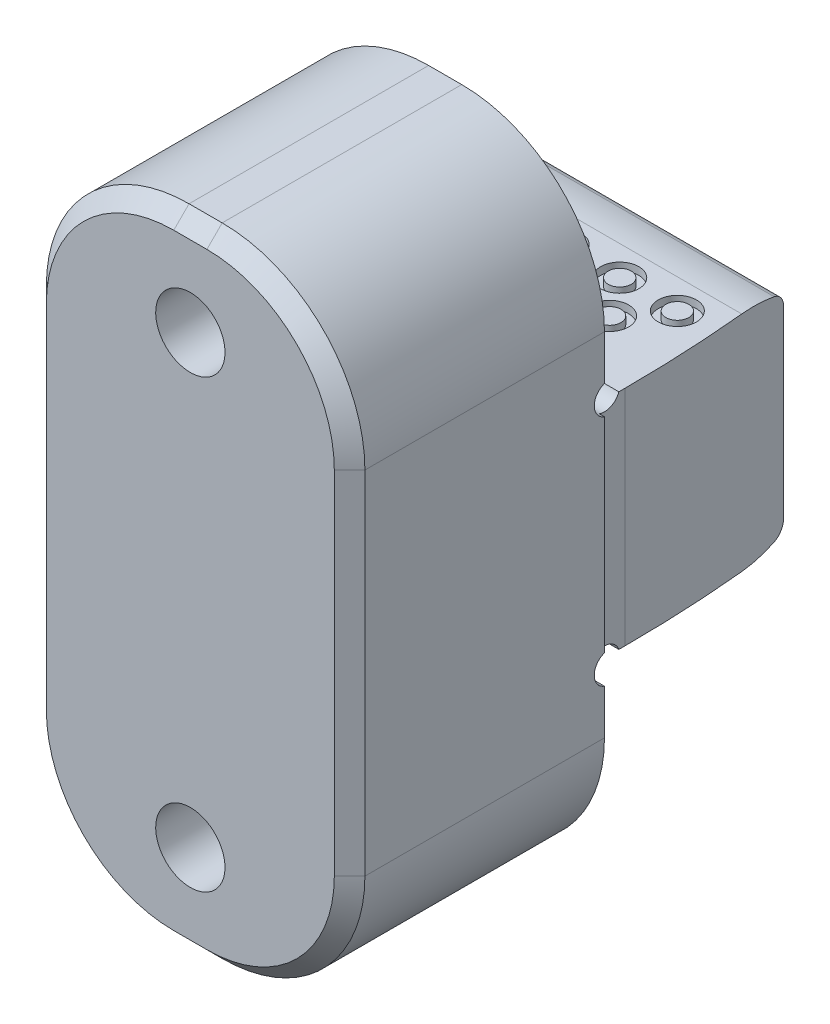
ISO-10303-21;
HEADER;
FILE_DESCRIPTION(('STEP AP214'),'2;1');
FILE_NAME('part.step','',(''),(''),'','','');
FILE_SCHEMA(('AUTOMOTIVE_DESIGN { 1 0 10303 214 1 1 1 1 }'));
ENDSEC;
DATA;
#1=APPLICATION_CONTEXT('core data for automotive mechanical design processes');
#2=APPLICATION_PROTOCOL_DEFINITION('international standard','automotive_design',2000,#1);
#3=PRODUCT_CONTEXT('',#1,'mechanical');
#4=PRODUCT('Part','Part','',(#3));
#5=PRODUCT_RELATED_PRODUCT_CATEGORY('part','',(#4));
#6=PRODUCT_DEFINITION_FORMATION('','',#4);
#7=PRODUCT_DEFINITION_CONTEXT('part definition',#1,'design');
#8=PRODUCT_DEFINITION('design','',#6,#7);
#9=PRODUCT_DEFINITION_SHAPE('','',#8);
#10=(LENGTH_UNIT() NAMED_UNIT(*) SI_UNIT(.MILLI.,.METRE.));
#11=(NAMED_UNIT(*) PLANE_ANGLE_UNIT() SI_UNIT($,.RADIAN.));
#12=(NAMED_UNIT(*) SI_UNIT($,.STERADIAN.) SOLID_ANGLE_UNIT());
#13=UNCERTAINTY_MEASURE_WITH_UNIT(LENGTH_MEASURE(1.E-05),#10,'distance_accuracy_value','');
#14=(GEOMETRIC_REPRESENTATION_CONTEXT(3) GLOBAL_UNCERTAINTY_ASSIGNED_CONTEXT((#13)) GLOBAL_UNIT_ASSIGNED_CONTEXT((#10,
#11,#12)) REPRESENTATION_CONTEXT('',''));
#15=CARTESIAN_POINT('',(0.,0.,0.));
#16=DIRECTION('',(0.,0.,1.));
#17=DIRECTION('',(1.,0.,0.));
#18=AXIS2_PLACEMENT_3D('',#15,#16,#17);
#19=CARTESIAN_POINT('',(1.651,11.1125,4.30022));
#20=DIRECTION('',(0.,0.,1.));
#21=DIRECTION('',(0.,-1.,0.));
#22=AXIS2_PLACEMENT_3D('',#19,#20,#21);
#23=PLANE('',#22);
#24=CARTESIAN_POINT('',(0.,11.1125,4.30022));
#25=DIRECTION('',(0.,0.,-1.));
#26=DIRECTION('',(0.,1.,0.));
#27=AXIS2_PLACEMENT_3D('',#24,#25,#26);
#28=CIRCLE('',#27,3.57251);
#29=CARTESIAN_POINT('',(0.,14.68501,4.30022));
#30=VERTEX_POINT('',#29);
#31=EDGE_CURVE('E903',#30,#30,#28,.T.);
#32=ORIENTED_EDGE('',*,*,#31,.T.);
#33=EDGE_LOOP('',(#32));
#34=FACE_BOUND('',#33,.T.);
#35=CARTESIAN_POINT('',(0.,11.1125,4.30022));
#36=DIRECTION('',(0.,0.,-1.));
#37=DIRECTION('',(0.,1.,0.));
#38=AXIS2_PLACEMENT_3D('',#35,#36,#37);
#39=CIRCLE('',#38,1.72719999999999);
#40=CARTESIAN_POINT('',(0.,12.8397,4.30022));
#41=VERTEX_POINT('',#40);
#42=EDGE_CURVE('E918',#41,#41,#39,.T.);
#43=ORIENTED_EDGE('',*,*,#42,.F.);
#44=EDGE_LOOP('',(#43));
#45=FACE_BOUND('',#44,.T.);
#46=ADVANCED_FACE('F33',(#34,#45),#23,.F.);
#47=CARTESIAN_POINT('',(7.9375,-5.56006,-9.7536));
#48=DIRECTION('',(0.,0.,1.));
#49=DIRECTION('',(1.,0.,0.));
#50=AXIS2_PLACEMENT_3D('',#47,#48,#49);
#51=PLANE('',#50);
#52=DIRECTION('',(1.,0.,0.));
#53=VECTOR('',#52,1.);
#54=CARTESIAN_POINT('',(-7.9375,4.5640401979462,-9.7536));
#55=LINE('',#54,#53);
#56=CARTESIAN_POINT('',(-7.6835,4.5640401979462,-9.7536));
#57=VERTEX_POINT('',#56);
#58=CARTESIAN_POINT('',(7.11424392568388,4.5640401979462,-9.7536));
#59=VERTEX_POINT('',#58);
#60=EDGE_CURVE('E1084',#57,#59,#55,.T.);
#61=ORIENTED_EDGE('',*,*,#60,.T.);
#62=DIRECTION('',(0.,1.,0.));
#63=VECTOR('',#62,1.);
#64=CARTESIAN_POINT('',(7.11424392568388,-15.875,-9.7536));
#65=LINE('',#64,#63);
#66=CARTESIAN_POINT('',(7.11424392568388,-4.5640401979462,-9.7536));
#67=VERTEX_POINT('',#66);
#68=EDGE_CURVE('E234',#59,#67,#65,.F.);
#69=ORIENTED_EDGE('',*,*,#68,.T.);
#70=DIRECTION('',(1.,0.,0.));
#71=VECTOR('',#70,1.);
#72=CARTESIAN_POINT('',(-7.9375,-4.5640401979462,-9.7536));
#73=LINE('',#72,#71);
#74=CARTESIAN_POINT('',(-7.6835,-4.5640401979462,-9.7536));
#75=VERTEX_POINT('',#74);
#76=EDGE_CURVE('E1119',#75,#67,#73,.T.);
#77=ORIENTED_EDGE('',*,*,#76,.F.);
#78=DIRECTION('',(0.,1.,0.));
#79=VECTOR('',#78,1.);
#80=CARTESIAN_POINT('',(-7.6835,-5.56006,-9.7536));
#81=LINE('',#80,#79);
#82=EDGE_CURVE('E1073',#75,#57,#81,.T.);
#83=ORIENTED_EDGE('',*,*,#82,.T.);
#84=EDGE_LOOP('',(#61,#69,#77,#83));
#85=FACE_BOUND('',#84,.T.);
#86=ADVANCED_FACE('F369',(#85),#51,.F.);
#87=CARTESIAN_POINT('',(7.9375,15.875,0.));
#88=DIRECTION('',(0.,0.,1.));
#89=DIRECTION('',(0.,-1.,0.));
#90=AXIS2_PLACEMENT_3D('',#87,#88,#89);
#91=PLANE('',#90);
#92=CARTESIAN_POINT('',(0.,-11.1125,0.));
#93=DIRECTION('',(0.,0.,-1.));
#94=DIRECTION('',(0.,1.,0.));
#95=AXIS2_PLACEMENT_3D('',#92,#93,#94);
#96=CIRCLE('',#95,3.57251);
#97=CARTESIAN_POINT('',(0.,-7.53999,0.));
#98=VERTEX_POINT('',#97);
#99=EDGE_CURVE('E900',#98,#98,#96,.T.);
#100=ORIENTED_EDGE('',*,*,#99,.F.);
#101=EDGE_LOOP('',(#100));
#102=FACE_BOUND('',#101,.T.);
#103=DIRECTION('',(0.,1.,0.));
#104=VECTOR('',#103,1.);
#105=CARTESIAN_POINT('',(7.9375,-15.875,0.));
#106=LINE('',#105,#104);
#107=CARTESIAN_POINT('',(7.9375,-8.763,0.));
#108=VERTEX_POINT('',#107);
#109=CARTESIAN_POINT('',(7.9375,-6.53248048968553,0.));
#110=VERTEX_POINT('',#109);
#111=EDGE_CURVE('E251',#108,#110,#106,.T.);
#112=ORIENTED_EDGE('',*,*,#111,.F.);
#113=CARTESIAN_POINT('',(0.8255,-8.763,0.));
#114=DIRECTION('',(0.,0.,1.));
#115=DIRECTION('',(0.,-1.,0.));
#116=AXIS2_PLACEMENT_3D('',#113,#114,#115);
#117=CIRCLE('',#116,7.112);
#118=CARTESIAN_POINT('',(0.8255,-15.875,0.));
#119=VERTEX_POINT('',#118);
#120=EDGE_CURVE('E1016',#108,#119,#117,.F.);
#121=ORIENTED_EDGE('',*,*,#120,.T.);
#122=DIRECTION('',(-1.,0.,0.));
#123=VECTOR('',#122,1.);
#124=CARTESIAN_POINT('',(7.9375,-15.875,0.));
#125=LINE('',#124,#123);
#126=CARTESIAN_POINT('',(-0.8255,-15.875,0.));
#127=VERTEX_POINT('',#126);
#128=EDGE_CURVE('E258',#119,#127,#125,.T.);
#129=ORIENTED_EDGE('',*,*,#128,.T.);
#130=CARTESIAN_POINT('',(-0.8255,-8.763,0.));
#131=DIRECTION('',(0.,0.,1.));
#132=DIRECTION('',(0.,-1.,0.));
#133=AXIS2_PLACEMENT_3D('',#130,#131,#132);
#134=CIRCLE('',#133,7.112);
#135=CARTESIAN_POINT('',(-7.9375,-8.763,0.));
#136=VERTEX_POINT('',#135);
#137=EDGE_CURVE('E1018',#127,#136,#134,.F.);
#138=ORIENTED_EDGE('',*,*,#137,.T.);
#139=DIRECTION('',(0.,1.,0.));
#140=VECTOR('',#139,1.);
#141=CARTESIAN_POINT('',(-7.9375,15.875,0.));
#142=LINE('',#141,#140);
#143=CARTESIAN_POINT('',(-7.9375,-6.53248048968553,0.));
#144=VERTEX_POINT('',#143);
#145=EDGE_CURVE('E246',#136,#144,#142,.T.);
#146=ORIENTED_EDGE('',*,*,#145,.T.);
#147=DIRECTION('',(1.,0.,0.));
#148=VECTOR('',#147,1.);
#149=CARTESIAN_POINT('',(-7.9375,-6.53248048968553,0.));
#150=LINE('',#149,#148);
#151=EDGE_CURVE('E1040',#144,#110,#150,.T.);
#152=ORIENTED_EDGE('',*,*,#151,.T.);
#153=EDGE_LOOP('',(#112,#121,#129,#138,#146,#152));
#154=FACE_BOUND('',#153,.T.);
#155=ADVANCED_FACE('F363',(#102,#154),#91,.F.);
#156=CARTESIAN_POINT('',(7.9375,-5.09563951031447,0.));
#157=VERTEX_POINT('',#156);
#158=CARTESIAN_POINT('',(7.9375,5.09563951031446,0.));
#159=VERTEX_POINT('',#158);
#160=EDGE_CURVE('E253',#157,#159,#106,.T.);
#161=ORIENTED_EDGE('',*,*,#160,.F.);
#162=DIRECTION('',(1.,0.,0.));
#163=VECTOR('',#162,1.);
#164=CARTESIAN_POINT('',(-7.9375,-5.09563951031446,0.));
#165=LINE('',#164,#163);
#166=CARTESIAN_POINT('',(7.6835,-5.09563951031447,0.));
#167=VERTEX_POINT('',#166);
#168=EDGE_CURVE('E1043',#157,#167,#165,.F.);
#169=ORIENTED_EDGE('',*,*,#168,.T.);
#170=DIRECTION('',(0.,-1.,0.));
#171=VECTOR('',#170,1.);
#172=CARTESIAN_POINT('',(7.6835,-14.5525814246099,0.));
#173=LINE('',#172,#171);
#174=CARTESIAN_POINT('',(7.6835,5.09563951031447,0.));
#175=VERTEX_POINT('',#174);
#176=EDGE_CURVE('E247',#175,#167,#173,.T.);
#177=ORIENTED_EDGE('',*,*,#176,.F.);
#178=DIRECTION('',(1.,0.,0.));
#179=VECTOR('',#178,1.);
#180=CARTESIAN_POINT('',(-7.9375,5.09563951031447,0.));
#181=LINE('',#180,#179);
#182=EDGE_CURVE('E1059',#175,#159,#181,.T.);
#183=ORIENTED_EDGE('',*,*,#182,.T.);
#184=EDGE_LOOP('',(#161,#169,#177,#183));
#185=FACE_BOUND('',#184,.T.);
#186=ADVANCED_FACE('F1080',(#185),#91,.F.);
#187=DIRECTION('',(0.,-1.,0.));
#188=VECTOR('',#187,1.);
#189=CARTESIAN_POINT('',(-7.6835,-14.5525814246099,0.));
#190=LINE('',#189,#188);
#191=CARTESIAN_POINT('',(-7.6835,5.09563951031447,0.));
#192=VERTEX_POINT('',#191);
#193=CARTESIAN_POINT('',(-7.6835,-5.09563951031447,0.));
#194=VERTEX_POINT('',#193);
#195=EDGE_CURVE('E1068',#192,#194,#190,.T.);
#196=ORIENTED_EDGE('',*,*,#195,.T.);
#197=CARTESIAN_POINT('',(-7.9375,-5.09563951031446,0.));
#198=VERTEX_POINT('',#197);
#199=EDGE_CURVE('E1050',#194,#198,#165,.F.);
#200=ORIENTED_EDGE('',*,*,#199,.T.);
#201=CARTESIAN_POINT('',(-7.9375,5.09563951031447,0.));
#202=VERTEX_POINT('',#201);
#203=EDGE_CURVE('E244',#198,#202,#142,.T.);
#204=ORIENTED_EDGE('',*,*,#203,.T.);
#205=EDGE_CURVE('E1054',#202,#192,#181,.T.);
#206=ORIENTED_EDGE('',*,*,#205,.T.);
#207=EDGE_LOOP('',(#196,#200,#204,#206));
#208=FACE_BOUND('',#207,.T.);
#209=ADVANCED_FACE('F353',(#208),#91,.F.);
#210=CARTESIAN_POINT('',(-7.9375,15.875,12.7));
#211=DIRECTION('',(-1.,0.,0.));
#212=DIRECTION('',(0.,0.,1.));
#213=AXIS2_PLACEMENT_3D('',#210,#211,#212);
#214=PLANE('',#213);
#215=DIRECTION('',(0.,0.,-1.));
#216=VECTOR('',#215,1.);
#217=CARTESIAN_POINT('',(-7.9375,-8.763,12.7));
#218=LINE('',#217,#216);
#219=CARTESIAN_POINT('',(-7.9375,-8.763,11.938));
#220=VERTEX_POINT('',#219);
#221=EDGE_CURVE('E1001',#136,#220,#218,.F.);
#222=ORIENTED_EDGE('',*,*,#221,.T.);
#223=DIRECTION('',(0.,1.,0.));
#224=VECTOR('',#223,1.);
#225=CARTESIAN_POINT('',(-7.9375,8.763,11.938));
#226=LINE('',#225,#224);
#227=CARTESIAN_POINT('',(-7.9375,8.763,11.938));
#228=VERTEX_POINT('',#227);
#229=EDGE_CURVE('E982',#220,#228,#226,.T.);
#230=ORIENTED_EDGE('',*,*,#229,.T.);
#231=DIRECTION('',(0.,0.,1.));
#232=VECTOR('',#231,1.);
#233=CARTESIAN_POINT('',(-7.9375,8.763,0.));
#234=LINE('',#233,#232);
#235=CARTESIAN_POINT('',(-7.9375,8.763,0.));
#236=VERTEX_POINT('',#235);
#237=EDGE_CURVE('E999',#228,#236,#234,.F.);
#238=ORIENTED_EDGE('',*,*,#237,.T.);
#239=CARTESIAN_POINT('',(-7.9375,6.53248048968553,0.));
#240=VERTEX_POINT('',#239);
#241=EDGE_CURVE('E240',#240,#236,#142,.T.);
#242=ORIENTED_EDGE('',*,*,#241,.F.);
#243=CARTESIAN_POINT('',(-7.9375,5.81406,-0.253999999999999));
#244=DIRECTION('',(1.,0.,0.));
#245=DIRECTION('',(0.,0.,-1.));
#246=AXIS2_PLACEMENT_3D('',#243,#244,#245);
#247=CIRCLE('',#246,0.762);
#248=EDGE_CURVE('E1046',#240,#202,#247,.T.);
#249=ORIENTED_EDGE('',*,*,#248,.T.);
#250=ORIENTED_EDGE('',*,*,#203,.F.);
#251=CARTESIAN_POINT('',(-7.9375,-5.81406,-0.253999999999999));
#252=DIRECTION('',(1.,0.,0.));
#253=DIRECTION('',(0.,0.,1.));
#254=AXIS2_PLACEMENT_3D('',#251,#252,#253);
#255=CIRCLE('',#254,0.762);
#256=EDGE_CURVE('E1083',#198,#144,#255,.T.);
#257=ORIENTED_EDGE('',*,*,#256,.T.);
#258=ORIENTED_EDGE('',*,*,#145,.F.);
#259=EDGE_LOOP('',(#222,#230,#238,#242,#249,#250,#257,#258));
#260=FACE_BOUND('',#259,.T.);
#261=ADVANCED_FACE('F349',(#260),#214,.T.);
#262=CARTESIAN_POINT('',(7.9375,-15.875,12.7));
#263=DIRECTION('',(0.,0.,-1.));
#264=DIRECTION('',(-1.,0.,0.));
#265=AXIS2_PLACEMENT_3D('',#262,#263,#264);
#266=PLANE('',#265);
#267=CARTESIAN_POINT('',(0.,11.1125,12.7));
#268=DIRECTION('',(0.,0.,-1.));
#269=DIRECTION('',(0.,1.,0.));
#270=AXIS2_PLACEMENT_3D('',#267,#268,#269);
#271=CIRCLE('',#270,1.7272);
#272=CARTESIAN_POINT('',(0.,12.8397,12.7));
#273=VERTEX_POINT('',#272);
#274=EDGE_CURVE('E915',#273,#273,#271,.T.);
#275=ORIENTED_EDGE('',*,*,#274,.T.);
#276=EDGE_LOOP('',(#275));
#277=FACE_BOUND('',#276,.T.);
#278=CARTESIAN_POINT('',(0.,-11.1125,12.7));
#279=DIRECTION('',(0.,0.,-1.));
#280=DIRECTION('',(0.,1.,0.));
#281=AXIS2_PLACEMENT_3D('',#278,#279,#280);
#282=CIRCLE('',#281,1.7272);
#283=CARTESIAN_POINT('',(0.,-9.3853,12.7));
#284=VERTEX_POINT('',#283);
#285=EDGE_CURVE('E908',#284,#284,#282,.T.);
#286=ORIENTED_EDGE('',*,*,#285,.T.);
#287=EDGE_LOOP('',(#286));
#288=FACE_BOUND('',#287,.T.);
#289=CARTESIAN_POINT('',(0.8255,-8.763,12.7));
#290=DIRECTION('',(0.,0.,-1.));
#291=DIRECTION('',(-1.,0.,0.));
#292=AXIS2_PLACEMENT_3D('',#289,#290,#291);
#293=CIRCLE('',#292,6.35000000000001);
#294=CARTESIAN_POINT('',(0.8255,-15.113,12.7));
#295=VERTEX_POINT('',#294);
#296=CARTESIAN_POINT('',(7.17550000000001,-8.763,12.7));
#297=VERTEX_POINT('',#296);
#298=EDGE_CURVE('E936',#295,#297,#293,.F.);
#299=ORIENTED_EDGE('',*,*,#298,.T.);
#300=DIRECTION('',(0.,1.,0.));
#301=VECTOR('',#300,1.);
#302=CARTESIAN_POINT('',(7.1755,-15.875,12.7));
#303=LINE('',#302,#301);
#304=CARTESIAN_POINT('',(7.17550000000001,8.763,12.7));
#305=VERTEX_POINT('',#304);
#306=EDGE_CURVE('E938',#297,#305,#303,.T.);
#307=ORIENTED_EDGE('',*,*,#306,.T.);
#308=CARTESIAN_POINT('',(0.8255,8.763,12.7));
#309=DIRECTION('',(0.,0.,-1.));
#310=DIRECTION('',(-1.,0.,0.));
#311=AXIS2_PLACEMENT_3D('',#308,#309,#310);
#312=CIRCLE('',#311,6.35000000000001);
#313=CARTESIAN_POINT('',(0.8255,15.113,12.7));
#314=VERTEX_POINT('',#313);
#315=EDGE_CURVE('E944',#305,#314,#312,.F.);
#316=ORIENTED_EDGE('',*,*,#315,.T.);
#317=DIRECTION('',(-1.,0.,0.));
#318=VECTOR('',#317,1.);
#319=CARTESIAN_POINT('',(7.9375,15.113,12.7));
#320=LINE('',#319,#318);
#321=CARTESIAN_POINT('',(-0.8255,15.113,12.7));
#322=VERTEX_POINT('',#321);
#323=EDGE_CURVE('E945',#314,#322,#320,.T.);
#324=ORIENTED_EDGE('',*,*,#323,.T.);
#325=CARTESIAN_POINT('',(-0.8255,8.763,12.7));
#326=DIRECTION('',(0.,0.,-1.));
#327=DIRECTION('',(-1.,0.,0.));
#328=AXIS2_PLACEMENT_3D('',#325,#326,#327);
#329=CIRCLE('',#328,6.35000000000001);
#330=CARTESIAN_POINT('',(-7.17550000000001,8.763,12.7));
#331=VERTEX_POINT('',#330);
#332=EDGE_CURVE('E978',#322,#331,#329,.F.);
#333=ORIENTED_EDGE('',*,*,#332,.T.);
#334=DIRECTION('',(0.,-1.,0.));
#335=VECTOR('',#334,1.);
#336=CARTESIAN_POINT('',(-7.17550000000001,-8.763,12.7));
#337=LINE('',#336,#335);
#338=CARTESIAN_POINT('',(-7.17550000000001,-8.763,12.7));
#339=VERTEX_POINT('',#338);
#340=EDGE_CURVE('E983',#331,#339,#337,.T.);
#341=ORIENTED_EDGE('',*,*,#340,.T.);
#342=CARTESIAN_POINT('',(-0.8255,-8.763,12.7));
#343=DIRECTION('',(0.,0.,-1.));
#344=DIRECTION('',(-1.,0.,0.));
#345=AXIS2_PLACEMENT_3D('',#342,#343,#344);
#346=CIRCLE('',#345,6.35000000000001);
#347=CARTESIAN_POINT('',(-0.8255,-15.113,12.7));
#348=VERTEX_POINT('',#347);
#349=EDGE_CURVE('E986',#339,#348,#346,.F.);
#350=ORIENTED_EDGE('',*,*,#349,.T.);
#351=DIRECTION('',(1.,0.,0.));
#352=VECTOR('',#351,1.);
#353=CARTESIAN_POINT('',(7.9375,-15.113,12.7));
#354=LINE('',#353,#352);
#355=EDGE_CURVE('E940',#348,#295,#354,.T.);
#356=ORIENTED_EDGE('',*,*,#355,.T.);
#357=EDGE_LOOP('',(#299,#307,#316,#324,#333,#341,#350,#356));
#358=FACE_BOUND('',#357,.T.);
#359=ADVANCED_FACE('F352',(#277,#288,#358),#266,.F.);
#360=CARTESIAN_POINT('',(7.9375,-15.875,12.7));
#361=DIRECTION('',(0.,1.,0.));
#362=DIRECTION('',(0.,0.,1.));
#363=AXIS2_PLACEMENT_3D('',#360,#361,#362);
#364=PLANE('',#363);
#365=DIRECTION('',(0.,0.,-1.));
#366=VECTOR('',#365,1.);
#367=CARTESIAN_POINT('',(0.8255,-15.875,12.7));
#368=LINE('',#367,#366);
#369=CARTESIAN_POINT('',(0.8255,-15.875,11.938));
#370=VERTEX_POINT('',#369);
#371=EDGE_CURVE('E1009',#119,#370,#368,.F.);
#372=ORIENTED_EDGE('',*,*,#371,.T.);
#373=DIRECTION('',(-1.,0.,0.));
#374=VECTOR('',#373,1.);
#375=CARTESIAN_POINT('',(7.9375,-15.875,11.938));
#376=LINE('',#375,#374);
#377=CARTESIAN_POINT('',(-0.8255,-15.875,11.938));
#378=VERTEX_POINT('',#377);
#379=EDGE_CURVE('E42',#370,#378,#376,.T.);
#380=ORIENTED_EDGE('',*,*,#379,.T.);
#381=DIRECTION('',(0.,0.,-1.));
#382=VECTOR('',#381,1.);
#383=CARTESIAN_POINT('',(-0.8255,-15.875,0.));
#384=LINE('',#383,#382);
#385=EDGE_CURVE('E1014',#378,#127,#384,.T.);
#386=ORIENTED_EDGE('',*,*,#385,.T.);
#387=ORIENTED_EDGE('',*,*,#128,.F.);
#388=EDGE_LOOP('',(#372,#380,#386,#387));
#389=FACE_BOUND('',#388,.T.);
#390=ADVANCED_FACE('F375',(#389),#364,.F.);
#391=CARTESIAN_POINT('',(7.9375,-5.56006,0.));
#392=DIRECTION('',(0.,1.,0.));
#393=DIRECTION('',(0.,0.,1.));
#394=AXIS2_PLACEMENT_3D('',#391,#392,#393);
#395=PLANE('',#394);
#396=CARTESIAN_POINT('',(-4.4323,-5.56006,-4.0132));
#397=DIRECTION('',(0.,1.,0.));
#398=DIRECTION('',(0.,0.,1.));
#399=AXIS2_PLACEMENT_3D('',#396,#397,#398);
#400=CIRCLE('',#399,0.9525);
#401=CARTESIAN_POINT('',(-4.4323,-5.56006,-4.9657));
#402=VERTEX_POINT('',#401);
#403=EDGE_CURVE('E886',#402,#402,#400,.T.);
#404=ORIENTED_EDGE('',*,*,#403,.T.);
#405=EDGE_LOOP('',(#404));
#406=FACE_BOUND('',#405,.T.);
#407=CARTESIAN_POINT('',(4.1783,-5.56006,-4.0132));
#408=DIRECTION('',(0.,1.,0.));
#409=DIRECTION('',(0.,0.,1.));
#410=AXIS2_PLACEMENT_3D('',#407,#408,#409);
#411=CIRCLE('',#410,0.9525);
#412=CARTESIAN_POINT('',(4.1783,-5.56006,-4.9657));
#413=VERTEX_POINT('',#412);
#414=EDGE_CURVE('E874',#413,#413,#411,.T.);
#415=ORIENTED_EDGE('',*,*,#414,.T.);
#416=EDGE_LOOP('',(#415));
#417=FACE_BOUND('',#416,.T.);
#418=CARTESIAN_POINT('',(1.3081,-5.56006,-4.0132));
#419=DIRECTION('',(0.,1.,0.));
#420=DIRECTION('',(0.,0.,1.));
#421=AXIS2_PLACEMENT_3D('',#418,#419,#420);
#422=CIRCLE('',#421,0.952499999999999);
#423=CARTESIAN_POINT('',(1.3081,-5.56006,-4.9657));
#424=VERTEX_POINT('',#423);
#425=EDGE_CURVE('E862',#424,#424,#422,.T.);
#426=ORIENTED_EDGE('',*,*,#425,.T.);
#427=EDGE_LOOP('',(#426));
#428=FACE_BOUND('',#427,.T.);
#429=CARTESIAN_POINT('',(-1.5621,-5.56006,-4.0132));
#430=DIRECTION('',(0.,1.,0.));
#431=DIRECTION('',(0.,0.,1.));
#432=AXIS2_PLACEMENT_3D('',#429,#430,#431);
#433=CIRCLE('',#432,0.9525);
#434=CARTESIAN_POINT('',(-1.5621,-5.56006,-4.9657));
#435=VERTEX_POINT('',#434);
#436=EDGE_CURVE('E850',#435,#435,#433,.T.);
#437=ORIENTED_EDGE('',*,*,#436,.T.);
#438=EDGE_LOOP('',(#437));
#439=FACE_BOUND('',#438,.T.);
#440=CARTESIAN_POINT('',(5.6515,-5.56006,-5.9182));
#441=DIRECTION('',(0.,1.,0.));
#442=DIRECTION('',(0.,0.,1.));
#443=AXIS2_PLACEMENT_3D('',#440,#441,#442);
#444=CIRCLE('',#443,0.9525);
#445=CARTESIAN_POINT('',(5.6515,-5.56006,-6.8707));
#446=VERTEX_POINT('',#445);
#447=EDGE_CURVE('E838',#446,#446,#444,.T.);
#448=ORIENTED_EDGE('',*,*,#447,.T.);
#449=EDGE_LOOP('',(#448));
#450=FACE_BOUND('',#449,.T.);
#451=CARTESIAN_POINT('',(-5.8293,-5.56006,-5.9182));
#452=DIRECTION('',(0.,1.,0.));
#453=DIRECTION('',(0.,0.,1.));
#454=AXIS2_PLACEMENT_3D('',#451,#452,#453);
#455=CIRCLE('',#454,0.9525);
#456=CARTESIAN_POINT('',(-5.8293,-5.56006,-6.8707));
#457=VERTEX_POINT('',#456);
#458=EDGE_CURVE('E826',#457,#457,#455,.T.);
#459=ORIENTED_EDGE('',*,*,#458,.T.);
#460=EDGE_LOOP('',(#459));
#461=FACE_BOUND('',#460,.T.);
#462=CARTESIAN_POINT('',(2.7813,-5.56006,-5.9182));
#463=DIRECTION('',(0.,1.,0.));
#464=DIRECTION('',(0.,0.,1.));
#465=AXIS2_PLACEMENT_3D('',#462,#463,#464);
#466=CIRCLE('',#465,0.9525);
#467=CARTESIAN_POINT('',(2.7813,-5.56006,-6.8707));
#468=VERTEX_POINT('',#467);
#469=EDGE_CURVE('E814',#468,#468,#466,.T.);
#470=ORIENTED_EDGE('',*,*,#469,.T.);
#471=EDGE_LOOP('',(#470));
#472=FACE_BOUND('',#471,.T.);
#473=CARTESIAN_POINT('',(-0.0888999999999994,-5.56006,-5.9182));
#474=DIRECTION('',(0.,1.,0.));
#475=DIRECTION('',(0.,0.,1.));
#476=AXIS2_PLACEMENT_3D('',#473,#474,#475);
#477=CIRCLE('',#476,0.9525);
#478=CARTESIAN_POINT('',(-0.0888999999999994,-5.56006,-6.8707));
#479=VERTEX_POINT('',#478);
#480=EDGE_CURVE('E802',#479,#479,#477,.T.);
#481=ORIENTED_EDGE('',*,*,#480,.T.);
#482=EDGE_LOOP('',(#481));
#483=FACE_BOUND('',#482,.T.);
#484=CARTESIAN_POINT('',(-2.9591,-5.56006,-5.9182));
#485=DIRECTION('',(0.,1.,0.));
#486=DIRECTION('',(0.,0.,1.));
#487=AXIS2_PLACEMENT_3D('',#484,#485,#486);
#488=CIRCLE('',#487,0.9525);
#489=CARTESIAN_POINT('',(-2.9591,-5.56006,-6.8707));
#490=VERTEX_POINT('',#489);
#491=EDGE_CURVE('E790',#490,#490,#488,.T.);
#492=ORIENTED_EDGE('',*,*,#491,.T.);
#493=EDGE_LOOP('',(#492));
#494=FACE_BOUND('',#493,.T.);
#495=DIRECTION('',(1.,0.,0.));
#496=VECTOR('',#495,1.);
#497=CARTESIAN_POINT('',(-7.9375,-5.56006,-7.3914));
#498=LINE('',#497,#496);
#499=CARTESIAN_POINT('',(-7.6835,-5.56006,-7.3914));
#500=VERTEX_POINT('',#499);
#501=CARTESIAN_POINT('',(7.38775984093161,-5.56006,-7.3914));
#502=VERTEX_POINT('',#501);
#503=EDGE_CURVE('E233',#500,#502,#498,.T.);
#504=ORIENTED_EDGE('',*,*,#503,.T.);
#505=CARTESIAN_POINT('',(-55.8165,-5.56006,-1.27));
#506=DIRECTION('',(0.,1.,0.));
#507=DIRECTION('',(0.,0.,1.));
#508=AXIS2_PLACEMENT_3D('',#505,#506,#507);
#509=CIRCLE('',#508,63.5);
#510=CARTESIAN_POINT('',(7.6835,-5.56006,-1.27));
#511=VERTEX_POINT('',#510);
#512=EDGE_CURVE('E215',#502,#511,#509,.F.);
#513=ORIENTED_EDGE('',*,*,#512,.T.);
#514=DIRECTION('',(0.,0.,1.));
#515=VECTOR('',#514,1.);
#516=CARTESIAN_POINT('',(7.6835,-5.56006,0.));
#517=LINE('',#516,#515);
#518=CARTESIAN_POINT('',(7.6835,-5.56006,-0.972420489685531));
#519=VERTEX_POINT('',#518);
#520=EDGE_CURVE('E230',#511,#519,#517,.T.);
#521=ORIENTED_EDGE('',*,*,#520,.T.);
#522=DIRECTION('',(1.,0.,0.));
#523=VECTOR('',#522,1.);
#524=CARTESIAN_POINT('',(-7.9375,-5.56006,-0.972420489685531));
#525=LINE('',#524,#523);
#526=CARTESIAN_POINT('',(-7.6835,-5.56006,-0.972420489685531));
#527=VERTEX_POINT('',#526);
#528=EDGE_CURVE('E1086',#519,#527,#525,.F.);
#529=ORIENTED_EDGE('',*,*,#528,.T.);
#530=DIRECTION('',(0.,0.,-1.));
#531=VECTOR('',#530,1.);
#532=CARTESIAN_POINT('',(-7.6835,-5.56006,0.));
#533=LINE('',#532,#531);
#534=EDGE_CURVE('E1075',#527,#500,#533,.T.);
#535=ORIENTED_EDGE('',*,*,#534,.T.);
#536=EDGE_LOOP('',(#504,#513,#521,#529,#535));
#537=FACE_BOUND('',#536,.T.);
#538=ADVANCED_FACE('F228',(#406,#417,#428,#439,#450,#461,#472,#483,#494,#537),#395,.F.);
#539=CARTESIAN_POINT('',(7.9375,5.56006,0.));
#540=DIRECTION('',(0.,-1.,0.));
#541=DIRECTION('',(0.,0.,-1.));
#542=AXIS2_PLACEMENT_3D('',#539,#540,#541);
#543=PLANE('',#542);
#544=CARTESIAN_POINT('',(-4.4323,5.56006,-4.0132));
#545=DIRECTION('',(0.,1.,0.));
#546=DIRECTION('',(0.,0.,1.));
#547=AXIS2_PLACEMENT_3D('',#544,#545,#546);
#548=CIRCLE('',#547,0.9525);
#549=CARTESIAN_POINT('',(-4.4323,5.56006,-3.0607));
#550=VERTEX_POINT('',#549);
#551=EDGE_CURVE('E778',#550,#550,#548,.T.);
#552=ORIENTED_EDGE('',*,*,#551,.F.);
#553=EDGE_LOOP('',(#552));
#554=FACE_BOUND('',#553,.T.);
#555=CARTESIAN_POINT('',(4.1783,5.56006,-4.0132));
#556=DIRECTION('',(0.,1.,0.));
#557=DIRECTION('',(0.,0.,1.));
#558=AXIS2_PLACEMENT_3D('',#555,#556,#557);
#559=CIRCLE('',#558,0.9525);
#560=CARTESIAN_POINT('',(4.1783,5.56006,-3.0607));
#561=VERTEX_POINT('',#560);
#562=EDGE_CURVE('E766',#561,#561,#559,.T.);
#563=ORIENTED_EDGE('',*,*,#562,.F.);
#564=EDGE_LOOP('',(#563));
#565=FACE_BOUND('',#564,.T.);
#566=CARTESIAN_POINT('',(1.3081,5.56006,-4.0132));
#567=DIRECTION('',(0.,1.,0.));
#568=DIRECTION('',(0.,0.,1.));
#569=AXIS2_PLACEMENT_3D('',#566,#567,#568);
#570=CIRCLE('',#569,0.952499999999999);
#571=CARTESIAN_POINT('',(1.3081,5.56006,-3.0607));
#572=VERTEX_POINT('',#571);
#573=EDGE_CURVE('E754',#572,#572,#570,.T.);
#574=ORIENTED_EDGE('',*,*,#573,.F.);
#575=EDGE_LOOP('',(#574));
#576=FACE_BOUND('',#575,.T.);
#577=CARTESIAN_POINT('',(-1.5621,5.56006,-4.0132));
#578=DIRECTION('',(0.,1.,0.));
#579=DIRECTION('',(0.,0.,1.));
#580=AXIS2_PLACEMENT_3D('',#577,#578,#579);
#581=CIRCLE('',#580,0.9525);
#582=CARTESIAN_POINT('',(-1.5621,5.56006,-3.0607));
#583=VERTEX_POINT('',#582);
#584=EDGE_CURVE('E742',#583,#583,#581,.T.);
#585=ORIENTED_EDGE('',*,*,#584,.F.);
#586=EDGE_LOOP('',(#585));
#587=FACE_BOUND('',#586,.T.);
#588=CARTESIAN_POINT('',(5.6515,5.56006,-5.9182));
#589=DIRECTION('',(0.,1.,0.));
#590=DIRECTION('',(0.,0.,1.));
#591=AXIS2_PLACEMENT_3D('',#588,#589,#590);
#592=CIRCLE('',#591,0.9525);
#593=CARTESIAN_POINT('',(5.6515,5.56006,-4.9657));
#594=VERTEX_POINT('',#593);
#595=EDGE_CURVE('E730',#594,#594,#592,.T.);
#596=ORIENTED_EDGE('',*,*,#595,.F.);
#597=EDGE_LOOP('',(#596));
#598=FACE_BOUND('',#597,.T.);
#599=CARTESIAN_POINT('',(-5.8293,5.56006,-5.9182));
#600=DIRECTION('',(0.,1.,0.));
#601=DIRECTION('',(0.,0.,1.));
#602=AXIS2_PLACEMENT_3D('',#599,#600,#601);
#603=CIRCLE('',#602,0.9525);
#604=CARTESIAN_POINT('',(-5.8293,5.56006,-4.9657));
#605=VERTEX_POINT('',#604);
#606=EDGE_CURVE('E718',#605,#605,#603,.T.);
#607=ORIENTED_EDGE('',*,*,#606,.F.);
#608=EDGE_LOOP('',(#607));
#609=FACE_BOUND('',#608,.T.);
#610=CARTESIAN_POINT('',(2.7813,5.56006,-5.9182));
#611=DIRECTION('',(0.,1.,0.));
#612=DIRECTION('',(0.,0.,1.));
#613=AXIS2_PLACEMENT_3D('',#610,#611,#612);
#614=CIRCLE('',#613,0.9525);
#615=CARTESIAN_POINT('',(2.7813,5.56006,-4.9657));
#616=VERTEX_POINT('',#615);
#617=EDGE_CURVE('E706',#616,#616,#614,.T.);
#618=ORIENTED_EDGE('',*,*,#617,.F.);
#619=EDGE_LOOP('',(#618));
#620=FACE_BOUND('',#619,.T.);
#621=CARTESIAN_POINT('',(-0.0888999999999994,5.56006,-5.9182));
#622=DIRECTION('',(0.,1.,0.));
#623=DIRECTION('',(0.,0.,1.));
#624=AXIS2_PLACEMENT_3D('',#621,#622,#623);
#625=CIRCLE('',#624,0.9525);
#626=CARTESIAN_POINT('',(-0.0888999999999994,5.56006,-4.9657));
#627=VERTEX_POINT('',#626);
#628=EDGE_CURVE('E694',#627,#627,#625,.T.);
#629=ORIENTED_EDGE('',*,*,#628,.F.);
#630=EDGE_LOOP('',(#629));
#631=FACE_BOUND('',#630,.T.);
#632=CARTESIAN_POINT('',(-2.9591,5.56006,-5.9182));
#633=DIRECTION('',(0.,1.,0.));
#634=DIRECTION('',(0.,0.,1.));
#635=AXIS2_PLACEMENT_3D('',#632,#633,#634);
#636=CIRCLE('',#635,0.9525);
#637=CARTESIAN_POINT('',(-2.9591,5.56006,-4.9657));
#638=VERTEX_POINT('',#637);
#639=EDGE_CURVE('E684',#638,#638,#636,.T.);
#640=ORIENTED_EDGE('',*,*,#639,.F.);
#641=EDGE_LOOP('',(#640));
#642=FACE_BOUND('',#641,.T.);
#643=DIRECTION('',(0.,0.,-1.));
#644=VECTOR('',#643,1.);
#645=CARTESIAN_POINT('',(7.6835,5.56006,0.));
#646=LINE('',#645,#644);
#647=CARTESIAN_POINT('',(7.6835,5.56006,-0.972420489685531));
#648=VERTEX_POINT('',#647);
#649=CARTESIAN_POINT('',(7.6835,5.56006,-1.27));
#650=VERTEX_POINT('',#649);
#651=EDGE_CURVE('E241',#648,#650,#646,.T.);
#652=ORIENTED_EDGE('',*,*,#651,.T.);
#653=CARTESIAN_POINT('',(-55.8165,5.56006,-1.27));
#654=DIRECTION('',(0.,-1.,0.));
#655=DIRECTION('',(0.,0.,-1.));
#656=AXIS2_PLACEMENT_3D('',#653,#654,#655);
#657=CIRCLE('',#656,63.5);
#658=CARTESIAN_POINT('',(7.38775984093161,5.56006,-7.3914));
#659=VERTEX_POINT('',#658);
#660=EDGE_CURVE('E218',#650,#659,#657,.F.);
#661=ORIENTED_EDGE('',*,*,#660,.T.);
#662=DIRECTION('',(1.,0.,0.));
#663=VECTOR('',#662,1.);
#664=CARTESIAN_POINT('',(-7.9375,5.56006,-7.3914));
#665=LINE('',#664,#663);
#666=CARTESIAN_POINT('',(-7.6835,5.56006,-7.3914));
#667=VERTEX_POINT('',#666);
#668=EDGE_CURVE('E1112',#667,#659,#665,.T.);
#669=ORIENTED_EDGE('',*,*,#668,.F.);
#670=DIRECTION('',(0.,0.,1.));
#671=VECTOR('',#670,1.);
#672=CARTESIAN_POINT('',(-7.6835,5.56006,0.));
#673=LINE('',#672,#671);
#674=CARTESIAN_POINT('',(-7.6835,5.56006,-0.972420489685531));
#675=VERTEX_POINT('',#674);
#676=EDGE_CURVE('E1071',#667,#675,#673,.T.);
#677=ORIENTED_EDGE('',*,*,#676,.T.);
#678=DIRECTION('',(1.,0.,0.));
#679=VECTOR('',#678,1.);
#680=CARTESIAN_POINT('',(-7.9375,5.56006,-0.972420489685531));
#681=LINE('',#680,#679);
#682=EDGE_CURVE('E1058',#675,#648,#681,.T.);
#683=ORIENTED_EDGE('',*,*,#682,.T.);
#684=EDGE_LOOP('',(#652,#661,#669,#677,#683));
#685=FACE_BOUND('',#684,.T.);
#686=ADVANCED_FACE('F361',(#554,#565,#576,#587,#598,#609,#620,#631,#642,#685),#543,.F.);
#687=CARTESIAN_POINT('',(0.,11.1125,0.));
#688=DIRECTION('',(0.,0.,-1.));
#689=DIRECTION('',(0.,1.,0.));
#690=AXIS2_PLACEMENT_3D('',#687,#688,#689);
#691=CIRCLE('',#690,3.57251);
#692=CARTESIAN_POINT('',(0.,14.68501,0.));
#693=VERTEX_POINT('',#692);
#694=EDGE_CURVE('E905',#693,#693,#691,.T.);
#695=ORIENTED_EDGE('',*,*,#694,.F.);
#696=EDGE_LOOP('',(#695));
#697=FACE_BOUND('',#696,.T.);
#698=DIRECTION('',(-1.,0.,0.));
#699=VECTOR('',#698,1.);
#700=CARTESIAN_POINT('',(7.9375,15.875,0.));
#701=LINE('',#700,#699);
#702=CARTESIAN_POINT('',(0.8255,15.875,0.));
#703=VERTEX_POINT('',#702);
#704=CARTESIAN_POINT('',(-0.8255,15.875,0.));
#705=VERTEX_POINT('',#704);
#706=EDGE_CURVE('E252',#703,#705,#701,.T.);
#707=ORIENTED_EDGE('',*,*,#706,.F.);
#708=CARTESIAN_POINT('',(0.8255,8.763,0.));
#709=DIRECTION('',(0.,0.,1.));
#710=DIRECTION('',(0.,-1.,0.));
#711=AXIS2_PLACEMENT_3D('',#708,#709,#710);
#712=CIRCLE('',#711,7.112);
#713=CARTESIAN_POINT('',(7.9375,8.763,0.));
#714=VERTEX_POINT('',#713);
#715=EDGE_CURVE('E1020',#703,#714,#712,.F.);
#716=ORIENTED_EDGE('',*,*,#715,.T.);
#717=CARTESIAN_POINT('',(7.9375,6.53248048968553,0.));
#718=VERTEX_POINT('',#717);
#719=EDGE_CURVE('E254',#718,#714,#106,.T.);
#720=ORIENTED_EDGE('',*,*,#719,.F.);
#721=DIRECTION('',(1.,0.,0.));
#722=VECTOR('',#721,1.);
#723=CARTESIAN_POINT('',(-7.9375,6.53248048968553,0.));
#724=LINE('',#723,#722);
#725=EDGE_CURVE('E1065',#718,#240,#724,.F.);
#726=ORIENTED_EDGE('',*,*,#725,.T.);
#727=ORIENTED_EDGE('',*,*,#241,.T.);
#728=CARTESIAN_POINT('',(-0.8255,8.763,0.));
#729=DIRECTION('',(0.,0.,1.));
#730=DIRECTION('',(0.,-1.,0.));
#731=AXIS2_PLACEMENT_3D('',#728,#729,#730);
#732=CIRCLE('',#731,7.112);
#733=EDGE_CURVE('E1005',#236,#705,#732,.F.);
#734=ORIENTED_EDGE('',*,*,#733,.T.);
#735=EDGE_LOOP('',(#707,#716,#720,#726,#727,#734));
#736=FACE_BOUND('',#735,.T.);
#737=ADVANCED_FACE('F357',(#697,#736),#91,.F.);
#738=CARTESIAN_POINT('',(7.9375,15.875,12.7));
#739=DIRECTION('',(0.,-1.,0.));
#740=DIRECTION('',(0.,0.,-1.));
#741=AXIS2_PLACEMENT_3D('',#738,#739,#740);
#742=PLANE('',#741);
#743=DIRECTION('',(0.,0.,1.));
#744=VECTOR('',#743,1.);
#745=CARTESIAN_POINT('',(-0.8255,15.875,12.7));
#746=LINE('',#745,#744);
#747=CARTESIAN_POINT('',(-0.8255,15.875,11.938));
#748=VERTEX_POINT('',#747);
#749=EDGE_CURVE('E1025',#705,#748,#746,.T.);
#750=ORIENTED_EDGE('',*,*,#749,.T.);
#751=DIRECTION('',(1.,0.,0.));
#752=VECTOR('',#751,1.);
#753=CARTESIAN_POINT('',(7.9375,15.875,11.938));
#754=LINE('',#753,#752);
#755=CARTESIAN_POINT('',(0.8255,15.875,11.938));
#756=VERTEX_POINT('',#755);
#757=EDGE_CURVE('E994',#748,#756,#754,.T.);
#758=ORIENTED_EDGE('',*,*,#757,.T.);
#759=DIRECTION('',(0.,0.,1.));
#760=VECTOR('',#759,1.);
#761=CARTESIAN_POINT('',(0.8255,15.875,12.7));
#762=LINE('',#761,#760);
#763=EDGE_CURVE('E1023',#756,#703,#762,.F.);
#764=ORIENTED_EDGE('',*,*,#763,.T.);
#765=ORIENTED_EDGE('',*,*,#706,.T.);
#766=EDGE_LOOP('',(#750,#758,#764,#765));
#767=FACE_BOUND('',#766,.T.);
#768=ADVANCED_FACE('F347',(#767),#742,.F.);
#769=CARTESIAN_POINT('',(7.9375,15.875,12.7));
#770=DIRECTION('',(-1.,0.,0.));
#771=DIRECTION('',(0.,0.,1.));
#772=AXIS2_PLACEMENT_3D('',#769,#770,#771);
#773=PLANE('',#772);
#774=DIRECTION('',(0.,0.,1.));
#775=VECTOR('',#774,1.);
#776=CARTESIAN_POINT('',(7.9375,8.763,12.7));
#777=LINE('',#776,#775);
#778=CARTESIAN_POINT('',(7.9375,8.763,11.938));
#779=VERTEX_POINT('',#778);
#780=EDGE_CURVE('E1026',#714,#779,#777,.T.);
#781=ORIENTED_EDGE('',*,*,#780,.T.);
#782=DIRECTION('',(0.,-1.,0.));
#783=VECTOR('',#782,1.);
#784=CARTESIAN_POINT('',(7.9375,15.875,11.938));
#785=LINE('',#784,#783);
#786=CARTESIAN_POINT('',(7.9375,-8.763,11.938));
#787=VERTEX_POINT('',#786);
#788=EDGE_CURVE('E1006',#779,#787,#785,.T.);
#789=ORIENTED_EDGE('',*,*,#788,.T.);
#790=DIRECTION('',(0.,0.,-1.));
#791=VECTOR('',#790,1.);
#792=CARTESIAN_POINT('',(7.9375,-8.763,12.7));
#793=LINE('',#792,#791);
#794=EDGE_CURVE('E287',#787,#108,#793,.T.);
#795=ORIENTED_EDGE('',*,*,#794,.T.);
#796=ORIENTED_EDGE('',*,*,#111,.T.);
#797=CARTESIAN_POINT('',(7.9375,-5.81406,-0.253999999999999));
#798=DIRECTION('',(1.,0.,0.));
#799=DIRECTION('',(0.,0.,1.));
#800=AXIS2_PLACEMENT_3D('',#797,#798,#799);
#801=CIRCLE('',#800,0.762);
#802=EDGE_CURVE('E1081',#157,#110,#801,.T.);
#803=ORIENTED_EDGE('',*,*,#802,.F.);
#804=ORIENTED_EDGE('',*,*,#160,.T.);
#805=CARTESIAN_POINT('',(7.9375,5.81406,-0.253999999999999));
#806=DIRECTION('',(1.,0.,0.));
#807=DIRECTION('',(0.,0.,-1.));
#808=AXIS2_PLACEMENT_3D('',#805,#806,#807);
#809=CIRCLE('',#808,0.762);
#810=EDGE_CURVE('E1042',#718,#159,#809,.T.);
#811=ORIENTED_EDGE('',*,*,#810,.F.);
#812=ORIENTED_EDGE('',*,*,#719,.T.);
#813=EDGE_LOOP('',(#781,#789,#795,#796,#803,#804,#811,#812));
#814=FACE_BOUND('',#813,.T.);
#815=ADVANCED_FACE('F344',(#814),#773,.F.);
#816=CARTESIAN_POINT('',(7.6835,17.1682519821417,0.));
#817=DIRECTION('',(-1.,0.,0.));
#818=DIRECTION('',(0.,0.,1.));
#819=AXIS2_PLACEMENT_3D('',#816,#817,#818);
#820=PLANE('',#819);
#821=ORIENTED_EDGE('',*,*,#520,.F.);
#822=DIRECTION('',(0.,1.,0.));
#823=VECTOR('',#822,1.);
#824=CARTESIAN_POINT('',(7.6835,-15.875,-1.27));
#825=LINE('',#824,#823);
#826=EDGE_CURVE('E212',#511,#650,#825,.T.);
#827=ORIENTED_EDGE('',*,*,#826,.T.);
#828=ORIENTED_EDGE('',*,*,#651,.F.);
#829=CARTESIAN_POINT('',(7.6835,5.81406,-0.253999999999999));
#830=DIRECTION('',(-1.,0.,0.));
#831=DIRECTION('',(0.,0.,1.));
#832=AXIS2_PLACEMENT_3D('',#829,#830,#831);
#833=CIRCLE('',#832,0.762);
#834=EDGE_CURVE('E1062',#648,#175,#833,.T.);
#835=ORIENTED_EDGE('',*,*,#834,.T.);
#836=ORIENTED_EDGE('',*,*,#176,.T.);
#837=CARTESIAN_POINT('',(7.6835,-5.81406,-0.253999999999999));
#838=DIRECTION('',(-1.,0.,0.));
#839=DIRECTION('',(0.,0.,1.));
#840=AXIS2_PLACEMENT_3D('',#837,#838,#839);
#841=CIRCLE('',#840,0.762);
#842=EDGE_CURVE('E239',#167,#519,#841,.T.);
#843=ORIENTED_EDGE('',*,*,#842,.T.);
#844=EDGE_LOOP('',(#821,#827,#828,#835,#836,#843));
#845=FACE_BOUND('',#844,.T.);
#846=ADVANCED_FACE('F237',(#845),#820,.F.);
#847=CARTESIAN_POINT('',(-7.6835,17.1682519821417,0.));
#848=DIRECTION('',(1.,0.,0.));
#849=DIRECTION('',(0.,0.,1.));
#850=AXIS2_PLACEMENT_3D('',#847,#848,#849);
#851=PLANE('',#850);
#852=CARTESIAN_POINT('',(-7.6835,-4.5640401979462,-8.9916));
#853=DIRECTION('',(1.,0.,0.));
#854=DIRECTION('',(0.,0.,-1.));
#855=AXIS2_PLACEMENT_3D('',#852,#853,#854);
#856=CIRCLE('',#855,0.761999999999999);
#857=CARTESIAN_POINT('',(-7.6835,-5.29412840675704,-9.20980909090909));
#858=VERTEX_POINT('',#857);
#859=EDGE_CURVE('E273',#75,#858,#856,.F.);
#860=ORIENTED_EDGE('',*,*,#859,.T.);
#861=CARTESIAN_POINT('',(-7.6835,0.789939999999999,-7.3914));
#862=DIRECTION('',(1.,0.,0.));
#863=DIRECTION('',(0.,0.,-1.));
#864=AXIS2_PLACEMENT_3D('',#861,#862,#863);
#865=CIRCLE('',#864,6.35);
#866=EDGE_CURVE('E276',#858,#500,#865,.F.);
#867=ORIENTED_EDGE('',*,*,#866,.T.);
#868=ORIENTED_EDGE('',*,*,#534,.F.);
#869=CARTESIAN_POINT('',(-7.6835,-5.81406,-0.253999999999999));
#870=DIRECTION('',(1.,0.,0.));
#871=DIRECTION('',(0.,0.,-1.));
#872=AXIS2_PLACEMENT_3D('',#869,#870,#871);
#873=CIRCLE('',#872,0.762);
#874=EDGE_CURVE('E264',#527,#194,#873,.T.);
#875=ORIENTED_EDGE('',*,*,#874,.T.);
#876=ORIENTED_EDGE('',*,*,#195,.F.);
#877=CARTESIAN_POINT('',(-7.6835,5.81406,-0.253999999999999));
#878=DIRECTION('',(1.,0.,0.));
#879=DIRECTION('',(0.,0.,-1.));
#880=AXIS2_PLACEMENT_3D('',#877,#878,#879);
#881=CIRCLE('',#880,0.762);
#882=EDGE_CURVE('E261',#192,#675,#881,.T.);
#883=ORIENTED_EDGE('',*,*,#882,.T.);
#884=ORIENTED_EDGE('',*,*,#676,.F.);
#885=CARTESIAN_POINT('',(-7.6835,-0.789939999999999,-7.3914));
#886=DIRECTION('',(1.,0.,0.));
#887=DIRECTION('',(0.,0.,-1.));
#888=AXIS2_PLACEMENT_3D('',#885,#886,#887);
#889=CIRCLE('',#888,6.35);
#890=CARTESIAN_POINT('',(-7.6835,5.29412840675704,-9.20980909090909));
#891=VERTEX_POINT('',#890);
#892=EDGE_CURVE('E267',#667,#891,#889,.F.);
#893=ORIENTED_EDGE('',*,*,#892,.T.);
#894=CARTESIAN_POINT('',(-7.6835,4.5640401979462,-8.9916));
#895=DIRECTION('',(1.,0.,0.));
#896=DIRECTION('',(0.,0.,-1.));
#897=AXIS2_PLACEMENT_3D('',#894,#895,#896);
#898=CIRCLE('',#897,0.761999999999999);
#899=EDGE_CURVE('E270',#891,#57,#898,.F.);
#900=ORIENTED_EDGE('',*,*,#899,.T.);
#901=ORIENTED_EDGE('',*,*,#82,.F.);
#902=EDGE_LOOP('',(#860,#867,#868,#875,#876,#883,#884,#893,#900,#901));
#903=FACE_BOUND('',#902,.T.);
#904=ADVANCED_FACE('F337',(#903),#851,.F.);
#905=CARTESIAN_POINT('',(-7.9375,5.81406,-0.253999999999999));
#906=DIRECTION('',(1.,0.,0.));
#907=DIRECTION('',(0.,0.,-1.));
#908=AXIS2_PLACEMENT_3D('',#905,#906,#907);
#909=CYLINDRICAL_SURFACE('',#908,0.762);
#910=ORIENTED_EDGE('',*,*,#810,.T.);
#911=ORIENTED_EDGE('',*,*,#182,.F.);
#912=ORIENTED_EDGE('',*,*,#834,.F.);
#913=ORIENTED_EDGE('',*,*,#682,.F.);
#914=ORIENTED_EDGE('',*,*,#882,.F.);
#915=ORIENTED_EDGE('',*,*,#205,.F.);
#916=ORIENTED_EDGE('',*,*,#248,.F.);
#917=ORIENTED_EDGE('',*,*,#725,.F.);
#918=EDGE_LOOP('',(#910,#911,#912,#913,#914,#915,#916,#917));
#919=FACE_BOUND('',#918,.T.);
#920=ADVANCED_FACE('F333',(#919),#909,.F.);
#921=CARTESIAN_POINT('',(-7.9375,-5.81406,-0.253999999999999));
#922=DIRECTION('',(1.,0.,0.));
#923=DIRECTION('',(0.,0.,-1.));
#924=AXIS2_PLACEMENT_3D('',#921,#922,#923);
#925=CYLINDRICAL_SURFACE('',#924,0.762);
#926=ORIENTED_EDGE('',*,*,#256,.F.);
#927=ORIENTED_EDGE('',*,*,#199,.F.);
#928=ORIENTED_EDGE('',*,*,#874,.F.);
#929=ORIENTED_EDGE('',*,*,#528,.F.);
#930=ORIENTED_EDGE('',*,*,#842,.F.);
#931=ORIENTED_EDGE('',*,*,#168,.F.);
#932=ORIENTED_EDGE('',*,*,#802,.T.);
#933=ORIENTED_EDGE('',*,*,#151,.F.);
#934=EDGE_LOOP('',(#926,#927,#928,#929,#930,#931,#932,#933));
#935=FACE_BOUND('',#934,.T.);
#936=ADVANCED_FACE('F323',(#935),#925,.F.);
#937=CARTESIAN_POINT('',(-7.9375,4.5640401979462,-8.9916));
#938=DIRECTION('',(1.,0.,0.));
#939=DIRECTION('',(0.,0.,-1.));
#940=AXIS2_PLACEMENT_3D('',#937,#938,#939);
#941=CYLINDRICAL_SURFACE('',#940,0.761999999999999);
#942=DIRECTION('',(1.,0.,0.));
#943=VECTOR('',#942,1.);
#944=CARTESIAN_POINT('',(-7.9375,5.29412840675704,-9.20980909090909));
#945=LINE('',#944,#943);
#946=CARTESIAN_POINT('',(7.1851621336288,5.29412840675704,-9.20980909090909));
#947=VERTEX_POINT('',#946);
#948=EDGE_CURVE('E1089',#891,#947,#945,.T.);
#949=ORIENTED_EDGE('',*,*,#948,.T.);
#950=CARTESIAN_POINT('',(7.1851621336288,5.29412840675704,-9.20980909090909));
#951=CARTESIAN_POINT('',(7.17997335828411,5.28185687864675,-9.25099101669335));
#952=CARTESIAN_POINT('',(7.17487436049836,5.26603558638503,-9.2911161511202));
#953=CARTESIAN_POINT('',(7.16501407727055,5.22787196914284,-9.36816977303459));
#954=CARTESIAN_POINT('',(7.16025271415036,5.20553115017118,-9.4050989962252));
#955=CARTESIAN_POINT('',(7.15122083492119,5.15488686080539,-9.47471686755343));
#956=CARTESIAN_POINT('',(7.14695059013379,5.12658011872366,-9.50740317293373));
#957=CARTESIAN_POINT('',(7.13905197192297,5.06481738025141,-9.56755354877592));
#958=CARTESIAN_POINT('',(7.13542337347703,5.03136319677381,-9.59501945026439));
#959=CARTESIAN_POINT('',(7.12895321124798,4.96042779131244,-9.64379994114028));
#960=CARTESIAN_POINT('',(7.12610766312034,4.92296835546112,-9.6651456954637));
#961=CARTESIAN_POINT('',(7.12128303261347,4.84493604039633,-9.70123948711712));
#962=CARTESIAN_POINT('',(7.1193038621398,4.80436347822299,-9.7159881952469));
#963=CARTESIAN_POINT('',(7.11662023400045,4.73046976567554,-9.7359588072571));
#964=CARTESIAN_POINT('',(7.11573095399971,4.69752168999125,-9.74256410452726));
#965=CARTESIAN_POINT('',(7.11454209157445,4.63106681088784,-9.75138818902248));
#966=CARTESIAN_POINT('',(7.11424192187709,4.59756059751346,-9.75361134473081));
#967=CARTESIAN_POINT('',(7.11424392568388,4.5640401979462,-9.7536));
#968=B_SPLINE_CURVE_WITH_KNOTS('',3,(#950,#951,#952,#953,#954,#955,#956,#957,#958,#959,#960,
#961,#962,#963,#964,#965,#966,#967),.UNSPECIFIED.,.F.,.F.,(4,2,2,2,2,2,2,2,4),(0.,
0.129686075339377,0.259342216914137,0.389069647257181,0.518751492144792,0.647760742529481,
0.776756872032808,0.87731708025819,0.977776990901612),.UNSPECIFIED.);
#969=EDGE_CURVE('E306',#947,#59,#968,.T.);
#970=ORIENTED_EDGE('',*,*,#969,.T.);
#971=ORIENTED_EDGE('',*,*,#60,.F.);
#972=ORIENTED_EDGE('',*,*,#899,.F.);
#973=EDGE_LOOP('',(#949,#970,#971,#972));
#974=FACE_BOUND('',#973,.T.);
#975=ADVANCED_FACE('F319',(#974),#941,.T.);
#976=CARTESIAN_POINT('',(-7.9375,-0.789939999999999,-7.3914));
#977=DIRECTION('',(1.,0.,0.));
#978=DIRECTION('',(0.,0.,-1.));
#979=AXIS2_PLACEMENT_3D('',#976,#977,#978);
#980=CYLINDRICAL_SURFACE('',#979,6.35);
#981=ORIENTED_EDGE('',*,*,#668,.T.);
#982=CARTESIAN_POINT('',(7.38775984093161,5.56006,-7.3914));
#983=CARTESIAN_POINT('',(7.37281976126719,5.56006965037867,-7.54569906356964));
#984=CARTESIAN_POINT('',(7.35730715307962,5.554436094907,-7.6999392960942));
#985=CARTESIAN_POINT('',(7.32532845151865,5.5320383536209,-8.00669291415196));
#986=CARTESIAN_POINT('',(7.30886775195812,5.51533236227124,-8.15921111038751));
#987=CARTESIAN_POINT('',(7.2750264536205,5.47094343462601,-8.462536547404));
#988=CARTESIAN_POINT('',(7.25764586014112,5.44326056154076,-8.61334379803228));
#989=CARTESIAN_POINT('',(7.2220088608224,5.37692139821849,-8.9132609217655));
#990=CARTESIAN_POINT('',(7.20374834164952,5.33820834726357,-9.06235775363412));
#991=CARTESIAN_POINT('',(7.1851621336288,5.29412840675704,-9.20980909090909));
#992=B_SPLINE_CURVE_WITH_KNOTS('',3,(#982,#983,#984,#985,#986,#987,#988,#989,#990,#991),
.UNSPECIFIED.,.F.,.F.,(4,2,2,2,4),(0.,0.464953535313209,0.927482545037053,1.39000889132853,
1.85495974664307),.UNSPECIFIED.);
#993=EDGE_CURVE('E313',#659,#947,#992,.T.);
#994=ORIENTED_EDGE('',*,*,#993,.T.);
#995=ORIENTED_EDGE('',*,*,#948,.F.);
#996=ORIENTED_EDGE('',*,*,#892,.F.);
#997=EDGE_LOOP('',(#981,#994,#995,#996));
#998=FACE_BOUND('',#997,.T.);
#999=ADVANCED_FACE('F322',(#998),#980,.T.);
#1000=CARTESIAN_POINT('',(-7.9375,0.789939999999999,-7.3914));
#1001=DIRECTION('',(1.,0.,0.));
#1002=DIRECTION('',(0.,0.,-1.));
#1003=AXIS2_PLACEMENT_3D('',#1000,#1001,#1002);
#1004=CYLINDRICAL_SURFACE('',#1003,6.35);
#1005=DIRECTION('',(1.,0.,0.));
#1006=VECTOR('',#1005,1.);
#1007=CARTESIAN_POINT('',(-7.9375,-5.29412840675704,-9.20980909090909));
#1008=LINE('',#1007,#1006);
#1009=CARTESIAN_POINT('',(7.1851621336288,-5.29412840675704,-9.20980909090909));
#1010=VERTEX_POINT('',#1009);
#1011=EDGE_CURVE('E1118',#858,#1010,#1008,.T.);
#1012=ORIENTED_EDGE('',*,*,#1011,.T.);
#1013=CARTESIAN_POINT('',(7.1851621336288,-5.29412840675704,-9.20980909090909));
#1014=CARTESIAN_POINT('',(7.2037483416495,-5.33820834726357,-9.06235775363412));
#1015=CARTESIAN_POINT('',(7.22200886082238,-5.37692139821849,-8.91326092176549));
#1016=CARTESIAN_POINT('',(7.25764586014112,-5.44326056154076,-8.61334379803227));
#1017=CARTESIAN_POINT('',(7.27502645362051,-5.47094343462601,-8.462536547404));
#1018=CARTESIAN_POINT('',(7.30886775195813,-5.51533236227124,-8.15921111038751));
#1019=CARTESIAN_POINT('',(7.32532845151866,-5.5320383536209,-8.00669291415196));
#1020=CARTESIAN_POINT('',(7.35730715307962,-5.554436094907,-7.6999392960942));
#1021=CARTESIAN_POINT('',(7.37281976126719,-5.56006965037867,-7.54569906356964));
#1022=CARTESIAN_POINT('',(7.3877598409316,-5.56006,-7.3914));
#1023=B_SPLINE_CURVE_WITH_KNOTS('',3,(#1013,#1014,#1015,#1016,#1017,#1018,#1019,#1020,#1021,
#1022),.UNSPECIFIED.,.F.,.F.,(4,2,2,2,4),(0.,0.464950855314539,0.927477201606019,
1.39000621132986,1.85495974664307),.UNSPECIFIED.);
#1024=EDGE_CURVE('E223',#1010,#502,#1023,.T.);
#1025=ORIENTED_EDGE('',*,*,#1024,.T.);
#1026=ORIENTED_EDGE('',*,*,#503,.F.);
#1027=ORIENTED_EDGE('',*,*,#866,.F.);
#1028=EDGE_LOOP('',(#1012,#1025,#1026,#1027));
#1029=FACE_BOUND('',#1028,.T.);
#1030=ADVANCED_FACE('F325',(#1029),#1004,.T.);
#1031=CARTESIAN_POINT('',(-7.9375,-4.5640401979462,-8.9916));
#1032=DIRECTION('',(1.,0.,0.));
#1033=DIRECTION('',(0.,0.,-1.));
#1034=AXIS2_PLACEMENT_3D('',#1031,#1032,#1033);
#1035=CYLINDRICAL_SURFACE('',#1034,0.761999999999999);
#1036=ORIENTED_EDGE('',*,*,#76,.T.);
#1037=CARTESIAN_POINT('',(7.11424392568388,-4.5640401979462,-9.7536));
#1038=CARTESIAN_POINT('',(7.11423761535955,-4.60663326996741,-9.75363767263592));
#1039=CARTESIAN_POINT('',(7.11472502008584,-4.64921306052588,-9.75003113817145));
#1040=CARTESIAN_POINT('',(7.11664051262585,-4.73312984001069,-9.7358087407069));
#1041=CARTESIAN_POINT('',(7.1180678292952,-4.77446781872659,-9.7251986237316));
#1042=CARTESIAN_POINT('',(7.12181714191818,-4.85477131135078,-9.69724281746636));
#1043=CARTESIAN_POINT('',(7.1241394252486,-4.89373605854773,-9.67989496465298));
#1044=CARTESIAN_POINT('',(7.1295913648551,-4.96818305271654,-9.63899090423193));
#1045=CARTESIAN_POINT('',(7.13272085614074,-5.00366600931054,-9.61543596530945));
#1046=CARTESIAN_POINT('',(7.13969174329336,-5.07032098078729,-9.56268526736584));
#1047=CARTESIAN_POINT('',(7.1435361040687,-5.10147406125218,-9.5334659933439));
#1048=CARTESIAN_POINT('',(7.15179704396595,-5.15844696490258,-9.4702793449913));
#1049=CARTESIAN_POINT('',(7.15621368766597,-5.18426618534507,-9.43631143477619));
#1050=CARTESIAN_POINT('',(7.1646649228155,-5.2258906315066,-9.37084886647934));
#1051=CARTESIAN_POINT('',(7.1686324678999,-5.24265641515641,-9.33995069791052));
#1052=CARTESIAN_POINT('',(7.17676748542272,-5.27176611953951,-9.27620385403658));
#1053=CARTESIAN_POINT('',(7.18093473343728,-5.28411487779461,-9.24335735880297));
#1054=CARTESIAN_POINT('',(7.1851621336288,-5.29412840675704,-9.20980909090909));
#1055=B_SPLINE_CURVE_WITH_KNOTS('',3,(#1037,#1038,#1039,#1040,#1041,#1042,#1043,#1044,#1045,
#1046,#1047,#1048,#1049,#1050,#1051,#1052,#1053,#1054),.UNSPECIFIED.,.F.,.F.,(4,2,2,2,2,2,2,2,
4),(0.,0.127604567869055,0.255104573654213,0.382645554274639,0.510160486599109,
0.638216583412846,0.76628714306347,0.872095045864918,0.977786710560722),.UNSPECIFIED.);
#1056=EDGE_CURVE('E279',#67,#1010,#1055,.T.);
#1057=ORIENTED_EDGE('',*,*,#1056,.T.);
#1058=ORIENTED_EDGE('',*,*,#1011,.F.);
#1059=ORIENTED_EDGE('',*,*,#859,.F.);
#1060=EDGE_LOOP('',(#1036,#1057,#1058,#1059));
#1061=FACE_BOUND('',#1060,.T.);
#1062=ADVANCED_FACE('F289',(#1061),#1035,.T.);
#1063=CARTESIAN_POINT('',(-55.8165,-15.875,-1.27));
#1064=DIRECTION('',(0.,1.,0.));
#1065=DIRECTION('',(0.,0.,1.));
#1066=AXIS2_PLACEMENT_3D('',#1063,#1064,#1065);
#1067=CYLINDRICAL_SURFACE('',#1066,63.5);
#1068=ORIENTED_EDGE('',*,*,#826,.F.);
#1069=ORIENTED_EDGE('',*,*,#512,.F.);
#1070=ORIENTED_EDGE('',*,*,#1024,.F.);
#1071=ORIENTED_EDGE('',*,*,#1056,.F.);
#1072=ORIENTED_EDGE('',*,*,#68,.F.);
#1073=ORIENTED_EDGE('',*,*,#969,.F.);
#1074=ORIENTED_EDGE('',*,*,#993,.F.);
#1075=ORIENTED_EDGE('',*,*,#660,.F.);
#1076=EDGE_LOOP('',(#1068,#1069,#1070,#1071,#1072,#1073,#1074,#1075));
#1077=FACE_BOUND('',#1076,.T.);
#1078=ADVANCED_FACE('F214',(#1077),#1067,.T.);
#1079=CARTESIAN_POINT('',(-2.9591,5.17906,-5.9182));
#1080=DIRECTION('',(0.,1.,0.));
#1081=DIRECTION('',(0.,0.,1.));
#1082=AXIS2_PLACEMENT_3D('',#1079,#1080,#1081);
#1083=CYLINDRICAL_SURFACE('',#1082,0.9525);
#1084=CARTESIAN_POINT('',(-2.9591,5.17906,-5.9182));
#1085=DIRECTION('',(0.,1.,0.));
#1086=DIRECTION('',(0.,0.,1.));
#1087=AXIS2_PLACEMENT_3D('',#1084,#1085,#1086);
#1088=CIRCLE('',#1087,0.9525);
#1089=CARTESIAN_POINT('',(-2.9591,5.17906,-4.9657));
#1090=VERTEX_POINT('',#1089);
#1091=EDGE_CURVE('E224',#1090,#1090,#1088,.T.);
#1092=CARTESIAN_POINT('',(-2.9591,5.17906,-4.9657));
#1093=CARTESIAN_POINT('',(-2.9591,5.18302875,-4.9657));
#1094=CARTESIAN_POINT('',(-2.9591,5.1869975,-4.9657));
#1095=CARTESIAN_POINT('',(-2.9591,5.194935,-4.9657));
#1096=CARTESIAN_POINT('',(-2.9591,5.19890375,-4.9657));
#1097=CARTESIAN_POINT('',(-2.9591,5.20684125,-4.9657));
#1098=CARTESIAN_POINT('',(-2.9591,5.21081,-4.9657));
#1099=CARTESIAN_POINT('',(-2.9591,5.2187475,-4.9657));
#1100=CARTESIAN_POINT('',(-2.9591,5.22271625,-4.9657));
#1101=CARTESIAN_POINT('',(-2.9591,5.23065375,-4.9657));
#1102=CARTESIAN_POINT('',(-2.9591,5.2346225,-4.9657));
#1103=CARTESIAN_POINT('',(-2.9591,5.24256,-4.9657));
#1104=CARTESIAN_POINT('',(-2.9591,5.24652875,-4.9657));
#1105=CARTESIAN_POINT('',(-2.9591,5.25446625,-4.9657));
#1106=CARTESIAN_POINT('',(-2.9591,5.258435,-4.9657));
#1107=CARTESIAN_POINT('',(-2.9591,5.2663725,-4.9657));
#1108=CARTESIAN_POINT('',(-2.9591,5.27034125,-4.9657));
#1109=CARTESIAN_POINT('',(-2.9591,5.27827875,-4.9657));
#1110=CARTESIAN_POINT('',(-2.9591,5.2822475,-4.9657));
#1111=CARTESIAN_POINT('',(-2.9591,5.290185,-4.9657));
#1112=CARTESIAN_POINT('',(-2.9591,5.29415375,-4.9657));
#1113=CARTESIAN_POINT('',(-2.9591,5.30209125,-4.9657));
#1114=CARTESIAN_POINT('',(-2.9591,5.30606,-4.9657));
#1115=CARTESIAN_POINT('',(-2.9591,5.3139975,-4.9657));
#1116=CARTESIAN_POINT('',(-2.9591,5.31796625,-4.9657));
#1117=CARTESIAN_POINT('',(-2.9591,5.32590375,-4.9657));
#1118=CARTESIAN_POINT('',(-2.9591,5.3298725,-4.9657));
#1119=CARTESIAN_POINT('',(-2.9591,5.33781,-4.9657));
#1120=CARTESIAN_POINT('',(-2.9591,5.34177875,-4.9657));
#1121=CARTESIAN_POINT('',(-2.9591,5.34971625,-4.9657));
#1122=CARTESIAN_POINT('',(-2.9591,5.353685,-4.9657));
#1123=CARTESIAN_POINT('',(-2.9591,5.3616225,-4.9657));
#1124=CARTESIAN_POINT('',(-2.9591,5.36559125,-4.9657));
#1125=CARTESIAN_POINT('',(-2.9591,5.37352875,-4.9657));
#1126=CARTESIAN_POINT('',(-2.9591,5.3774975,-4.9657));
#1127=CARTESIAN_POINT('',(-2.9591,5.385435,-4.9657));
#1128=CARTESIAN_POINT('',(-2.9591,5.38940375,-4.9657));
#1129=CARTESIAN_POINT('',(-2.9591,5.39734125,-4.9657));
#1130=CARTESIAN_POINT('',(-2.9591,5.40131,-4.9657));
#1131=CARTESIAN_POINT('',(-2.9591,5.4092475,-4.9657));
#1132=CARTESIAN_POINT('',(-2.9591,5.41321625,-4.9657));
#1133=CARTESIAN_POINT('',(-2.9591,5.42115375,-4.9657));
#1134=CARTESIAN_POINT('',(-2.9591,5.4251225,-4.9657));
#1135=CARTESIAN_POINT('',(-2.9591,5.43306,-4.9657));
#1136=CARTESIAN_POINT('',(-2.9591,5.43702875,-4.9657));
#1137=CARTESIAN_POINT('',(-2.9591,5.44496625,-4.9657));
#1138=CARTESIAN_POINT('',(-2.9591,5.448935,-4.9657));
#1139=CARTESIAN_POINT('',(-2.9591,5.4568725,-4.9657));
#1140=CARTESIAN_POINT('',(-2.9591,5.46084125,-4.9657));
#1141=CARTESIAN_POINT('',(-2.9591,5.46877875,-4.9657));
#1142=CARTESIAN_POINT('',(-2.9591,5.4727475,-4.9657));
#1143=CARTESIAN_POINT('',(-2.9591,5.480685,-4.9657));
#1144=CARTESIAN_POINT('',(-2.9591,5.48465375,-4.9657));
#1145=CARTESIAN_POINT('',(-2.9591,5.49259125,-4.9657));
#1146=CARTESIAN_POINT('',(-2.9591,5.49656,-4.9657));
#1147=CARTESIAN_POINT('',(-2.9591,5.5044975,-4.9657));
#1148=CARTESIAN_POINT('',(-2.9591,5.50846625,-4.9657));
#1149=CARTESIAN_POINT('',(-2.9591,5.51640375,-4.9657));
#1150=CARTESIAN_POINT('',(-2.9591,5.5203725,-4.9657));
#1151=CARTESIAN_POINT('',(-2.9591,5.52831,-4.9657));
#1152=CARTESIAN_POINT('',(-2.9591,5.53227875,-4.9657));
#1153=CARTESIAN_POINT('',(-2.9591,5.54021625,-4.9657));
#1154=CARTESIAN_POINT('',(-2.9591,5.544185,-4.9657));
#1155=CARTESIAN_POINT('',(-2.9591,5.5521225,-4.9657));
#1156=CARTESIAN_POINT('',(-2.9591,5.55609125,-4.9657));
#1157=CARTESIAN_POINT('',(-2.9591,5.56006,-4.9657));
#1158=B_SPLINE_CURVE_WITH_KNOTS('',3,(#1092,#1093,#1094,#1095,#1096,#1097,#1098,#1099,#1100,
#1101,#1102,#1103,#1104,#1105,#1106,#1107,#1108,#1109,#1110,#1111,#1112,#1113,#1114,#1115,#1116,
#1117,#1118,#1119,#1120,#1121,#1122,#1123,#1124,#1125,#1126,#1127,#1128,#1129,#1130,#1131,#1132,
#1133,#1134,#1135,#1136,#1137,#1138,#1139,#1140,#1141,#1142,#1143,#1144,#1145,#1146,#1147,#1148,
#1149,#1150,#1151,#1152,#1153,#1154,#1155,#1156,#1157),.UNSPECIFIED.,.F.,.F.,(4,2,2,2,2,2,2,2,2,
2,2,2,2,2,2,2,2,2,2,2,2,2,2,2,2,2,2,2,2,2,2,2,4),(0.,0.0119062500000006,0.0238125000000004,
0.0357187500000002,0.0476250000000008,0.0595312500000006,0.0714375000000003,0.0833437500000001,
0.0952500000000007,0.10715625,0.1190625,0.130968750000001,0.142875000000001,0.15478125,
0.1666875,0.178593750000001,0.190500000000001,0.20240625,0.214312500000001,0.226218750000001,
0.238125,0.25003125,0.261937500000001,0.273843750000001,0.28575,0.29765625,0.309562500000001,
0.321468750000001,0.333375,0.345281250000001,0.357187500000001,0.36909375,0.381),.UNSPECIFIED.);
#1159=EDGE_CURVE('BSEAM295',#1090,#638,#1158,.T.);
#1160=ORIENTED_EDGE('',*,*,#1091,.F.);
#1161=ORIENTED_EDGE('',*,*,#639,.T.);
#1162=ORIENTED_EDGE('',*,*,#1159,.T.);
#1163=ORIENTED_EDGE('',*,*,#1159,.F.);
#1164=EDGE_LOOP('',(#1160,#1162,#1161,#1163));
#1165=FACE_BOUND('',#1164,.T.);
#1166=ADVANCED_FACE('F295',(#1165),#1083,.F.);
#1167=CARTESIAN_POINT('',(-2.9591,5.17906,-5.9182));
#1168=DIRECTION('',(0.,1.,0.));
#1169=DIRECTION('',(0.,0.,1.));
#1170=AXIS2_PLACEMENT_3D('',#1167,#1168,#1169);
#1171=PLANE('',#1170);
#1172=CARTESIAN_POINT('',(-2.9591,5.17906,-5.9182));
#1173=DIRECTION('',(0.,1.,0.));
#1174=DIRECTION('',(0.,0.,1.));
#1175=AXIS2_PLACEMENT_3D('',#1172,#1173,#1174);
#1176=CIRCLE('',#1175,0.5715);
#1177=CARTESIAN_POINT('',(-2.9591,5.17906,-5.3467));
#1178=VERTEX_POINT('',#1177);
#1179=EDGE_CURVE('E681',#1178,#1178,#1176,.T.);
#1180=ORIENTED_EDGE('',*,*,#1179,.F.);
#1181=EDGE_LOOP('',(#1180));
#1182=FACE_BOUND('',#1181,.T.);
#1183=ORIENTED_EDGE('',*,*,#1091,.T.);
#1184=EDGE_LOOP('',(#1183));
#1185=FACE_BOUND('',#1184,.T.);
#1186=ADVANCED_FACE('F670',(#1182,#1185),#1171,.T.);
#1187=CARTESIAN_POINT('',(-2.9591,5.17906,-5.9182));
#1188=DIRECTION('',(0.,1.,0.));
#1189=DIRECTION('',(0.,0.,1.));
#1190=AXIS2_PLACEMENT_3D('',#1187,#1188,#1189);
#1191=CYLINDRICAL_SURFACE('',#1190,0.5715);
#1192=ORIENTED_EDGE('',*,*,#1179,.T.);
#1193=EDGE_LOOP('',(#1192));
#1194=FACE_BOUND('',#1193,.T.);
#1195=CARTESIAN_POINT('',(-2.9591,5.56006,-5.9182));
#1196=DIRECTION('',(0.,1.,0.));
#1197=DIRECTION('',(0.,0.,1.));
#1198=AXIS2_PLACEMENT_3D('',#1195,#1196,#1197);
#1199=CIRCLE('',#1198,0.5715);
#1200=CARTESIAN_POINT('',(-2.9591,5.56006,-5.3467));
#1201=VERTEX_POINT('',#1200);
#1202=EDGE_CURVE('E689',#1201,#1201,#1199,.T.);
#1203=ORIENTED_EDGE('',*,*,#1202,.F.);
#1204=EDGE_LOOP('',(#1203));
#1205=FACE_BOUND('',#1204,.T.);
#1206=ADVANCED_FACE('F668',(#1194,#1205),#1191,.T.);
#1207=ORIENTED_EDGE('',*,*,#1202,.T.);
#1208=EDGE_LOOP('',(#1207));
#1209=FACE_BOUND('',#1208,.T.);
#1210=ADVANCED_FACE('F368',(#1209),#543,.F.);
#1211=CARTESIAN_POINT('',(-0.0888999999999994,5.17906,-5.9182));
#1212=DIRECTION('',(0.,1.,0.));
#1213=DIRECTION('',(0.,0.,1.));
#1214=AXIS2_PLACEMENT_3D('',#1211,#1212,#1213);
#1215=CYLINDRICAL_SURFACE('',#1214,0.9525);
#1216=CARTESIAN_POINT('',(-0.0888999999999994,5.17906,-5.9182));
#1217=DIRECTION('',(0.,1.,0.));
#1218=DIRECTION('',(0.,0.,1.));
#1219=AXIS2_PLACEMENT_3D('',#1216,#1217,#1218);
#1220=CIRCLE('',#1219,0.9525);
#1221=CARTESIAN_POINT('',(-0.0888999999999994,5.17906,-4.9657));
#1222=VERTEX_POINT('',#1221);
#1223=EDGE_CURVE('E692',#1222,#1222,#1220,.T.);
#1224=CARTESIAN_POINT('',(-0.0888999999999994,5.17906,-4.9657));
#1225=CARTESIAN_POINT('',(-0.0888999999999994,5.18302875,-4.9657));
#1226=CARTESIAN_POINT('',(-0.0888999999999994,5.1869975,-4.9657));
#1227=CARTESIAN_POINT('',(-0.0888999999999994,5.194935,-4.9657));
#1228=CARTESIAN_POINT('',(-0.0888999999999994,5.19890375,-4.9657));
#1229=CARTESIAN_POINT('',(-0.0888999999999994,5.20684125,-4.9657));
#1230=CARTESIAN_POINT('',(-0.0888999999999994,5.21081,-4.9657));
#1231=CARTESIAN_POINT('',(-0.0888999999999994,5.2187475,-4.9657));
#1232=CARTESIAN_POINT('',(-0.0888999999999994,5.22271625,-4.9657));
#1233=CARTESIAN_POINT('',(-0.0888999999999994,5.23065375,-4.9657));
#1234=CARTESIAN_POINT('',(-0.0888999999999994,5.2346225,-4.9657));
#1235=CARTESIAN_POINT('',(-0.0888999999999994,5.24256,-4.9657));
#1236=CARTESIAN_POINT('',(-0.0888999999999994,5.24652875,-4.9657));
#1237=CARTESIAN_POINT('',(-0.0888999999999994,5.25446625,-4.9657));
#1238=CARTESIAN_POINT('',(-0.0888999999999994,5.258435,-4.9657));
#1239=CARTESIAN_POINT('',(-0.0888999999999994,5.2663725,-4.9657));
#1240=CARTESIAN_POINT('',(-0.0888999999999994,5.27034125,-4.9657));
#1241=CARTESIAN_POINT('',(-0.0888999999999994,5.27827875,-4.9657));
#1242=CARTESIAN_POINT('',(-0.0888999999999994,5.2822475,-4.9657));
#1243=CARTESIAN_POINT('',(-0.0888999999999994,5.290185,-4.9657));
#1244=CARTESIAN_POINT('',(-0.0888999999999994,5.29415375,-4.9657));
#1245=CARTESIAN_POINT('',(-0.0888999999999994,5.30209125,-4.9657));
#1246=CARTESIAN_POINT('',(-0.0888999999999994,5.30606,-4.9657));
#1247=CARTESIAN_POINT('',(-0.0888999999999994,5.3139975,-4.9657));
#1248=CARTESIAN_POINT('',(-0.0888999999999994,5.31796625,-4.9657));
#1249=CARTESIAN_POINT('',(-0.0888999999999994,5.32590375,-4.9657));
#1250=CARTESIAN_POINT('',(-0.0888999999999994,5.3298725,-4.9657));
#1251=CARTESIAN_POINT('',(-0.0888999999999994,5.33781,-4.9657));
#1252=CARTESIAN_POINT('',(-0.0888999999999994,5.34177875,-4.9657));
#1253=CARTESIAN_POINT('',(-0.0888999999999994,5.34971625,-4.9657));
#1254=CARTESIAN_POINT('',(-0.0888999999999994,5.353685,-4.9657));
#1255=CARTESIAN_POINT('',(-0.0888999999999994,5.3616225,-4.9657));
#1256=CARTESIAN_POINT('',(-0.0888999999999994,5.36559125,-4.9657));
#1257=CARTESIAN_POINT('',(-0.0888999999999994,5.37352875,-4.9657));
#1258=CARTESIAN_POINT('',(-0.0888999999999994,5.3774975,-4.9657));
#1259=CARTESIAN_POINT('',(-0.0888999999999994,5.385435,-4.9657));
#1260=CARTESIAN_POINT('',(-0.0888999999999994,5.38940375,-4.9657));
#1261=CARTESIAN_POINT('',(-0.0888999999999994,5.39734125,-4.9657));
#1262=CARTESIAN_POINT('',(-0.0888999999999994,5.40131,-4.9657));
#1263=CARTESIAN_POINT('',(-0.0888999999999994,5.4092475,-4.9657));
#1264=CARTESIAN_POINT('',(-0.0888999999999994,5.41321625,-4.9657));
#1265=CARTESIAN_POINT('',(-0.0888999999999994,5.42115375,-4.9657));
#1266=CARTESIAN_POINT('',(-0.0888999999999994,5.4251225,-4.9657));
#1267=CARTESIAN_POINT('',(-0.0888999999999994,5.43306,-4.9657));
#1268=CARTESIAN_POINT('',(-0.0888999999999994,5.43702875,-4.9657));
#1269=CARTESIAN_POINT('',(-0.0888999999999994,5.44496625,-4.9657));
#1270=CARTESIAN_POINT('',(-0.0888999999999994,5.448935,-4.9657));
#1271=CARTESIAN_POINT('',(-0.0888999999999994,5.4568725,-4.9657));
#1272=CARTESIAN_POINT('',(-0.0888999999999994,5.46084125,-4.9657));
#1273=CARTESIAN_POINT('',(-0.0888999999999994,5.46877875,-4.9657));
#1274=CARTESIAN_POINT('',(-0.0888999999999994,5.4727475,-4.9657));
#1275=CARTESIAN_POINT('',(-0.0888999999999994,5.480685,-4.9657));
#1276=CARTESIAN_POINT('',(-0.0888999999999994,5.48465375,-4.9657));
#1277=CARTESIAN_POINT('',(-0.0888999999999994,5.49259125,-4.9657));
#1278=CARTESIAN_POINT('',(-0.0888999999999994,5.49656,-4.9657));
#1279=CARTESIAN_POINT('',(-0.0888999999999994,5.5044975,-4.9657));
#1280=CARTESIAN_POINT('',(-0.0888999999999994,5.50846625,-4.9657));
#1281=CARTESIAN_POINT('',(-0.0888999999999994,5.51640375,-4.9657));
#1282=CARTESIAN_POINT('',(-0.0888999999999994,5.5203725,-4.9657));
#1283=CARTESIAN_POINT('',(-0.0888999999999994,5.52831,-4.9657));
#1284=CARTESIAN_POINT('',(-0.0888999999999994,5.53227875,-4.9657));
#1285=CARTESIAN_POINT('',(-0.0888999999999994,5.54021625,-4.9657));
#1286=CARTESIAN_POINT('',(-0.0888999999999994,5.544185,-4.9657));
#1287=CARTESIAN_POINT('',(-0.0888999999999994,5.5521225,-4.9657));
#1288=CARTESIAN_POINT('',(-0.0888999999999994,5.55609125,-4.9657));
#1289=CARTESIAN_POINT('',(-0.0888999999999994,5.56006,-4.9657));
#1290=B_SPLINE_CURVE_WITH_KNOTS('',3,(#1224,#1225,#1226,#1227,#1228,#1229,#1230,#1231,#1232,
#1233,#1234,#1235,#1236,#1237,#1238,#1239,#1240,#1241,#1242,#1243,#1244,#1245,#1246,#1247,#1248,
#1249,#1250,#1251,#1252,#1253,#1254,#1255,#1256,#1257,#1258,#1259,#1260,#1261,#1262,#1263,#1264,
#1265,#1266,#1267,#1268,#1269,#1270,#1271,#1272,#1273,#1274,#1275,#1276,#1277,#1278,#1279,#1280,
#1281,#1282,#1283,#1284,#1285,#1286,#1287,#1288,#1289),.UNSPECIFIED.,.F.,.F.,(4,2,2,2,2,2,2,2,2,
2,2,2,2,2,2,2,2,2,2,2,2,2,2,2,2,2,2,2,2,2,2,2,4),(0.,0.0119062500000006,0.0238125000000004,
0.0357187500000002,0.0476250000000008,0.0595312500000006,0.0714375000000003,0.0833437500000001,
0.0952500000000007,0.10715625,0.1190625,0.130968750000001,0.142875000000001,0.15478125,
0.1666875,0.178593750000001,0.190500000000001,0.20240625,0.214312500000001,0.226218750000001,
0.238125,0.25003125,0.261937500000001,0.273843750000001,0.28575,0.29765625,0.309562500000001,
0.321468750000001,0.333375,0.345281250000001,0.357187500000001,0.36909375,0.381),.UNSPECIFIED.);
#1291=EDGE_CURVE('BSEAM663',#1222,#627,#1290,.T.);
#1292=ORIENTED_EDGE('',*,*,#1223,.F.);
#1293=ORIENTED_EDGE('',*,*,#628,.T.);
#1294=ORIENTED_EDGE('',*,*,#1291,.T.);
#1295=ORIENTED_EDGE('',*,*,#1291,.F.);
#1296=EDGE_LOOP('',(#1292,#1294,#1293,#1295));
#1297=FACE_BOUND('',#1296,.T.);
#1298=ADVANCED_FACE('F663',(#1297),#1215,.F.);
#1299=CARTESIAN_POINT('',(-0.0888999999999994,5.17906,-5.9182));
#1300=DIRECTION('',(0.,1.,0.));
#1301=DIRECTION('',(0.,0.,1.));
#1302=AXIS2_PLACEMENT_3D('',#1299,#1300,#1301);
#1303=PLANE('',#1302);
#1304=CARTESIAN_POINT('',(-0.0888999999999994,5.17906,-5.9182));
#1305=DIRECTION('',(0.,1.,0.));
#1306=DIRECTION('',(0.,0.,1.));
#1307=AXIS2_PLACEMENT_3D('',#1304,#1305,#1306);
#1308=CIRCLE('',#1307,0.5715);
#1309=CARTESIAN_POINT('',(-0.0888999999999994,5.17906,-5.3467));
#1310=VERTEX_POINT('',#1309);
#1311=EDGE_CURVE('E697',#1310,#1310,#1308,.T.);
#1312=ORIENTED_EDGE('',*,*,#1311,.F.);
#1313=EDGE_LOOP('',(#1312));
#1314=FACE_BOUND('',#1313,.T.);
#1315=ORIENTED_EDGE('',*,*,#1223,.T.);
#1316=EDGE_LOOP('',(#1315));
#1317=FACE_BOUND('',#1316,.T.);
#1318=ADVANCED_FACE('F659',(#1314,#1317),#1303,.T.);
#1319=CARTESIAN_POINT('',(-0.0888999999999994,5.17906,-5.9182));
#1320=DIRECTION('',(0.,1.,0.));
#1321=DIRECTION('',(0.,0.,1.));
#1322=AXIS2_PLACEMENT_3D('',#1319,#1320,#1321);
#1323=CYLINDRICAL_SURFACE('',#1322,0.5715);
#1324=ORIENTED_EDGE('',*,*,#1311,.T.);
#1325=EDGE_LOOP('',(#1324));
#1326=FACE_BOUND('',#1325,.T.);
#1327=CARTESIAN_POINT('',(-0.0888999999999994,5.56006,-5.9182));
#1328=DIRECTION('',(0.,1.,0.));
#1329=DIRECTION('',(0.,0.,1.));
#1330=AXIS2_PLACEMENT_3D('',#1327,#1328,#1329);
#1331=CIRCLE('',#1330,0.5715);
#1332=CARTESIAN_POINT('',(-0.0888999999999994,5.56006,-5.3467));
#1333=VERTEX_POINT('',#1332);
#1334=EDGE_CURVE('E700',#1333,#1333,#1331,.T.);
#1335=ORIENTED_EDGE('',*,*,#1334,.F.);
#1336=EDGE_LOOP('',(#1335));
#1337=FACE_BOUND('',#1336,.T.);
#1338=ADVANCED_FACE('F656',(#1326,#1337),#1323,.T.);
#1339=ORIENTED_EDGE('',*,*,#1334,.T.);
#1340=EDGE_LOOP('',(#1339));
#1341=FACE_BOUND('',#1340,.T.);
#1342=ADVANCED_FACE('F654',(#1341),#543,.F.);
#1343=CARTESIAN_POINT('',(2.7813,5.17906,-5.9182));
#1344=DIRECTION('',(0.,1.,0.));
#1345=DIRECTION('',(0.,0.,1.));
#1346=AXIS2_PLACEMENT_3D('',#1343,#1344,#1345);
#1347=CYLINDRICAL_SURFACE('',#1346,0.9525);
#1348=CARTESIAN_POINT('',(2.7813,5.17906,-5.9182));
#1349=DIRECTION('',(0.,1.,0.));
#1350=DIRECTION('',(0.,0.,1.));
#1351=AXIS2_PLACEMENT_3D('',#1348,#1349,#1350);
#1352=CIRCLE('',#1351,0.9525);
#1353=CARTESIAN_POINT('',(2.7813,5.17906,-4.9657));
#1354=VERTEX_POINT('',#1353);
#1355=EDGE_CURVE('E703',#1354,#1354,#1352,.T.);
#1356=CARTESIAN_POINT('',(2.7813,5.17906,-4.9657));
#1357=CARTESIAN_POINT('',(2.7813,5.18302875,-4.9657));
#1358=CARTESIAN_POINT('',(2.7813,5.1869975,-4.9657));
#1359=CARTESIAN_POINT('',(2.7813,5.194935,-4.9657));
#1360=CARTESIAN_POINT('',(2.7813,5.19890375,-4.9657));
#1361=CARTESIAN_POINT('',(2.7813,5.20684125,-4.9657));
#1362=CARTESIAN_POINT('',(2.7813,5.21081,-4.9657));
#1363=CARTESIAN_POINT('',(2.7813,5.2187475,-4.9657));
#1364=CARTESIAN_POINT('',(2.7813,5.22271625,-4.9657));
#1365=CARTESIAN_POINT('',(2.7813,5.23065375,-4.9657));
#1366=CARTESIAN_POINT('',(2.7813,5.2346225,-4.9657));
#1367=CARTESIAN_POINT('',(2.7813,5.24256,-4.9657));
#1368=CARTESIAN_POINT('',(2.7813,5.24652875,-4.9657));
#1369=CARTESIAN_POINT('',(2.7813,5.25446625,-4.9657));
#1370=CARTESIAN_POINT('',(2.7813,5.258435,-4.9657));
#1371=CARTESIAN_POINT('',(2.7813,5.2663725,-4.9657));
#1372=CARTESIAN_POINT('',(2.7813,5.27034125,-4.9657));
#1373=CARTESIAN_POINT('',(2.7813,5.27827875,-4.9657));
#1374=CARTESIAN_POINT('',(2.7813,5.2822475,-4.9657));
#1375=CARTESIAN_POINT('',(2.7813,5.290185,-4.9657));
#1376=CARTESIAN_POINT('',(2.7813,5.29415375,-4.9657));
#1377=CARTESIAN_POINT('',(2.7813,5.30209125,-4.9657));
#1378=CARTESIAN_POINT('',(2.7813,5.30606,-4.9657));
#1379=CARTESIAN_POINT('',(2.7813,5.3139975,-4.9657));
#1380=CARTESIAN_POINT('',(2.7813,5.31796625,-4.9657));
#1381=CARTESIAN_POINT('',(2.7813,5.32590375,-4.9657));
#1382=CARTESIAN_POINT('',(2.7813,5.3298725,-4.9657));
#1383=CARTESIAN_POINT('',(2.7813,5.33781,-4.9657));
#1384=CARTESIAN_POINT('',(2.7813,5.34177875,-4.9657));
#1385=CARTESIAN_POINT('',(2.7813,5.34971625,-4.9657));
#1386=CARTESIAN_POINT('',(2.7813,5.353685,-4.9657));
#1387=CARTESIAN_POINT('',(2.7813,5.3616225,-4.9657));
#1388=CARTESIAN_POINT('',(2.7813,5.36559125,-4.9657));
#1389=CARTESIAN_POINT('',(2.7813,5.37352875,-4.9657));
#1390=CARTESIAN_POINT('',(2.7813,5.3774975,-4.9657));
#1391=CARTESIAN_POINT('',(2.7813,5.385435,-4.9657));
#1392=CARTESIAN_POINT('',(2.7813,5.38940375,-4.9657));
#1393=CARTESIAN_POINT('',(2.7813,5.39734125,-4.9657));
#1394=CARTESIAN_POINT('',(2.7813,5.40131,-4.9657));
#1395=CARTESIAN_POINT('',(2.7813,5.4092475,-4.9657));
#1396=CARTESIAN_POINT('',(2.7813,5.41321625,-4.9657));
#1397=CARTESIAN_POINT('',(2.7813,5.42115375,-4.9657));
#1398=CARTESIAN_POINT('',(2.7813,5.4251225,-4.9657));
#1399=CARTESIAN_POINT('',(2.7813,5.43306,-4.9657));
#1400=CARTESIAN_POINT('',(2.7813,5.43702875,-4.9657));
#1401=CARTESIAN_POINT('',(2.7813,5.44496625,-4.9657));
#1402=CARTESIAN_POINT('',(2.7813,5.448935,-4.9657));
#1403=CARTESIAN_POINT('',(2.7813,5.4568725,-4.9657));
#1404=CARTESIAN_POINT('',(2.7813,5.46084125,-4.9657));
#1405=CARTESIAN_POINT('',(2.7813,5.46877875,-4.9657));
#1406=CARTESIAN_POINT('',(2.7813,5.4727475,-4.9657));
#1407=CARTESIAN_POINT('',(2.7813,5.480685,-4.9657));
#1408=CARTESIAN_POINT('',(2.7813,5.48465375,-4.9657));
#1409=CARTESIAN_POINT('',(2.7813,5.49259125,-4.9657));
#1410=CARTESIAN_POINT('',(2.7813,5.49656,-4.9657));
#1411=CARTESIAN_POINT('',(2.7813,5.5044975,-4.9657));
#1412=CARTESIAN_POINT('',(2.7813,5.50846625,-4.9657));
#1413=CARTESIAN_POINT('',(2.7813,5.51640375,-4.9657));
#1414=CARTESIAN_POINT('',(2.7813,5.5203725,-4.9657));
#1415=CARTESIAN_POINT('',(2.7813,5.52831,-4.9657));
#1416=CARTESIAN_POINT('',(2.7813,5.53227875,-4.9657));
#1417=CARTESIAN_POINT('',(2.7813,5.54021625,-4.9657));
#1418=CARTESIAN_POINT('',(2.7813,5.544185,-4.9657));
#1419=CARTESIAN_POINT('',(2.7813,5.5521225,-4.9657));
#1420=CARTESIAN_POINT('',(2.7813,5.55609125,-4.9657));
#1421=CARTESIAN_POINT('',(2.7813,5.56006,-4.9657));
#1422=B_SPLINE_CURVE_WITH_KNOTS('',3,(#1356,#1357,#1358,#1359,#1360,#1361,#1362,#1363,#1364,
#1365,#1366,#1367,#1368,#1369,#1370,#1371,#1372,#1373,#1374,#1375,#1376,#1377,#1378,#1379,#1380,
#1381,#1382,#1383,#1384,#1385,#1386,#1387,#1388,#1389,#1390,#1391,#1392,#1393,#1394,#1395,#1396,
#1397,#1398,#1399,#1400,#1401,#1402,#1403,#1404,#1405,#1406,#1407,#1408,#1409,#1410,#1411,#1412,
#1413,#1414,#1415,#1416,#1417,#1418,#1419,#1420,#1421),.UNSPECIFIED.,.F.,.F.,(4,2,2,2,2,2,2,2,2,
2,2,2,2,2,2,2,2,2,2,2,2,2,2,2,2,2,2,2,2,2,2,2,4),(0.,0.0119062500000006,0.0238125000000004,
0.0357187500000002,0.0476250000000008,0.0595312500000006,0.0714375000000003,0.0833437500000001,
0.0952500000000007,0.10715625,0.1190625,0.130968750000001,0.142875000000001,0.15478125,
0.1666875,0.178593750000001,0.190500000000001,0.20240625,0.214312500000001,0.226218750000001,
0.238125,0.25003125,0.261937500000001,0.273843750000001,0.28575,0.29765625,0.309562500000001,
0.321468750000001,0.333375,0.345281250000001,0.357187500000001,0.36909375,0.381),.UNSPECIFIED.);
#1423=EDGE_CURVE('BSEAM650',#1354,#616,#1422,.T.);
#1424=ORIENTED_EDGE('',*,*,#1355,.F.);
#1425=ORIENTED_EDGE('',*,*,#617,.T.);
#1426=ORIENTED_EDGE('',*,*,#1423,.T.);
#1427=ORIENTED_EDGE('',*,*,#1423,.F.);
#1428=EDGE_LOOP('',(#1424,#1426,#1425,#1427));
#1429=FACE_BOUND('',#1428,.T.);
#1430=ADVANCED_FACE('F650',(#1429),#1347,.F.);
#1431=CARTESIAN_POINT('',(2.7813,5.17906,-5.9182));
#1432=DIRECTION('',(0.,1.,0.));
#1433=DIRECTION('',(0.,0.,1.));
#1434=AXIS2_PLACEMENT_3D('',#1431,#1432,#1433);
#1435=PLANE('',#1434);
#1436=CARTESIAN_POINT('',(2.7813,5.17906,-5.9182));
#1437=DIRECTION('',(0.,1.,0.));
#1438=DIRECTION('',(0.,0.,1.));
#1439=AXIS2_PLACEMENT_3D('',#1436,#1437,#1438);
#1440=CIRCLE('',#1439,0.5715);
#1441=CARTESIAN_POINT('',(2.7813,5.17906,-5.3467));
#1442=VERTEX_POINT('',#1441);
#1443=EDGE_CURVE('E709',#1442,#1442,#1440,.T.);
#1444=ORIENTED_EDGE('',*,*,#1443,.F.);
#1445=EDGE_LOOP('',(#1444));
#1446=FACE_BOUND('',#1445,.T.);
#1447=ORIENTED_EDGE('',*,*,#1355,.T.);
#1448=EDGE_LOOP('',(#1447));
#1449=FACE_BOUND('',#1448,.T.);
#1450=ADVANCED_FACE('F646',(#1446,#1449),#1435,.T.);
#1451=CARTESIAN_POINT('',(2.7813,5.17906,-5.9182));
#1452=DIRECTION('',(0.,1.,0.));
#1453=DIRECTION('',(0.,0.,1.));
#1454=AXIS2_PLACEMENT_3D('',#1451,#1452,#1453);
#1455=CYLINDRICAL_SURFACE('',#1454,0.5715);
#1456=ORIENTED_EDGE('',*,*,#1443,.T.);
#1457=EDGE_LOOP('',(#1456));
#1458=FACE_BOUND('',#1457,.T.);
#1459=CARTESIAN_POINT('',(2.7813,5.56006,-5.9182));
#1460=DIRECTION('',(0.,1.,0.));
#1461=DIRECTION('',(0.,0.,1.));
#1462=AXIS2_PLACEMENT_3D('',#1459,#1460,#1461);
#1463=CIRCLE('',#1462,0.5715);
#1464=CARTESIAN_POINT('',(2.7813,5.56006,-5.3467));
#1465=VERTEX_POINT('',#1464);
#1466=EDGE_CURVE('E712',#1465,#1465,#1463,.T.);
#1467=ORIENTED_EDGE('',*,*,#1466,.F.);
#1468=EDGE_LOOP('',(#1467));
#1469=FACE_BOUND('',#1468,.T.);
#1470=ADVANCED_FACE('F643',(#1458,#1469),#1455,.T.);
#1471=ORIENTED_EDGE('',*,*,#1466,.T.);
#1472=EDGE_LOOP('',(#1471));
#1473=FACE_BOUND('',#1472,.T.);
#1474=ADVANCED_FACE('F641',(#1473),#543,.F.);
#1475=CARTESIAN_POINT('',(-5.8293,5.17906,-5.9182));
#1476=DIRECTION('',(0.,1.,0.));
#1477=DIRECTION('',(0.,0.,1.));
#1478=AXIS2_PLACEMENT_3D('',#1475,#1476,#1477);
#1479=CYLINDRICAL_SURFACE('',#1478,0.9525);
#1480=CARTESIAN_POINT('',(-5.8293,5.17906,-5.9182));
#1481=DIRECTION('',(0.,1.,0.));
#1482=DIRECTION('',(0.,0.,1.));
#1483=AXIS2_PLACEMENT_3D('',#1480,#1481,#1482);
#1484=CIRCLE('',#1483,0.9525);
#1485=CARTESIAN_POINT('',(-5.8293,5.17906,-4.9657));
#1486=VERTEX_POINT('',#1485);
#1487=EDGE_CURVE('E715',#1486,#1486,#1484,.T.);
#1488=CARTESIAN_POINT('',(-5.8293,5.17906,-4.9657));
#1489=CARTESIAN_POINT('',(-5.8293,5.18302875,-4.9657));
#1490=CARTESIAN_POINT('',(-5.8293,5.1869975,-4.9657));
#1491=CARTESIAN_POINT('',(-5.8293,5.194935,-4.9657));
#1492=CARTESIAN_POINT('',(-5.8293,5.19890375,-4.9657));
#1493=CARTESIAN_POINT('',(-5.8293,5.20684125,-4.9657));
#1494=CARTESIAN_POINT('',(-5.8293,5.21081,-4.9657));
#1495=CARTESIAN_POINT('',(-5.8293,5.2187475,-4.9657));
#1496=CARTESIAN_POINT('',(-5.8293,5.22271625,-4.9657));
#1497=CARTESIAN_POINT('',(-5.8293,5.23065375,-4.9657));
#1498=CARTESIAN_POINT('',(-5.8293,5.2346225,-4.9657));
#1499=CARTESIAN_POINT('',(-5.8293,5.24256,-4.9657));
#1500=CARTESIAN_POINT('',(-5.8293,5.24652875,-4.9657));
#1501=CARTESIAN_POINT('',(-5.8293,5.25446625,-4.9657));
#1502=CARTESIAN_POINT('',(-5.8293,5.258435,-4.9657));
#1503=CARTESIAN_POINT('',(-5.8293,5.2663725,-4.9657));
#1504=CARTESIAN_POINT('',(-5.8293,5.27034125,-4.9657));
#1505=CARTESIAN_POINT('',(-5.8293,5.27827875,-4.9657));
#1506=CARTESIAN_POINT('',(-5.8293,5.2822475,-4.9657));
#1507=CARTESIAN_POINT('',(-5.8293,5.290185,-4.9657));
#1508=CARTESIAN_POINT('',(-5.8293,5.29415375,-4.9657));
#1509=CARTESIAN_POINT('',(-5.8293,5.30209125,-4.9657));
#1510=CARTESIAN_POINT('',(-5.8293,5.30606,-4.9657));
#1511=CARTESIAN_POINT('',(-5.8293,5.3139975,-4.9657));
#1512=CARTESIAN_POINT('',(-5.8293,5.31796625,-4.9657));
#1513=CARTESIAN_POINT('',(-5.8293,5.32590375,-4.9657));
#1514=CARTESIAN_POINT('',(-5.8293,5.3298725,-4.9657));
#1515=CARTESIAN_POINT('',(-5.8293,5.33781,-4.9657));
#1516=CARTESIAN_POINT('',(-5.8293,5.34177875,-4.9657));
#1517=CARTESIAN_POINT('',(-5.8293,5.34971625,-4.9657));
#1518=CARTESIAN_POINT('',(-5.8293,5.353685,-4.9657));
#1519=CARTESIAN_POINT('',(-5.8293,5.3616225,-4.9657));
#1520=CARTESIAN_POINT('',(-5.8293,5.36559125,-4.9657));
#1521=CARTESIAN_POINT('',(-5.8293,5.37352875,-4.9657));
#1522=CARTESIAN_POINT('',(-5.8293,5.3774975,-4.9657));
#1523=CARTESIAN_POINT('',(-5.8293,5.385435,-4.9657));
#1524=CARTESIAN_POINT('',(-5.8293,5.38940375,-4.9657));
#1525=CARTESIAN_POINT('',(-5.8293,5.39734125,-4.9657));
#1526=CARTESIAN_POINT('',(-5.8293,5.40131,-4.9657));
#1527=CARTESIAN_POINT('',(-5.8293,5.4092475,-4.9657));
#1528=CARTESIAN_POINT('',(-5.8293,5.41321625,-4.9657));
#1529=CARTESIAN_POINT('',(-5.8293,5.42115375,-4.9657));
#1530=CARTESIAN_POINT('',(-5.8293,5.4251225,-4.9657));
#1531=CARTESIAN_POINT('',(-5.8293,5.43306,-4.9657));
#1532=CARTESIAN_POINT('',(-5.8293,5.43702875,-4.9657));
#1533=CARTESIAN_POINT('',(-5.8293,5.44496625,-4.9657));
#1534=CARTESIAN_POINT('',(-5.8293,5.448935,-4.9657));
#1535=CARTESIAN_POINT('',(-5.8293,5.4568725,-4.9657));
#1536=CARTESIAN_POINT('',(-5.8293,5.46084125,-4.9657));
#1537=CARTESIAN_POINT('',(-5.8293,5.46877875,-4.9657));
#1538=CARTESIAN_POINT('',(-5.8293,5.4727475,-4.9657));
#1539=CARTESIAN_POINT('',(-5.8293,5.480685,-4.9657));
#1540=CARTESIAN_POINT('',(-5.8293,5.48465375,-4.9657));
#1541=CARTESIAN_POINT('',(-5.8293,5.49259125,-4.9657));
#1542=CARTESIAN_POINT('',(-5.8293,5.49656,-4.9657));
#1543=CARTESIAN_POINT('',(-5.8293,5.5044975,-4.9657));
#1544=CARTESIAN_POINT('',(-5.8293,5.50846625,-4.9657));
#1545=CARTESIAN_POINT('',(-5.8293,5.51640375,-4.9657));
#1546=CARTESIAN_POINT('',(-5.8293,5.5203725,-4.9657));
#1547=CARTESIAN_POINT('',(-5.8293,5.52831,-4.9657));
#1548=CARTESIAN_POINT('',(-5.8293,5.53227875,-4.9657));
#1549=CARTESIAN_POINT('',(-5.8293,5.54021625,-4.9657));
#1550=CARTESIAN_POINT('',(-5.8293,5.544185,-4.9657));
#1551=CARTESIAN_POINT('',(-5.8293,5.5521225,-4.9657));
#1552=CARTESIAN_POINT('',(-5.8293,5.55609125,-4.9657));
#1553=CARTESIAN_POINT('',(-5.8293,5.56006,-4.9657));
#1554=B_SPLINE_CURVE_WITH_KNOTS('',3,(#1488,#1489,#1490,#1491,#1492,#1493,#1494,#1495,#1496,
#1497,#1498,#1499,#1500,#1501,#1502,#1503,#1504,#1505,#1506,#1507,#1508,#1509,#1510,#1511,#1512,
#1513,#1514,#1515,#1516,#1517,#1518,#1519,#1520,#1521,#1522,#1523,#1524,#1525,#1526,#1527,#1528,
#1529,#1530,#1531,#1532,#1533,#1534,#1535,#1536,#1537,#1538,#1539,#1540,#1541,#1542,#1543,#1544,
#1545,#1546,#1547,#1548,#1549,#1550,#1551,#1552,#1553),.UNSPECIFIED.,.F.,.F.,(4,2,2,2,2,2,2,2,2,
2,2,2,2,2,2,2,2,2,2,2,2,2,2,2,2,2,2,2,2,2,2,2,4),(0.,0.0119062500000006,0.0238125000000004,
0.0357187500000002,0.0476250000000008,0.0595312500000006,0.0714375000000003,0.0833437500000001,
0.0952500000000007,0.10715625,0.1190625,0.130968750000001,0.142875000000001,0.15478125,
0.1666875,0.178593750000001,0.190500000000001,0.20240625,0.214312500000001,0.226218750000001,
0.238125,0.25003125,0.261937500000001,0.273843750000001,0.28575,0.29765625,0.309562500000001,
0.321468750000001,0.333375,0.345281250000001,0.357187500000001,0.36909375,0.381),.UNSPECIFIED.);
#1555=EDGE_CURVE('BSEAM637',#1486,#605,#1554,.T.);
#1556=ORIENTED_EDGE('',*,*,#1487,.F.);
#1557=ORIENTED_EDGE('',*,*,#606,.T.);
#1558=ORIENTED_EDGE('',*,*,#1555,.T.);
#1559=ORIENTED_EDGE('',*,*,#1555,.F.);
#1560=EDGE_LOOP('',(#1556,#1558,#1557,#1559));
#1561=FACE_BOUND('',#1560,.T.);
#1562=ADVANCED_FACE('F637',(#1561),#1479,.F.);
#1563=CARTESIAN_POINT('',(-5.8293,5.17906,-5.9182));
#1564=DIRECTION('',(0.,1.,0.));
#1565=DIRECTION('',(0.,0.,1.));
#1566=AXIS2_PLACEMENT_3D('',#1563,#1564,#1565);
#1567=PLANE('',#1566);
#1568=CARTESIAN_POINT('',(-5.8293,5.17906,-5.9182));
#1569=DIRECTION('',(0.,1.,0.));
#1570=DIRECTION('',(0.,0.,1.));
#1571=AXIS2_PLACEMENT_3D('',#1568,#1569,#1570);
#1572=CIRCLE('',#1571,0.5715);
#1573=CARTESIAN_POINT('',(-5.8293,5.17906,-5.3467));
#1574=VERTEX_POINT('',#1573);
#1575=EDGE_CURVE('E721',#1574,#1574,#1572,.T.);
#1576=ORIENTED_EDGE('',*,*,#1575,.F.);
#1577=EDGE_LOOP('',(#1576));
#1578=FACE_BOUND('',#1577,.T.);
#1579=ORIENTED_EDGE('',*,*,#1487,.T.);
#1580=EDGE_LOOP('',(#1579));
#1581=FACE_BOUND('',#1580,.T.);
#1582=ADVANCED_FACE('F633',(#1578,#1581),#1567,.T.);
#1583=CARTESIAN_POINT('',(-5.8293,5.17906,-5.9182));
#1584=DIRECTION('',(0.,1.,0.));
#1585=DIRECTION('',(0.,0.,1.));
#1586=AXIS2_PLACEMENT_3D('',#1583,#1584,#1585);
#1587=CYLINDRICAL_SURFACE('',#1586,0.5715);
#1588=ORIENTED_EDGE('',*,*,#1575,.T.);
#1589=EDGE_LOOP('',(#1588));
#1590=FACE_BOUND('',#1589,.T.);
#1591=CARTESIAN_POINT('',(-5.8293,5.56006,-5.9182));
#1592=DIRECTION('',(0.,1.,0.));
#1593=DIRECTION('',(0.,0.,1.));
#1594=AXIS2_PLACEMENT_3D('',#1591,#1592,#1593);
#1595=CIRCLE('',#1594,0.5715);
#1596=CARTESIAN_POINT('',(-5.8293,5.56006,-5.3467));
#1597=VERTEX_POINT('',#1596);
#1598=EDGE_CURVE('E724',#1597,#1597,#1595,.T.);
#1599=ORIENTED_EDGE('',*,*,#1598,.F.);
#1600=EDGE_LOOP('',(#1599));
#1601=FACE_BOUND('',#1600,.T.);
#1602=ADVANCED_FACE('F630',(#1590,#1601),#1587,.T.);
#1603=ORIENTED_EDGE('',*,*,#1598,.T.);
#1604=EDGE_LOOP('',(#1603));
#1605=FACE_BOUND('',#1604,.T.);
#1606=ADVANCED_FACE('F628',(#1605),#543,.F.);
#1607=CARTESIAN_POINT('',(5.6515,5.17906,-5.9182));
#1608=DIRECTION('',(0.,1.,0.));
#1609=DIRECTION('',(0.,0.,1.));
#1610=AXIS2_PLACEMENT_3D('',#1607,#1608,#1609);
#1611=CYLINDRICAL_SURFACE('',#1610,0.9525);
#1612=CARTESIAN_POINT('',(5.6515,5.17906,-5.9182));
#1613=DIRECTION('',(0.,1.,0.));
#1614=DIRECTION('',(0.,0.,1.));
#1615=AXIS2_PLACEMENT_3D('',#1612,#1613,#1614);
#1616=CIRCLE('',#1615,0.9525);
#1617=CARTESIAN_POINT('',(5.6515,5.17906,-4.9657));
#1618=VERTEX_POINT('',#1617);
#1619=EDGE_CURVE('E727',#1618,#1618,#1616,.T.);
#1620=CARTESIAN_POINT('',(5.6515,5.17906,-4.9657));
#1621=CARTESIAN_POINT('',(5.6515,5.18302875,-4.9657));
#1622=CARTESIAN_POINT('',(5.6515,5.1869975,-4.9657));
#1623=CARTESIAN_POINT('',(5.6515,5.194935,-4.9657));
#1624=CARTESIAN_POINT('',(5.6515,5.19890375,-4.9657));
#1625=CARTESIAN_POINT('',(5.6515,5.20684125,-4.9657));
#1626=CARTESIAN_POINT('',(5.6515,5.21081,-4.9657));
#1627=CARTESIAN_POINT('',(5.6515,5.2187475,-4.9657));
#1628=CARTESIAN_POINT('',(5.6515,5.22271625,-4.9657));
#1629=CARTESIAN_POINT('',(5.6515,5.23065375,-4.9657));
#1630=CARTESIAN_POINT('',(5.6515,5.2346225,-4.9657));
#1631=CARTESIAN_POINT('',(5.6515,5.24256,-4.9657));
#1632=CARTESIAN_POINT('',(5.6515,5.24652875,-4.9657));
#1633=CARTESIAN_POINT('',(5.6515,5.25446625,-4.9657));
#1634=CARTESIAN_POINT('',(5.6515,5.258435,-4.9657));
#1635=CARTESIAN_POINT('',(5.6515,5.2663725,-4.9657));
#1636=CARTESIAN_POINT('',(5.6515,5.27034125,-4.9657));
#1637=CARTESIAN_POINT('',(5.6515,5.27827875,-4.9657));
#1638=CARTESIAN_POINT('',(5.6515,5.2822475,-4.9657));
#1639=CARTESIAN_POINT('',(5.6515,5.290185,-4.9657));
#1640=CARTESIAN_POINT('',(5.6515,5.29415375,-4.9657));
#1641=CARTESIAN_POINT('',(5.6515,5.30209125,-4.9657));
#1642=CARTESIAN_POINT('',(5.6515,5.30606,-4.9657));
#1643=CARTESIAN_POINT('',(5.6515,5.3139975,-4.9657));
#1644=CARTESIAN_POINT('',(5.6515,5.31796625,-4.9657));
#1645=CARTESIAN_POINT('',(5.6515,5.32590375,-4.9657));
#1646=CARTESIAN_POINT('',(5.6515,5.3298725,-4.9657));
#1647=CARTESIAN_POINT('',(5.6515,5.33781,-4.9657));
#1648=CARTESIAN_POINT('',(5.6515,5.34177875,-4.9657));
#1649=CARTESIAN_POINT('',(5.6515,5.34971625,-4.9657));
#1650=CARTESIAN_POINT('',(5.6515,5.353685,-4.9657));
#1651=CARTESIAN_POINT('',(5.6515,5.3616225,-4.9657));
#1652=CARTESIAN_POINT('',(5.6515,5.36559125,-4.9657));
#1653=CARTESIAN_POINT('',(5.6515,5.37352875,-4.9657));
#1654=CARTESIAN_POINT('',(5.6515,5.3774975,-4.9657));
#1655=CARTESIAN_POINT('',(5.6515,5.385435,-4.9657));
#1656=CARTESIAN_POINT('',(5.6515,5.38940375,-4.9657));
#1657=CARTESIAN_POINT('',(5.6515,5.39734125,-4.9657));
#1658=CARTESIAN_POINT('',(5.6515,5.40131,-4.9657));
#1659=CARTESIAN_POINT('',(5.6515,5.4092475,-4.9657));
#1660=CARTESIAN_POINT('',(5.6515,5.41321625,-4.9657));
#1661=CARTESIAN_POINT('',(5.6515,5.42115375,-4.9657));
#1662=CARTESIAN_POINT('',(5.6515,5.4251225,-4.9657));
#1663=CARTESIAN_POINT('',(5.6515,5.43306,-4.9657));
#1664=CARTESIAN_POINT('',(5.6515,5.43702875,-4.9657));
#1665=CARTESIAN_POINT('',(5.6515,5.44496625,-4.9657));
#1666=CARTESIAN_POINT('',(5.6515,5.448935,-4.9657));
#1667=CARTESIAN_POINT('',(5.6515,5.4568725,-4.9657));
#1668=CARTESIAN_POINT('',(5.6515,5.46084125,-4.9657));
#1669=CARTESIAN_POINT('',(5.6515,5.46877875,-4.9657));
#1670=CARTESIAN_POINT('',(5.6515,5.4727475,-4.9657));
#1671=CARTESIAN_POINT('',(5.6515,5.480685,-4.9657));
#1672=CARTESIAN_POINT('',(5.6515,5.48465375,-4.9657));
#1673=CARTESIAN_POINT('',(5.6515,5.49259125,-4.9657));
#1674=CARTESIAN_POINT('',(5.6515,5.49656,-4.9657));
#1675=CARTESIAN_POINT('',(5.6515,5.5044975,-4.9657));
#1676=CARTESIAN_POINT('',(5.6515,5.50846625,-4.9657));
#1677=CARTESIAN_POINT('',(5.6515,5.51640375,-4.9657));
#1678=CARTESIAN_POINT('',(5.6515,5.5203725,-4.9657));
#1679=CARTESIAN_POINT('',(5.6515,5.52831,-4.9657));
#1680=CARTESIAN_POINT('',(5.6515,5.53227875,-4.9657));
#1681=CARTESIAN_POINT('',(5.6515,5.54021625,-4.9657));
#1682=CARTESIAN_POINT('',(5.6515,5.544185,-4.9657));
#1683=CARTESIAN_POINT('',(5.6515,5.5521225,-4.9657));
#1684=CARTESIAN_POINT('',(5.6515,5.55609125,-4.9657));
#1685=CARTESIAN_POINT('',(5.6515,5.56006,-4.9657));
#1686=B_SPLINE_CURVE_WITH_KNOTS('',3,(#1620,#1621,#1622,#1623,#1624,#1625,#1626,#1627,#1628,
#1629,#1630,#1631,#1632,#1633,#1634,#1635,#1636,#1637,#1638,#1639,#1640,#1641,#1642,#1643,#1644,
#1645,#1646,#1647,#1648,#1649,#1650,#1651,#1652,#1653,#1654,#1655,#1656,#1657,#1658,#1659,#1660,
#1661,#1662,#1663,#1664,#1665,#1666,#1667,#1668,#1669,#1670,#1671,#1672,#1673,#1674,#1675,#1676,
#1677,#1678,#1679,#1680,#1681,#1682,#1683,#1684,#1685),.UNSPECIFIED.,.F.,.F.,(4,2,2,2,2,2,2,2,2,
2,2,2,2,2,2,2,2,2,2,2,2,2,2,2,2,2,2,2,2,2,2,2,4),(0.,0.0119062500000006,0.0238125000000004,
0.0357187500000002,0.0476250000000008,0.0595312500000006,0.0714375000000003,0.0833437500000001,
0.0952500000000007,0.10715625,0.1190625,0.130968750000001,0.142875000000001,0.15478125,
0.1666875,0.178593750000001,0.190500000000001,0.20240625,0.214312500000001,0.226218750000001,
0.238125,0.25003125,0.261937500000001,0.273843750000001,0.28575,0.29765625,0.309562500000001,
0.321468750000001,0.333375,0.345281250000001,0.357187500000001,0.36909375,0.381),.UNSPECIFIED.);
#1687=EDGE_CURVE('BSEAM624',#1618,#594,#1686,.T.);
#1688=ORIENTED_EDGE('',*,*,#1619,.F.);
#1689=ORIENTED_EDGE('',*,*,#595,.T.);
#1690=ORIENTED_EDGE('',*,*,#1687,.T.);
#1691=ORIENTED_EDGE('',*,*,#1687,.F.);
#1692=EDGE_LOOP('',(#1688,#1690,#1689,#1691));
#1693=FACE_BOUND('',#1692,.T.);
#1694=ADVANCED_FACE('F624',(#1693),#1611,.F.);
#1695=CARTESIAN_POINT('',(5.6515,5.17906,-5.9182));
#1696=DIRECTION('',(0.,1.,0.));
#1697=DIRECTION('',(0.,0.,1.));
#1698=AXIS2_PLACEMENT_3D('',#1695,#1696,#1697);
#1699=PLANE('',#1698);
#1700=CARTESIAN_POINT('',(5.6515,5.17906,-5.9182));
#1701=DIRECTION('',(0.,1.,0.));
#1702=DIRECTION('',(0.,0.,1.));
#1703=AXIS2_PLACEMENT_3D('',#1700,#1701,#1702);
#1704=CIRCLE('',#1703,0.5715);
#1705=CARTESIAN_POINT('',(5.6515,5.17906,-5.3467));
#1706=VERTEX_POINT('',#1705);
#1707=EDGE_CURVE('E733',#1706,#1706,#1704,.T.);
#1708=ORIENTED_EDGE('',*,*,#1707,.F.);
#1709=EDGE_LOOP('',(#1708));
#1710=FACE_BOUND('',#1709,.T.);
#1711=ORIENTED_EDGE('',*,*,#1619,.T.);
#1712=EDGE_LOOP('',(#1711));
#1713=FACE_BOUND('',#1712,.T.);
#1714=ADVANCED_FACE('F620',(#1710,#1713),#1699,.T.);
#1715=CARTESIAN_POINT('',(5.6515,5.17906,-5.9182));
#1716=DIRECTION('',(0.,1.,0.));
#1717=DIRECTION('',(0.,0.,1.));
#1718=AXIS2_PLACEMENT_3D('',#1715,#1716,#1717);
#1719=CYLINDRICAL_SURFACE('',#1718,0.5715);
#1720=ORIENTED_EDGE('',*,*,#1707,.T.);
#1721=EDGE_LOOP('',(#1720));
#1722=FACE_BOUND('',#1721,.T.);
#1723=CARTESIAN_POINT('',(5.6515,5.56006,-5.9182));
#1724=DIRECTION('',(0.,1.,0.));
#1725=DIRECTION('',(0.,0.,1.));
#1726=AXIS2_PLACEMENT_3D('',#1723,#1724,#1725);
#1727=CIRCLE('',#1726,0.5715);
#1728=CARTESIAN_POINT('',(5.6515,5.56006,-5.3467));
#1729=VERTEX_POINT('',#1728);
#1730=EDGE_CURVE('E736',#1729,#1729,#1727,.T.);
#1731=ORIENTED_EDGE('',*,*,#1730,.F.);
#1732=EDGE_LOOP('',(#1731));
#1733=FACE_BOUND('',#1732,.T.);
#1734=ADVANCED_FACE('F617',(#1722,#1733),#1719,.T.);
#1735=ORIENTED_EDGE('',*,*,#1730,.T.);
#1736=EDGE_LOOP('',(#1735));
#1737=FACE_BOUND('',#1736,.T.);
#1738=ADVANCED_FACE('F615',(#1737),#543,.F.);
#1739=CARTESIAN_POINT('',(-1.5621,5.17906,-4.0132));
#1740=DIRECTION('',(0.,1.,0.));
#1741=DIRECTION('',(0.,0.,1.));
#1742=AXIS2_PLACEMENT_3D('',#1739,#1740,#1741);
#1743=CYLINDRICAL_SURFACE('',#1742,0.9525);
#1744=CARTESIAN_POINT('',(-1.5621,5.17906,-4.0132));
#1745=DIRECTION('',(0.,1.,0.));
#1746=DIRECTION('',(0.,0.,1.));
#1747=AXIS2_PLACEMENT_3D('',#1744,#1745,#1746);
#1748=CIRCLE('',#1747,0.9525);
#1749=CARTESIAN_POINT('',(-1.5621,5.17906,-3.0607));
#1750=VERTEX_POINT('',#1749);
#1751=EDGE_CURVE('E739',#1750,#1750,#1748,.T.);
#1752=CARTESIAN_POINT('',(-1.5621,5.17906,-3.0607));
#1753=CARTESIAN_POINT('',(-1.5621,5.18302875,-3.0607));
#1754=CARTESIAN_POINT('',(-1.5621,5.1869975,-3.0607));
#1755=CARTESIAN_POINT('',(-1.5621,5.194935,-3.0607));
#1756=CARTESIAN_POINT('',(-1.5621,5.19890375,-3.0607));
#1757=CARTESIAN_POINT('',(-1.5621,5.20684125,-3.0607));
#1758=CARTESIAN_POINT('',(-1.5621,5.21081,-3.0607));
#1759=CARTESIAN_POINT('',(-1.5621,5.2187475,-3.0607));
#1760=CARTESIAN_POINT('',(-1.5621,5.22271625,-3.0607));
#1761=CARTESIAN_POINT('',(-1.5621,5.23065375,-3.0607));
#1762=CARTESIAN_POINT('',(-1.5621,5.2346225,-3.0607));
#1763=CARTESIAN_POINT('',(-1.5621,5.24256,-3.0607));
#1764=CARTESIAN_POINT('',(-1.5621,5.24652875,-3.0607));
#1765=CARTESIAN_POINT('',(-1.5621,5.25446625,-3.0607));
#1766=CARTESIAN_POINT('',(-1.5621,5.258435,-3.0607));
#1767=CARTESIAN_POINT('',(-1.5621,5.2663725,-3.0607));
#1768=CARTESIAN_POINT('',(-1.5621,5.27034125,-3.0607));
#1769=CARTESIAN_POINT('',(-1.5621,5.27827875,-3.0607));
#1770=CARTESIAN_POINT('',(-1.5621,5.2822475,-3.0607));
#1771=CARTESIAN_POINT('',(-1.5621,5.290185,-3.0607));
#1772=CARTESIAN_POINT('',(-1.5621,5.29415375,-3.0607));
#1773=CARTESIAN_POINT('',(-1.5621,5.30209125,-3.0607));
#1774=CARTESIAN_POINT('',(-1.5621,5.30606,-3.0607));
#1775=CARTESIAN_POINT('',(-1.5621,5.3139975,-3.0607));
#1776=CARTESIAN_POINT('',(-1.5621,5.31796625,-3.0607));
#1777=CARTESIAN_POINT('',(-1.5621,5.32590375,-3.0607));
#1778=CARTESIAN_POINT('',(-1.5621,5.3298725,-3.0607));
#1779=CARTESIAN_POINT('',(-1.5621,5.33781,-3.0607));
#1780=CARTESIAN_POINT('',(-1.5621,5.34177875,-3.0607));
#1781=CARTESIAN_POINT('',(-1.5621,5.34971625,-3.0607));
#1782=CARTESIAN_POINT('',(-1.5621,5.353685,-3.0607));
#1783=CARTESIAN_POINT('',(-1.5621,5.3616225,-3.0607));
#1784=CARTESIAN_POINT('',(-1.5621,5.36559125,-3.0607));
#1785=CARTESIAN_POINT('',(-1.5621,5.37352875,-3.0607));
#1786=CARTESIAN_POINT('',(-1.5621,5.3774975,-3.0607));
#1787=CARTESIAN_POINT('',(-1.5621,5.385435,-3.0607));
#1788=CARTESIAN_POINT('',(-1.5621,5.38940375,-3.0607));
#1789=CARTESIAN_POINT('',(-1.5621,5.39734125,-3.0607));
#1790=CARTESIAN_POINT('',(-1.5621,5.40131,-3.0607));
#1791=CARTESIAN_POINT('',(-1.5621,5.4092475,-3.0607));
#1792=CARTESIAN_POINT('',(-1.5621,5.41321625,-3.0607));
#1793=CARTESIAN_POINT('',(-1.5621,5.42115375,-3.0607));
#1794=CARTESIAN_POINT('',(-1.5621,5.4251225,-3.0607));
#1795=CARTESIAN_POINT('',(-1.5621,5.43306,-3.0607));
#1796=CARTESIAN_POINT('',(-1.5621,5.43702875,-3.0607));
#1797=CARTESIAN_POINT('',(-1.5621,5.44496625,-3.0607));
#1798=CARTESIAN_POINT('',(-1.5621,5.448935,-3.0607));
#1799=CARTESIAN_POINT('',(-1.5621,5.4568725,-3.0607));
#1800=CARTESIAN_POINT('',(-1.5621,5.46084125,-3.0607));
#1801=CARTESIAN_POINT('',(-1.5621,5.46877875,-3.0607));
#1802=CARTESIAN_POINT('',(-1.5621,5.4727475,-3.0607));
#1803=CARTESIAN_POINT('',(-1.5621,5.480685,-3.0607));
#1804=CARTESIAN_POINT('',(-1.5621,5.48465375,-3.0607));
#1805=CARTESIAN_POINT('',(-1.5621,5.49259125,-3.0607));
#1806=CARTESIAN_POINT('',(-1.5621,5.49656,-3.0607));
#1807=CARTESIAN_POINT('',(-1.5621,5.5044975,-3.0607));
#1808=CARTESIAN_POINT('',(-1.5621,5.50846625,-3.0607));
#1809=CARTESIAN_POINT('',(-1.5621,5.51640375,-3.0607));
#1810=CARTESIAN_POINT('',(-1.5621,5.5203725,-3.0607));
#1811=CARTESIAN_POINT('',(-1.5621,5.52831,-3.0607));
#1812=CARTESIAN_POINT('',(-1.5621,5.53227875,-3.0607));
#1813=CARTESIAN_POINT('',(-1.5621,5.54021625,-3.0607));
#1814=CARTESIAN_POINT('',(-1.5621,5.544185,-3.0607));
#1815=CARTESIAN_POINT('',(-1.5621,5.5521225,-3.0607));
#1816=CARTESIAN_POINT('',(-1.5621,5.55609125,-3.0607));
#1817=CARTESIAN_POINT('',(-1.5621,5.56006,-3.0607));
#1818=B_SPLINE_CURVE_WITH_KNOTS('',3,(#1752,#1753,#1754,#1755,#1756,#1757,#1758,#1759,#1760,
#1761,#1762,#1763,#1764,#1765,#1766,#1767,#1768,#1769,#1770,#1771,#1772,#1773,#1774,#1775,#1776,
#1777,#1778,#1779,#1780,#1781,#1782,#1783,#1784,#1785,#1786,#1787,#1788,#1789,#1790,#1791,#1792,
#1793,#1794,#1795,#1796,#1797,#1798,#1799,#1800,#1801,#1802,#1803,#1804,#1805,#1806,#1807,#1808,
#1809,#1810,#1811,#1812,#1813,#1814,#1815,#1816,#1817),.UNSPECIFIED.,.F.,.F.,(4,2,2,2,2,2,2,2,2,
2,2,2,2,2,2,2,2,2,2,2,2,2,2,2,2,2,2,2,2,2,2,2,4),(0.,0.0119062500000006,0.0238125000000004,
0.0357187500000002,0.0476250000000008,0.0595312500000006,0.0714375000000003,0.0833437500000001,
0.0952500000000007,0.10715625,0.1190625,0.130968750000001,0.142875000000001,0.15478125,
0.1666875,0.178593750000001,0.190500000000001,0.20240625,0.214312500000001,0.226218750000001,
0.238125,0.25003125,0.261937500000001,0.273843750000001,0.28575,0.29765625,0.309562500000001,
0.321468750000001,0.333375,0.345281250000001,0.357187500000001,0.36909375,0.381),.UNSPECIFIED.);
#1819=EDGE_CURVE('BSEAM611',#1750,#583,#1818,.T.);
#1820=ORIENTED_EDGE('',*,*,#1751,.F.);
#1821=ORIENTED_EDGE('',*,*,#584,.T.);
#1822=ORIENTED_EDGE('',*,*,#1819,.T.);
#1823=ORIENTED_EDGE('',*,*,#1819,.F.);
#1824=EDGE_LOOP('',(#1820,#1822,#1821,#1823));
#1825=FACE_BOUND('',#1824,.T.);
#1826=ADVANCED_FACE('F611',(#1825),#1743,.F.);
#1827=CARTESIAN_POINT('',(-1.5621,5.17906,-4.0132));
#1828=DIRECTION('',(0.,1.,0.));
#1829=DIRECTION('',(0.,0.,1.));
#1830=AXIS2_PLACEMENT_3D('',#1827,#1828,#1829);
#1831=PLANE('',#1830);
#1832=CARTESIAN_POINT('',(-1.5621,5.17906,-4.0132));
#1833=DIRECTION('',(0.,1.,0.));
#1834=DIRECTION('',(0.,0.,1.));
#1835=AXIS2_PLACEMENT_3D('',#1832,#1833,#1834);
#1836=CIRCLE('',#1835,0.5715);
#1837=CARTESIAN_POINT('',(-1.5621,5.17906,-3.4417));
#1838=VERTEX_POINT('',#1837);
#1839=EDGE_CURVE('E745',#1838,#1838,#1836,.T.);
#1840=ORIENTED_EDGE('',*,*,#1839,.F.);
#1841=EDGE_LOOP('',(#1840));
#1842=FACE_BOUND('',#1841,.T.);
#1843=ORIENTED_EDGE('',*,*,#1751,.T.);
#1844=EDGE_LOOP('',(#1843));
#1845=FACE_BOUND('',#1844,.T.);
#1846=ADVANCED_FACE('F607',(#1842,#1845),#1831,.T.);
#1847=CARTESIAN_POINT('',(-1.5621,5.17906,-4.0132));
#1848=DIRECTION('',(0.,1.,0.));
#1849=DIRECTION('',(0.,0.,1.));
#1850=AXIS2_PLACEMENT_3D('',#1847,#1848,#1849);
#1851=CYLINDRICAL_SURFACE('',#1850,0.5715);
#1852=ORIENTED_EDGE('',*,*,#1839,.T.);
#1853=EDGE_LOOP('',(#1852));
#1854=FACE_BOUND('',#1853,.T.);
#1855=CARTESIAN_POINT('',(-1.5621,5.56006,-4.0132));
#1856=DIRECTION('',(0.,1.,0.));
#1857=DIRECTION('',(0.,0.,1.));
#1858=AXIS2_PLACEMENT_3D('',#1855,#1856,#1857);
#1859=CIRCLE('',#1858,0.5715);
#1860=CARTESIAN_POINT('',(-1.5621,5.56006,-3.4417));
#1861=VERTEX_POINT('',#1860);
#1862=EDGE_CURVE('E748',#1861,#1861,#1859,.T.);
#1863=ORIENTED_EDGE('',*,*,#1862,.F.);
#1864=EDGE_LOOP('',(#1863));
#1865=FACE_BOUND('',#1864,.T.);
#1866=ADVANCED_FACE('F604',(#1854,#1865),#1851,.T.);
#1867=ORIENTED_EDGE('',*,*,#1862,.T.);
#1868=EDGE_LOOP('',(#1867));
#1869=FACE_BOUND('',#1868,.T.);
#1870=ADVANCED_FACE('F602',(#1869),#543,.F.);
#1871=CARTESIAN_POINT('',(1.3081,5.17906,-4.0132));
#1872=DIRECTION('',(0.,1.,0.));
#1873=DIRECTION('',(0.,0.,1.));
#1874=AXIS2_PLACEMENT_3D('',#1871,#1872,#1873);
#1875=CYLINDRICAL_SURFACE('',#1874,0.952499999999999);
#1876=CARTESIAN_POINT('',(1.3081,5.17906,-4.0132));
#1877=DIRECTION('',(0.,1.,0.));
#1878=DIRECTION('',(0.,0.,1.));
#1879=AXIS2_PLACEMENT_3D('',#1876,#1877,#1878);
#1880=CIRCLE('',#1879,0.952499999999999);
#1881=CARTESIAN_POINT('',(1.3081,5.17906,-3.0607));
#1882=VERTEX_POINT('',#1881);
#1883=EDGE_CURVE('E751',#1882,#1882,#1880,.T.);
#1884=CARTESIAN_POINT('',(1.3081,5.17906,-3.0607));
#1885=CARTESIAN_POINT('',(1.3081,5.18302875,-3.0607));
#1886=CARTESIAN_POINT('',(1.3081,5.1869975,-3.0607));
#1887=CARTESIAN_POINT('',(1.3081,5.194935,-3.0607));
#1888=CARTESIAN_POINT('',(1.3081,5.19890375,-3.0607));
#1889=CARTESIAN_POINT('',(1.3081,5.20684125,-3.0607));
#1890=CARTESIAN_POINT('',(1.3081,5.21081,-3.0607));
#1891=CARTESIAN_POINT('',(1.3081,5.2187475,-3.0607));
#1892=CARTESIAN_POINT('',(1.3081,5.22271625,-3.0607));
#1893=CARTESIAN_POINT('',(1.3081,5.23065375,-3.0607));
#1894=CARTESIAN_POINT('',(1.3081,5.2346225,-3.0607));
#1895=CARTESIAN_POINT('',(1.3081,5.24256,-3.0607));
#1896=CARTESIAN_POINT('',(1.3081,5.24652875,-3.0607));
#1897=CARTESIAN_POINT('',(1.3081,5.25446625,-3.0607));
#1898=CARTESIAN_POINT('',(1.3081,5.258435,-3.0607));
#1899=CARTESIAN_POINT('',(1.3081,5.2663725,-3.0607));
#1900=CARTESIAN_POINT('',(1.3081,5.27034125,-3.0607));
#1901=CARTESIAN_POINT('',(1.3081,5.27827875,-3.0607));
#1902=CARTESIAN_POINT('',(1.3081,5.2822475,-3.0607));
#1903=CARTESIAN_POINT('',(1.3081,5.290185,-3.0607));
#1904=CARTESIAN_POINT('',(1.3081,5.29415375,-3.0607));
#1905=CARTESIAN_POINT('',(1.3081,5.30209125,-3.0607));
#1906=CARTESIAN_POINT('',(1.3081,5.30606,-3.0607));
#1907=CARTESIAN_POINT('',(1.3081,5.3139975,-3.0607));
#1908=CARTESIAN_POINT('',(1.3081,5.31796625,-3.0607));
#1909=CARTESIAN_POINT('',(1.3081,5.32590375,-3.0607));
#1910=CARTESIAN_POINT('',(1.3081,5.3298725,-3.0607));
#1911=CARTESIAN_POINT('',(1.3081,5.33781,-3.0607));
#1912=CARTESIAN_POINT('',(1.3081,5.34177875,-3.0607));
#1913=CARTESIAN_POINT('',(1.3081,5.34971625,-3.0607));
#1914=CARTESIAN_POINT('',(1.3081,5.353685,-3.0607));
#1915=CARTESIAN_POINT('',(1.3081,5.3616225,-3.0607));
#1916=CARTESIAN_POINT('',(1.3081,5.36559125,-3.0607));
#1917=CARTESIAN_POINT('',(1.3081,5.37352875,-3.0607));
#1918=CARTESIAN_POINT('',(1.3081,5.3774975,-3.0607));
#1919=CARTESIAN_POINT('',(1.3081,5.385435,-3.0607));
#1920=CARTESIAN_POINT('',(1.3081,5.38940375,-3.0607));
#1921=CARTESIAN_POINT('',(1.3081,5.39734125,-3.0607));
#1922=CARTESIAN_POINT('',(1.3081,5.40131,-3.0607));
#1923=CARTESIAN_POINT('',(1.3081,5.4092475,-3.0607));
#1924=CARTESIAN_POINT('',(1.3081,5.41321625,-3.0607));
#1925=CARTESIAN_POINT('',(1.3081,5.42115375,-3.0607));
#1926=CARTESIAN_POINT('',(1.3081,5.4251225,-3.0607));
#1927=CARTESIAN_POINT('',(1.3081,5.43306,-3.0607));
#1928=CARTESIAN_POINT('',(1.3081,5.43702875,-3.0607));
#1929=CARTESIAN_POINT('',(1.3081,5.44496625,-3.0607));
#1930=CARTESIAN_POINT('',(1.3081,5.448935,-3.0607));
#1931=CARTESIAN_POINT('',(1.3081,5.4568725,-3.0607));
#1932=CARTESIAN_POINT('',(1.3081,5.46084125,-3.0607));
#1933=CARTESIAN_POINT('',(1.3081,5.46877875,-3.0607));
#1934=CARTESIAN_POINT('',(1.3081,5.4727475,-3.0607));
#1935=CARTESIAN_POINT('',(1.3081,5.480685,-3.0607));
#1936=CARTESIAN_POINT('',(1.3081,5.48465375,-3.0607));
#1937=CARTESIAN_POINT('',(1.3081,5.49259125,-3.0607));
#1938=CARTESIAN_POINT('',(1.3081,5.49656,-3.0607));
#1939=CARTESIAN_POINT('',(1.3081,5.5044975,-3.0607));
#1940=CARTESIAN_POINT('',(1.3081,5.50846625,-3.0607));
#1941=CARTESIAN_POINT('',(1.3081,5.51640375,-3.0607));
#1942=CARTESIAN_POINT('',(1.3081,5.5203725,-3.0607));
#1943=CARTESIAN_POINT('',(1.3081,5.52831,-3.0607));
#1944=CARTESIAN_POINT('',(1.3081,5.53227875,-3.0607));
#1945=CARTESIAN_POINT('',(1.3081,5.54021625,-3.0607));
#1946=CARTESIAN_POINT('',(1.3081,5.544185,-3.0607));
#1947=CARTESIAN_POINT('',(1.3081,5.5521225,-3.0607));
#1948=CARTESIAN_POINT('',(1.3081,5.55609125,-3.0607));
#1949=CARTESIAN_POINT('',(1.3081,5.56006,-3.0607));
#1950=B_SPLINE_CURVE_WITH_KNOTS('',3,(#1884,#1885,#1886,#1887,#1888,#1889,#1890,#1891,#1892,
#1893,#1894,#1895,#1896,#1897,#1898,#1899,#1900,#1901,#1902,#1903,#1904,#1905,#1906,#1907,#1908,
#1909,#1910,#1911,#1912,#1913,#1914,#1915,#1916,#1917,#1918,#1919,#1920,#1921,#1922,#1923,#1924,
#1925,#1926,#1927,#1928,#1929,#1930,#1931,#1932,#1933,#1934,#1935,#1936,#1937,#1938,#1939,#1940,
#1941,#1942,#1943,#1944,#1945,#1946,#1947,#1948,#1949),.UNSPECIFIED.,.F.,.F.,(4,2,2,2,2,2,2,2,2,
2,2,2,2,2,2,2,2,2,2,2,2,2,2,2,2,2,2,2,2,2,2,2,4),(0.,0.0119062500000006,0.0238125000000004,
0.0357187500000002,0.0476250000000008,0.0595312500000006,0.0714375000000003,0.0833437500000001,
0.0952500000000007,0.10715625,0.1190625,0.130968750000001,0.142875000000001,0.15478125,
0.1666875,0.178593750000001,0.190500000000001,0.20240625,0.214312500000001,0.226218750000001,
0.238125,0.25003125,0.261937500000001,0.273843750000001,0.28575,0.29765625,0.309562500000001,
0.321468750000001,0.333375,0.345281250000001,0.357187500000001,0.36909375,0.381),.UNSPECIFIED.);
#1951=EDGE_CURVE('BSEAM598',#1882,#572,#1950,.T.);
#1952=ORIENTED_EDGE('',*,*,#1883,.F.);
#1953=ORIENTED_EDGE('',*,*,#573,.T.);
#1954=ORIENTED_EDGE('',*,*,#1951,.T.);
#1955=ORIENTED_EDGE('',*,*,#1951,.F.);
#1956=EDGE_LOOP('',(#1952,#1954,#1953,#1955));
#1957=FACE_BOUND('',#1956,.T.);
#1958=ADVANCED_FACE('F598',(#1957),#1875,.F.);
#1959=CARTESIAN_POINT('',(1.3081,5.17906,-4.0132));
#1960=DIRECTION('',(0.,1.,0.));
#1961=DIRECTION('',(0.,0.,1.));
#1962=AXIS2_PLACEMENT_3D('',#1959,#1960,#1961);
#1963=PLANE('',#1962);
#1964=CARTESIAN_POINT('',(1.3081,5.17906,-4.0132));
#1965=DIRECTION('',(0.,1.,0.));
#1966=DIRECTION('',(0.,0.,1.));
#1967=AXIS2_PLACEMENT_3D('',#1964,#1965,#1966);
#1968=CIRCLE('',#1967,0.5715);
#1969=CARTESIAN_POINT('',(1.3081,5.17906,-3.4417));
#1970=VERTEX_POINT('',#1969);
#1971=EDGE_CURVE('E757',#1970,#1970,#1968,.T.);
#1972=ORIENTED_EDGE('',*,*,#1971,.F.);
#1973=EDGE_LOOP('',(#1972));
#1974=FACE_BOUND('',#1973,.T.);
#1975=ORIENTED_EDGE('',*,*,#1883,.T.);
#1976=EDGE_LOOP('',(#1975));
#1977=FACE_BOUND('',#1976,.T.);
#1978=ADVANCED_FACE('F594',(#1974,#1977),#1963,.T.);
#1979=CARTESIAN_POINT('',(1.3081,5.17906,-4.0132));
#1980=DIRECTION('',(0.,1.,0.));
#1981=DIRECTION('',(0.,0.,1.));
#1982=AXIS2_PLACEMENT_3D('',#1979,#1980,#1981);
#1983=CYLINDRICAL_SURFACE('',#1982,0.5715);
#1984=ORIENTED_EDGE('',*,*,#1971,.T.);
#1985=EDGE_LOOP('',(#1984));
#1986=FACE_BOUND('',#1985,.T.);
#1987=CARTESIAN_POINT('',(1.3081,5.56006,-4.0132));
#1988=DIRECTION('',(0.,1.,0.));
#1989=DIRECTION('',(0.,0.,1.));
#1990=AXIS2_PLACEMENT_3D('',#1987,#1988,#1989);
#1991=CIRCLE('',#1990,0.5715);
#1992=CARTESIAN_POINT('',(1.3081,5.56006,-3.4417));
#1993=VERTEX_POINT('',#1992);
#1994=EDGE_CURVE('E760',#1993,#1993,#1991,.T.);
#1995=ORIENTED_EDGE('',*,*,#1994,.F.);
#1996=EDGE_LOOP('',(#1995));
#1997=FACE_BOUND('',#1996,.T.);
#1998=ADVANCED_FACE('F591',(#1986,#1997),#1983,.T.);
#1999=ORIENTED_EDGE('',*,*,#1994,.T.);
#2000=EDGE_LOOP('',(#1999));
#2001=FACE_BOUND('',#2000,.T.);
#2002=ADVANCED_FACE('F589',(#2001),#543,.F.);
#2003=CARTESIAN_POINT('',(4.1783,5.17906,-4.0132));
#2004=DIRECTION('',(0.,1.,0.));
#2005=DIRECTION('',(0.,0.,1.));
#2006=AXIS2_PLACEMENT_3D('',#2003,#2004,#2005);
#2007=CYLINDRICAL_SURFACE('',#2006,0.9525);
#2008=CARTESIAN_POINT('',(4.1783,5.17906,-4.0132));
#2009=DIRECTION('',(0.,1.,0.));
#2010=DIRECTION('',(0.,0.,1.));
#2011=AXIS2_PLACEMENT_3D('',#2008,#2009,#2010);
#2012=CIRCLE('',#2011,0.9525);
#2013=CARTESIAN_POINT('',(4.1783,5.17906,-3.0607));
#2014=VERTEX_POINT('',#2013);
#2015=EDGE_CURVE('E763',#2014,#2014,#2012,.T.);
#2016=CARTESIAN_POINT('',(4.1783,5.17906,-3.0607));
#2017=CARTESIAN_POINT('',(4.1783,5.18302875,-3.0607));
#2018=CARTESIAN_POINT('',(4.1783,5.1869975,-3.0607));
#2019=CARTESIAN_POINT('',(4.1783,5.194935,-3.0607));
#2020=CARTESIAN_POINT('',(4.1783,5.19890375,-3.0607));
#2021=CARTESIAN_POINT('',(4.1783,5.20684125,-3.0607));
#2022=CARTESIAN_POINT('',(4.1783,5.21081,-3.0607));
#2023=CARTESIAN_POINT('',(4.1783,5.2187475,-3.0607));
#2024=CARTESIAN_POINT('',(4.1783,5.22271625,-3.0607));
#2025=CARTESIAN_POINT('',(4.1783,5.23065375,-3.0607));
#2026=CARTESIAN_POINT('',(4.1783,5.2346225,-3.0607));
#2027=CARTESIAN_POINT('',(4.1783,5.24256,-3.0607));
#2028=CARTESIAN_POINT('',(4.1783,5.24652875,-3.0607));
#2029=CARTESIAN_POINT('',(4.1783,5.25446625,-3.0607));
#2030=CARTESIAN_POINT('',(4.1783,5.258435,-3.0607));
#2031=CARTESIAN_POINT('',(4.1783,5.2663725,-3.0607));
#2032=CARTESIAN_POINT('',(4.1783,5.27034125,-3.0607));
#2033=CARTESIAN_POINT('',(4.1783,5.27827875,-3.0607));
#2034=CARTESIAN_POINT('',(4.1783,5.2822475,-3.0607));
#2035=CARTESIAN_POINT('',(4.1783,5.290185,-3.0607));
#2036=CARTESIAN_POINT('',(4.1783,5.29415375,-3.0607));
#2037=CARTESIAN_POINT('',(4.1783,5.30209125,-3.0607));
#2038=CARTESIAN_POINT('',(4.1783,5.30606,-3.0607));
#2039=CARTESIAN_POINT('',(4.1783,5.3139975,-3.0607));
#2040=CARTESIAN_POINT('',(4.1783,5.31796625,-3.0607));
#2041=CARTESIAN_POINT('',(4.1783,5.32590375,-3.0607));
#2042=CARTESIAN_POINT('',(4.1783,5.3298725,-3.0607));
#2043=CARTESIAN_POINT('',(4.1783,5.33781,-3.0607));
#2044=CARTESIAN_POINT('',(4.1783,5.34177875,-3.0607));
#2045=CARTESIAN_POINT('',(4.1783,5.34971625,-3.0607));
#2046=CARTESIAN_POINT('',(4.1783,5.353685,-3.0607));
#2047=CARTESIAN_POINT('',(4.1783,5.3616225,-3.0607));
#2048=CARTESIAN_POINT('',(4.1783,5.36559125,-3.0607));
#2049=CARTESIAN_POINT('',(4.1783,5.37352875,-3.0607));
#2050=CARTESIAN_POINT('',(4.1783,5.3774975,-3.0607));
#2051=CARTESIAN_POINT('',(4.1783,5.385435,-3.0607));
#2052=CARTESIAN_POINT('',(4.1783,5.38940375,-3.0607));
#2053=CARTESIAN_POINT('',(4.1783,5.39734125,-3.0607));
#2054=CARTESIAN_POINT('',(4.1783,5.40131,-3.0607));
#2055=CARTESIAN_POINT('',(4.1783,5.4092475,-3.0607));
#2056=CARTESIAN_POINT('',(4.1783,5.41321625,-3.0607));
#2057=CARTESIAN_POINT('',(4.1783,5.42115375,-3.0607));
#2058=CARTESIAN_POINT('',(4.1783,5.4251225,-3.0607));
#2059=CARTESIAN_POINT('',(4.1783,5.43306,-3.0607));
#2060=CARTESIAN_POINT('',(4.1783,5.43702875,-3.0607));
#2061=CARTESIAN_POINT('',(4.1783,5.44496625,-3.0607));
#2062=CARTESIAN_POINT('',(4.1783,5.448935,-3.0607));
#2063=CARTESIAN_POINT('',(4.1783,5.4568725,-3.0607));
#2064=CARTESIAN_POINT('',(4.1783,5.46084125,-3.0607));
#2065=CARTESIAN_POINT('',(4.1783,5.46877875,-3.0607));
#2066=CARTESIAN_POINT('',(4.1783,5.4727475,-3.0607));
#2067=CARTESIAN_POINT('',(4.1783,5.480685,-3.0607));
#2068=CARTESIAN_POINT('',(4.1783,5.48465375,-3.0607));
#2069=CARTESIAN_POINT('',(4.1783,5.49259125,-3.0607));
#2070=CARTESIAN_POINT('',(4.1783,5.49656,-3.0607));
#2071=CARTESIAN_POINT('',(4.1783,5.5044975,-3.0607));
#2072=CARTESIAN_POINT('',(4.1783,5.50846625,-3.0607));
#2073=CARTESIAN_POINT('',(4.1783,5.51640375,-3.0607));
#2074=CARTESIAN_POINT('',(4.1783,5.5203725,-3.0607));
#2075=CARTESIAN_POINT('',(4.1783,5.52831,-3.0607));
#2076=CARTESIAN_POINT('',(4.1783,5.53227875,-3.0607));
#2077=CARTESIAN_POINT('',(4.1783,5.54021625,-3.0607));
#2078=CARTESIAN_POINT('',(4.1783,5.544185,-3.0607));
#2079=CARTESIAN_POINT('',(4.1783,5.5521225,-3.0607));
#2080=CARTESIAN_POINT('',(4.1783,5.55609125,-3.0607));
#2081=CARTESIAN_POINT('',(4.1783,5.56006,-3.0607));
#2082=B_SPLINE_CURVE_WITH_KNOTS('',3,(#2016,#2017,#2018,#2019,#2020,#2021,#2022,#2023,#2024,
#2025,#2026,#2027,#2028,#2029,#2030,#2031,#2032,#2033,#2034,#2035,#2036,#2037,#2038,#2039,#2040,
#2041,#2042,#2043,#2044,#2045,#2046,#2047,#2048,#2049,#2050,#2051,#2052,#2053,#2054,#2055,#2056,
#2057,#2058,#2059,#2060,#2061,#2062,#2063,#2064,#2065,#2066,#2067,#2068,#2069,#2070,#2071,#2072,
#2073,#2074,#2075,#2076,#2077,#2078,#2079,#2080,#2081),.UNSPECIFIED.,.F.,.F.,(4,2,2,2,2,2,2,2,2,
2,2,2,2,2,2,2,2,2,2,2,2,2,2,2,2,2,2,2,2,2,2,2,4),(0.,0.0119062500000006,0.0238125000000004,
0.0357187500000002,0.0476250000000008,0.0595312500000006,0.0714375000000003,0.0833437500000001,
0.0952500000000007,0.10715625,0.1190625,0.130968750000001,0.142875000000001,0.15478125,
0.1666875,0.178593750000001,0.190500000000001,0.20240625,0.214312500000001,0.226218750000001,
0.238125,0.25003125,0.261937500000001,0.273843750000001,0.28575,0.29765625,0.309562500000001,
0.321468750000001,0.333375,0.345281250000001,0.357187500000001,0.36909375,0.381),.UNSPECIFIED.);
#2083=EDGE_CURVE('BSEAM585',#2014,#561,#2082,.T.);
#2084=ORIENTED_EDGE('',*,*,#2015,.F.);
#2085=ORIENTED_EDGE('',*,*,#562,.T.);
#2086=ORIENTED_EDGE('',*,*,#2083,.T.);
#2087=ORIENTED_EDGE('',*,*,#2083,.F.);
#2088=EDGE_LOOP('',(#2084,#2086,#2085,#2087));
#2089=FACE_BOUND('',#2088,.T.);
#2090=ADVANCED_FACE('F585',(#2089),#2007,.F.);
#2091=CARTESIAN_POINT('',(4.1783,5.17906,-4.0132));
#2092=DIRECTION('',(0.,1.,0.));
#2093=DIRECTION('',(0.,0.,1.));
#2094=AXIS2_PLACEMENT_3D('',#2091,#2092,#2093);
#2095=PLANE('',#2094);
#2096=CARTESIAN_POINT('',(4.1783,5.17906,-4.0132));
#2097=DIRECTION('',(0.,1.,0.));
#2098=DIRECTION('',(0.,0.,1.));
#2099=AXIS2_PLACEMENT_3D('',#2096,#2097,#2098);
#2100=CIRCLE('',#2099,0.5715);
#2101=CARTESIAN_POINT('',(4.1783,5.17906,-3.4417));
#2102=VERTEX_POINT('',#2101);
#2103=EDGE_CURVE('E769',#2102,#2102,#2100,.T.);
#2104=ORIENTED_EDGE('',*,*,#2103,.F.);
#2105=EDGE_LOOP('',(#2104));
#2106=FACE_BOUND('',#2105,.T.);
#2107=ORIENTED_EDGE('',*,*,#2015,.T.);
#2108=EDGE_LOOP('',(#2107));
#2109=FACE_BOUND('',#2108,.T.);
#2110=ADVANCED_FACE('F581',(#2106,#2109),#2095,.T.);
#2111=CARTESIAN_POINT('',(4.1783,5.17906,-4.0132));
#2112=DIRECTION('',(0.,1.,0.));
#2113=DIRECTION('',(0.,0.,1.));
#2114=AXIS2_PLACEMENT_3D('',#2111,#2112,#2113);
#2115=CYLINDRICAL_SURFACE('',#2114,0.5715);
#2116=ORIENTED_EDGE('',*,*,#2103,.T.);
#2117=EDGE_LOOP('',(#2116));
#2118=FACE_BOUND('',#2117,.T.);
#2119=CARTESIAN_POINT('',(4.1783,5.56006,-4.0132));
#2120=DIRECTION('',(0.,1.,0.));
#2121=DIRECTION('',(0.,0.,1.));
#2122=AXIS2_PLACEMENT_3D('',#2119,#2120,#2121);
#2123=CIRCLE('',#2122,0.5715);
#2124=CARTESIAN_POINT('',(4.1783,5.56006,-3.4417));
#2125=VERTEX_POINT('',#2124);
#2126=EDGE_CURVE('E772',#2125,#2125,#2123,.T.);
#2127=ORIENTED_EDGE('',*,*,#2126,.F.);
#2128=EDGE_LOOP('',(#2127));
#2129=FACE_BOUND('',#2128,.T.);
#2130=ADVANCED_FACE('F578',(#2118,#2129),#2115,.T.);
#2131=ORIENTED_EDGE('',*,*,#2126,.T.);
#2132=EDGE_LOOP('',(#2131));
#2133=FACE_BOUND('',#2132,.T.);
#2134=ADVANCED_FACE('F576',(#2133),#543,.F.);
#2135=CARTESIAN_POINT('',(-4.4323,5.17906,-4.0132));
#2136=DIRECTION('',(0.,1.,0.));
#2137=DIRECTION('',(0.,0.,1.));
#2138=AXIS2_PLACEMENT_3D('',#2135,#2136,#2137);
#2139=CYLINDRICAL_SURFACE('',#2138,0.9525);
#2140=CARTESIAN_POINT('',(-4.4323,5.17906,-4.0132));
#2141=DIRECTION('',(0.,1.,0.));
#2142=DIRECTION('',(0.,0.,1.));
#2143=AXIS2_PLACEMENT_3D('',#2140,#2141,#2142);
#2144=CIRCLE('',#2143,0.9525);
#2145=CARTESIAN_POINT('',(-4.4323,5.17906,-3.0607));
#2146=VERTEX_POINT('',#2145);
#2147=EDGE_CURVE('E775',#2146,#2146,#2144,.T.);
#2148=CARTESIAN_POINT('',(-4.4323,5.17906,-3.0607));
#2149=CARTESIAN_POINT('',(-4.4323,5.18302875,-3.0607));
#2150=CARTESIAN_POINT('',(-4.4323,5.1869975,-3.0607));
#2151=CARTESIAN_POINT('',(-4.4323,5.194935,-3.0607));
#2152=CARTESIAN_POINT('',(-4.4323,5.19890375,-3.0607));
#2153=CARTESIAN_POINT('',(-4.4323,5.20684125,-3.0607));
#2154=CARTESIAN_POINT('',(-4.4323,5.21081,-3.0607));
#2155=CARTESIAN_POINT('',(-4.4323,5.2187475,-3.0607));
#2156=CARTESIAN_POINT('',(-4.4323,5.22271625,-3.0607));
#2157=CARTESIAN_POINT('',(-4.4323,5.23065375,-3.0607));
#2158=CARTESIAN_POINT('',(-4.4323,5.2346225,-3.0607));
#2159=CARTESIAN_POINT('',(-4.4323,5.24256,-3.0607));
#2160=CARTESIAN_POINT('',(-4.4323,5.24652875,-3.0607));
#2161=CARTESIAN_POINT('',(-4.4323,5.25446625,-3.0607));
#2162=CARTESIAN_POINT('',(-4.4323,5.258435,-3.0607));
#2163=CARTESIAN_POINT('',(-4.4323,5.2663725,-3.0607));
#2164=CARTESIAN_POINT('',(-4.4323,5.27034125,-3.0607));
#2165=CARTESIAN_POINT('',(-4.4323,5.27827875,-3.0607));
#2166=CARTESIAN_POINT('',(-4.4323,5.2822475,-3.0607));
#2167=CARTESIAN_POINT('',(-4.4323,5.290185,-3.0607));
#2168=CARTESIAN_POINT('',(-4.4323,5.29415375,-3.0607));
#2169=CARTESIAN_POINT('',(-4.4323,5.30209125,-3.0607));
#2170=CARTESIAN_POINT('',(-4.4323,5.30606,-3.0607));
#2171=CARTESIAN_POINT('',(-4.4323,5.3139975,-3.0607));
#2172=CARTESIAN_POINT('',(-4.4323,5.31796625,-3.0607));
#2173=CARTESIAN_POINT('',(-4.4323,5.32590375,-3.0607));
#2174=CARTESIAN_POINT('',(-4.4323,5.3298725,-3.0607));
#2175=CARTESIAN_POINT('',(-4.4323,5.33781,-3.0607));
#2176=CARTESIAN_POINT('',(-4.4323,5.34177875,-3.0607));
#2177=CARTESIAN_POINT('',(-4.4323,5.34971625,-3.0607));
#2178=CARTESIAN_POINT('',(-4.4323,5.353685,-3.0607));
#2179=CARTESIAN_POINT('',(-4.4323,5.3616225,-3.0607));
#2180=CARTESIAN_POINT('',(-4.4323,5.36559125,-3.0607));
#2181=CARTESIAN_POINT('',(-4.4323,5.37352875,-3.0607));
#2182=CARTESIAN_POINT('',(-4.4323,5.3774975,-3.0607));
#2183=CARTESIAN_POINT('',(-4.4323,5.385435,-3.0607));
#2184=CARTESIAN_POINT('',(-4.4323,5.38940375,-3.0607));
#2185=CARTESIAN_POINT('',(-4.4323,5.39734125,-3.0607));
#2186=CARTESIAN_POINT('',(-4.4323,5.40131,-3.0607));
#2187=CARTESIAN_POINT('',(-4.4323,5.4092475,-3.0607));
#2188=CARTESIAN_POINT('',(-4.4323,5.41321625,-3.0607));
#2189=CARTESIAN_POINT('',(-4.4323,5.42115375,-3.0607));
#2190=CARTESIAN_POINT('',(-4.4323,5.4251225,-3.0607));
#2191=CARTESIAN_POINT('',(-4.4323,5.43306,-3.0607));
#2192=CARTESIAN_POINT('',(-4.4323,5.43702875,-3.0607));
#2193=CARTESIAN_POINT('',(-4.4323,5.44496625,-3.0607));
#2194=CARTESIAN_POINT('',(-4.4323,5.448935,-3.0607));
#2195=CARTESIAN_POINT('',(-4.4323,5.4568725,-3.0607));
#2196=CARTESIAN_POINT('',(-4.4323,5.46084125,-3.0607));
#2197=CARTESIAN_POINT('',(-4.4323,5.46877875,-3.0607));
#2198=CARTESIAN_POINT('',(-4.4323,5.4727475,-3.0607));
#2199=CARTESIAN_POINT('',(-4.4323,5.480685,-3.0607));
#2200=CARTESIAN_POINT('',(-4.4323,5.48465375,-3.0607));
#2201=CARTESIAN_POINT('',(-4.4323,5.49259125,-3.0607));
#2202=CARTESIAN_POINT('',(-4.4323,5.49656,-3.0607));
#2203=CARTESIAN_POINT('',(-4.4323,5.5044975,-3.0607));
#2204=CARTESIAN_POINT('',(-4.4323,5.50846625,-3.0607));
#2205=CARTESIAN_POINT('',(-4.4323,5.51640375,-3.0607));
#2206=CARTESIAN_POINT('',(-4.4323,5.5203725,-3.0607));
#2207=CARTESIAN_POINT('',(-4.4323,5.52831,-3.0607));
#2208=CARTESIAN_POINT('',(-4.4323,5.53227875,-3.0607));
#2209=CARTESIAN_POINT('',(-4.4323,5.54021625,-3.0607));
#2210=CARTESIAN_POINT('',(-4.4323,5.544185,-3.0607));
#2211=CARTESIAN_POINT('',(-4.4323,5.5521225,-3.0607));
#2212=CARTESIAN_POINT('',(-4.4323,5.55609125,-3.0607));
#2213=CARTESIAN_POINT('',(-4.4323,5.56006,-3.0607));
#2214=B_SPLINE_CURVE_WITH_KNOTS('',3,(#2148,#2149,#2150,#2151,#2152,#2153,#2154,#2155,#2156,
#2157,#2158,#2159,#2160,#2161,#2162,#2163,#2164,#2165,#2166,#2167,#2168,#2169,#2170,#2171,#2172,
#2173,#2174,#2175,#2176,#2177,#2178,#2179,#2180,#2181,#2182,#2183,#2184,#2185,#2186,#2187,#2188,
#2189,#2190,#2191,#2192,#2193,#2194,#2195,#2196,#2197,#2198,#2199,#2200,#2201,#2202,#2203,#2204,
#2205,#2206,#2207,#2208,#2209,#2210,#2211,#2212,#2213),.UNSPECIFIED.,.F.,.F.,(4,2,2,2,2,2,2,2,2,
2,2,2,2,2,2,2,2,2,2,2,2,2,2,2,2,2,2,2,2,2,2,2,4),(0.,0.0119062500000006,0.0238125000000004,
0.0357187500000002,0.0476250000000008,0.0595312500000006,0.0714375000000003,0.0833437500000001,
0.0952500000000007,0.10715625,0.1190625,0.130968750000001,0.142875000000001,0.15478125,
0.1666875,0.178593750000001,0.190500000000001,0.20240625,0.214312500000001,0.226218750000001,
0.238125,0.25003125,0.261937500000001,0.273843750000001,0.28575,0.29765625,0.309562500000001,
0.321468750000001,0.333375,0.345281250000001,0.357187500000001,0.36909375,0.381),.UNSPECIFIED.);
#2215=EDGE_CURVE('BSEAM572',#2146,#550,#2214,.T.);
#2216=ORIENTED_EDGE('',*,*,#2147,.F.);
#2217=ORIENTED_EDGE('',*,*,#551,.T.);
#2218=ORIENTED_EDGE('',*,*,#2215,.T.);
#2219=ORIENTED_EDGE('',*,*,#2215,.F.);
#2220=EDGE_LOOP('',(#2216,#2218,#2217,#2219));
#2221=FACE_BOUND('',#2220,.T.);
#2222=ADVANCED_FACE('F572',(#2221),#2139,.F.);
#2223=CARTESIAN_POINT('',(-4.4323,5.17906,-4.0132));
#2224=DIRECTION('',(0.,1.,0.));
#2225=DIRECTION('',(0.,0.,1.));
#2226=AXIS2_PLACEMENT_3D('',#2223,#2224,#2225);
#2227=PLANE('',#2226);
#2228=CARTESIAN_POINT('',(-4.4323,5.17906,-4.0132));
#2229=DIRECTION('',(0.,1.,0.));
#2230=DIRECTION('',(0.,0.,1.));
#2231=AXIS2_PLACEMENT_3D('',#2228,#2229,#2230);
#2232=CIRCLE('',#2231,0.5715);
#2233=CARTESIAN_POINT('',(-4.4323,5.17906,-3.4417));
#2234=VERTEX_POINT('',#2233);
#2235=EDGE_CURVE('E781',#2234,#2234,#2232,.T.);
#2236=ORIENTED_EDGE('',*,*,#2235,.F.);
#2237=EDGE_LOOP('',(#2236));
#2238=FACE_BOUND('',#2237,.T.);
#2239=ORIENTED_EDGE('',*,*,#2147,.T.);
#2240=EDGE_LOOP('',(#2239));
#2241=FACE_BOUND('',#2240,.T.);
#2242=ADVANCED_FACE('F568',(#2238,#2241),#2227,.T.);
#2243=CARTESIAN_POINT('',(-4.4323,5.17906,-4.0132));
#2244=DIRECTION('',(0.,1.,0.));
#2245=DIRECTION('',(0.,0.,1.));
#2246=AXIS2_PLACEMENT_3D('',#2243,#2244,#2245);
#2247=CYLINDRICAL_SURFACE('',#2246,0.5715);
#2248=ORIENTED_EDGE('',*,*,#2235,.T.);
#2249=EDGE_LOOP('',(#2248));
#2250=FACE_BOUND('',#2249,.T.);
#2251=CARTESIAN_POINT('',(-4.4323,5.56006,-4.0132));
#2252=DIRECTION('',(0.,1.,0.));
#2253=DIRECTION('',(0.,0.,1.));
#2254=AXIS2_PLACEMENT_3D('',#2251,#2252,#2253);
#2255=CIRCLE('',#2254,0.5715);
#2256=CARTESIAN_POINT('',(-4.4323,5.56006,-3.4417));
#2257=VERTEX_POINT('',#2256);
#2258=EDGE_CURVE('E784',#2257,#2257,#2255,.T.);
#2259=ORIENTED_EDGE('',*,*,#2258,.F.);
#2260=EDGE_LOOP('',(#2259));
#2261=FACE_BOUND('',#2260,.T.);
#2262=ADVANCED_FACE('F565',(#2250,#2261),#2247,.T.);
#2263=ORIENTED_EDGE('',*,*,#2258,.T.);
#2264=EDGE_LOOP('',(#2263));
#2265=FACE_BOUND('',#2264,.T.);
#2266=ADVANCED_FACE('F367',(#2265),#543,.F.);
#2267=CARTESIAN_POINT('',(-2.9591,-5.17906,-5.9182));
#2268=DIRECTION('',(0.,-1.,0.));
#2269=DIRECTION('',(0.,0.,1.));
#2270=AXIS2_PLACEMENT_3D('',#2267,#2268,#2269);
#2271=PLANE('',#2270);
#2272=CARTESIAN_POINT('',(-2.9591,-5.17906,-5.9182));
#2273=DIRECTION('',(0.,1.,0.));
#2274=DIRECTION('',(0.,0.,1.));
#2275=AXIS2_PLACEMENT_3D('',#2272,#2273,#2274);
#2276=CIRCLE('',#2275,0.9525);
#2277=CARTESIAN_POINT('',(-2.9591,-5.17906,-6.8707));
#2278=VERTEX_POINT('',#2277);
#2279=EDGE_CURVE('E787',#2278,#2278,#2276,.T.);
#2280=ORIENTED_EDGE('',*,*,#2279,.F.);
#2281=EDGE_LOOP('',(#2280));
#2282=FACE_BOUND('',#2281,.T.);
#2283=CARTESIAN_POINT('',(-2.9591,-5.17906,-5.9182));
#2284=DIRECTION('',(0.,1.,0.));
#2285=DIRECTION('',(0.,0.,1.));
#2286=AXIS2_PLACEMENT_3D('',#2283,#2284,#2285);
#2287=CIRCLE('',#2286,0.5715);
#2288=CARTESIAN_POINT('',(-2.9591,-5.17906,-5.3467));
#2289=VERTEX_POINT('',#2288);
#2290=EDGE_CURVE('E793',#2289,#2289,#2287,.T.);
#2291=ORIENTED_EDGE('',*,*,#2290,.T.);
#2292=EDGE_LOOP('',(#2291));
#2293=FACE_BOUND('',#2292,.T.);
#2294=ADVANCED_FACE('F558',(#2282,#2293),#2271,.T.);
#2295=CARTESIAN_POINT('',(-2.9591,-5.17906,-5.9182));
#2296=DIRECTION('',(0.,-1.,0.));
#2297=DIRECTION('',(0.,0.,-1.));
#2298=AXIS2_PLACEMENT_3D('',#2295,#2296,#2297);
#2299=CYLINDRICAL_SURFACE('',#2298,0.9525);
#2300=CARTESIAN_POINT('',(-2.9591,-5.17906,-6.8707));
#2301=CARTESIAN_POINT('',(-2.9591,-5.18302875,-6.8707));
#2302=CARTESIAN_POINT('',(-2.9591,-5.1869975,-6.8707));
#2303=CARTESIAN_POINT('',(-2.9591,-5.194935,-6.8707));
#2304=CARTESIAN_POINT('',(-2.9591,-5.19890375,-6.8707));
#2305=CARTESIAN_POINT('',(-2.9591,-5.20684125,-6.8707));
#2306=CARTESIAN_POINT('',(-2.9591,-5.21081,-6.8707));
#2307=CARTESIAN_POINT('',(-2.9591,-5.2187475,-6.8707));
#2308=CARTESIAN_POINT('',(-2.9591,-5.22271625,-6.8707));
#2309=CARTESIAN_POINT('',(-2.9591,-5.23065375,-6.8707));
#2310=CARTESIAN_POINT('',(-2.9591,-5.2346225,-6.8707));
#2311=CARTESIAN_POINT('',(-2.9591,-5.24256,-6.8707));
#2312=CARTESIAN_POINT('',(-2.9591,-5.24652875,-6.8707));
#2313=CARTESIAN_POINT('',(-2.9591,-5.25446625,-6.8707));
#2314=CARTESIAN_POINT('',(-2.9591,-5.258435,-6.8707));
#2315=CARTESIAN_POINT('',(-2.9591,-5.2663725,-6.8707));
#2316=CARTESIAN_POINT('',(-2.9591,-5.27034125,-6.8707));
#2317=CARTESIAN_POINT('',(-2.9591,-5.27827875,-6.8707));
#2318=CARTESIAN_POINT('',(-2.9591,-5.2822475,-6.8707));
#2319=CARTESIAN_POINT('',(-2.9591,-5.290185,-6.8707));
#2320=CARTESIAN_POINT('',(-2.9591,-5.29415375,-6.8707));
#2321=CARTESIAN_POINT('',(-2.9591,-5.30209125,-6.8707));
#2322=CARTESIAN_POINT('',(-2.9591,-5.30606,-6.8707));
#2323=CARTESIAN_POINT('',(-2.9591,-5.3139975,-6.8707));
#2324=CARTESIAN_POINT('',(-2.9591,-5.31796625,-6.8707));
#2325=CARTESIAN_POINT('',(-2.9591,-5.32590375,-6.8707));
#2326=CARTESIAN_POINT('',(-2.9591,-5.3298725,-6.8707));
#2327=CARTESIAN_POINT('',(-2.9591,-5.33781,-6.8707));
#2328=CARTESIAN_POINT('',(-2.9591,-5.34177875,-6.8707));
#2329=CARTESIAN_POINT('',(-2.9591,-5.34971625,-6.8707));
#2330=CARTESIAN_POINT('',(-2.9591,-5.353685,-6.8707));
#2331=CARTESIAN_POINT('',(-2.9591,-5.3616225,-6.8707));
#2332=CARTESIAN_POINT('',(-2.9591,-5.36559125,-6.8707));
#2333=CARTESIAN_POINT('',(-2.9591,-5.37352875,-6.8707));
#2334=CARTESIAN_POINT('',(-2.9591,-5.3774975,-6.8707));
#2335=CARTESIAN_POINT('',(-2.9591,-5.385435,-6.8707));
#2336=CARTESIAN_POINT('',(-2.9591,-5.38940375,-6.8707));
#2337=CARTESIAN_POINT('',(-2.9591,-5.39734125,-6.8707));
#2338=CARTESIAN_POINT('',(-2.9591,-5.40131,-6.8707));
#2339=CARTESIAN_POINT('',(-2.9591,-5.4092475,-6.8707));
#2340=CARTESIAN_POINT('',(-2.9591,-5.41321625,-6.8707));
#2341=CARTESIAN_POINT('',(-2.9591,-5.42115375,-6.8707));
#2342=CARTESIAN_POINT('',(-2.9591,-5.4251225,-6.8707));
#2343=CARTESIAN_POINT('',(-2.9591,-5.43306,-6.8707));
#2344=CARTESIAN_POINT('',(-2.9591,-5.43702875,-6.8707));
#2345=CARTESIAN_POINT('',(-2.9591,-5.44496625,-6.8707));
#2346=CARTESIAN_POINT('',(-2.9591,-5.448935,-6.8707));
#2347=CARTESIAN_POINT('',(-2.9591,-5.4568725,-6.8707));
#2348=CARTESIAN_POINT('',(-2.9591,-5.46084125,-6.8707));
#2349=CARTESIAN_POINT('',(-2.9591,-5.46877875,-6.8707));
#2350=CARTESIAN_POINT('',(-2.9591,-5.4727475,-6.8707));
#2351=CARTESIAN_POINT('',(-2.9591,-5.480685,-6.8707));
#2352=CARTESIAN_POINT('',(-2.9591,-5.48465375,-6.8707));
#2353=CARTESIAN_POINT('',(-2.9591,-5.49259125,-6.8707));
#2354=CARTESIAN_POINT('',(-2.9591,-5.49656,-6.8707));
#2355=CARTESIAN_POINT('',(-2.9591,-5.5044975,-6.8707));
#2356=CARTESIAN_POINT('',(-2.9591,-5.50846625,-6.8707));
#2357=CARTESIAN_POINT('',(-2.9591,-5.51640375,-6.8707));
#2358=CARTESIAN_POINT('',(-2.9591,-5.5203725,-6.8707));
#2359=CARTESIAN_POINT('',(-2.9591,-5.52831,-6.8707));
#2360=CARTESIAN_POINT('',(-2.9591,-5.53227875,-6.8707));
#2361=CARTESIAN_POINT('',(-2.9591,-5.54021625,-6.8707));
#2362=CARTESIAN_POINT('',(-2.9591,-5.544185,-6.8707));
#2363=CARTESIAN_POINT('',(-2.9591,-5.5521225,-6.8707));
#2364=CARTESIAN_POINT('',(-2.9591,-5.55609125,-6.8707));
#2365=CARTESIAN_POINT('',(-2.9591,-5.56006,-6.8707));
#2366=B_SPLINE_CURVE_WITH_KNOTS('',3,(#2300,#2301,#2302,#2303,#2304,#2305,#2306,#2307,#2308,
#2309,#2310,#2311,#2312,#2313,#2314,#2315,#2316,#2317,#2318,#2319,#2320,#2321,#2322,#2323,#2324,
#2325,#2326,#2327,#2328,#2329,#2330,#2331,#2332,#2333,#2334,#2335,#2336,#2337,#2338,#2339,#2340,
#2341,#2342,#2343,#2344,#2345,#2346,#2347,#2348,#2349,#2350,#2351,#2352,#2353,#2354,#2355,#2356,
#2357,#2358,#2359,#2360,#2361,#2362,#2363,#2364,#2365),.UNSPECIFIED.,.F.,.F.,(4,2,2,2,2,2,2,2,2,
2,2,2,2,2,2,2,2,2,2,2,2,2,2,2,2,2,2,2,2,2,2,2,4),(0.,0.0119062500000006,0.0238125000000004,
0.0357187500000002,0.0476250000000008,0.0595312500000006,0.0714375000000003,0.0833437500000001,
0.0952500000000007,0.10715625,0.1190625,0.130968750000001,0.142875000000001,0.15478125,
0.1666875,0.178593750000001,0.190500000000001,0.20240625,0.214312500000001,0.226218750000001,
0.238125,0.25003125,0.261937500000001,0.273843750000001,0.28575,0.297656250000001,
0.309562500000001,0.321468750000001,0.333375,0.345281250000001,0.357187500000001,0.36909375,
0.381000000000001),.UNSPECIFIED.);
#2367=EDGE_CURVE('BSEAM556',#2278,#490,#2366,.T.);
#2368=ORIENTED_EDGE('',*,*,#2279,.T.);
#2369=ORIENTED_EDGE('',*,*,#491,.F.);
#2370=ORIENTED_EDGE('',*,*,#2367,.T.);
#2371=ORIENTED_EDGE('',*,*,#2367,.F.);
#2372=EDGE_LOOP('',(#2368,#2370,#2369,#2371));
#2373=FACE_BOUND('',#2372,.T.);
#2374=ADVANCED_FACE('F556',(#2373),#2299,.F.);
#2375=CARTESIAN_POINT('',(-2.9591,-5.17906,-5.9182));
#2376=DIRECTION('',(0.,-1.,0.));
#2377=DIRECTION('',(0.,0.,-1.));
#2378=AXIS2_PLACEMENT_3D('',#2375,#2376,#2377);
#2379=CYLINDRICAL_SURFACE('',#2378,0.5715);
#2380=ORIENTED_EDGE('',*,*,#2290,.F.);
#2381=EDGE_LOOP('',(#2380));
#2382=FACE_BOUND('',#2381,.T.);
#2383=CARTESIAN_POINT('',(-2.9591,-5.56006,-5.9182));
#2384=DIRECTION('',(0.,1.,0.));
#2385=DIRECTION('',(0.,0.,1.));
#2386=AXIS2_PLACEMENT_3D('',#2383,#2384,#2385);
#2387=CIRCLE('',#2386,0.5715);
#2388=CARTESIAN_POINT('',(-2.9591,-5.56006,-5.3467));
#2389=VERTEX_POINT('',#2388);
#2390=EDGE_CURVE('E796',#2389,#2389,#2387,.T.);
#2391=ORIENTED_EDGE('',*,*,#2390,.T.);
#2392=EDGE_LOOP('',(#2391));
#2393=FACE_BOUND('',#2392,.T.);
#2394=ADVANCED_FACE('F553',(#2382,#2393),#2379,.T.);
#2395=ORIENTED_EDGE('',*,*,#2390,.F.);
#2396=EDGE_LOOP('',(#2395));
#2397=FACE_BOUND('',#2396,.T.);
#2398=ADVANCED_FACE('F378',(#2397),#395,.F.);
#2399=CARTESIAN_POINT('',(-0.0888999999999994,-5.17906,-5.9182));
#2400=DIRECTION('',(0.,-1.,0.));
#2401=DIRECTION('',(0.,0.,1.));
#2402=AXIS2_PLACEMENT_3D('',#2399,#2400,#2401);
#2403=PLANE('',#2402);
#2404=CARTESIAN_POINT('',(-0.0888999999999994,-5.17906,-5.9182));
#2405=DIRECTION('',(0.,1.,0.));
#2406=DIRECTION('',(0.,0.,1.));
#2407=AXIS2_PLACEMENT_3D('',#2404,#2405,#2406);
#2408=CIRCLE('',#2407,0.9525);
#2409=CARTESIAN_POINT('',(-0.0888999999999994,-5.17906,-6.8707));
#2410=VERTEX_POINT('',#2409);
#2411=EDGE_CURVE('E799',#2410,#2410,#2408,.T.);
#2412=ORIENTED_EDGE('',*,*,#2411,.F.);
#2413=EDGE_LOOP('',(#2412));
#2414=FACE_BOUND('',#2413,.T.);
#2415=CARTESIAN_POINT('',(-0.0888999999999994,-5.17906,-5.9182));
#2416=DIRECTION('',(0.,1.,0.));
#2417=DIRECTION('',(0.,0.,1.));
#2418=AXIS2_PLACEMENT_3D('',#2415,#2416,#2417);
#2419=CIRCLE('',#2418,0.5715);
#2420=CARTESIAN_POINT('',(-0.0888999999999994,-5.17906,-5.3467));
#2421=VERTEX_POINT('',#2420);
#2422=EDGE_CURVE('E805',#2421,#2421,#2419,.T.);
#2423=ORIENTED_EDGE('',*,*,#2422,.T.);
#2424=EDGE_LOOP('',(#2423));
#2425=FACE_BOUND('',#2424,.T.);
#2426=ADVANCED_FACE('F546',(#2414,#2425),#2403,.T.);
#2427=CARTESIAN_POINT('',(-0.0888999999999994,-5.17906,-5.9182));
#2428=DIRECTION('',(0.,-1.,0.));
#2429=DIRECTION('',(0.,0.,-1.));
#2430=AXIS2_PLACEMENT_3D('',#2427,#2428,#2429);
#2431=CYLINDRICAL_SURFACE('',#2430,0.9525);
#2432=CARTESIAN_POINT('',(-0.0888999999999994,-5.17906,-6.8707));
#2433=CARTESIAN_POINT('',(-0.0888999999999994,-5.18302875,-6.8707));
#2434=CARTESIAN_POINT('',(-0.0888999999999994,-5.1869975,-6.8707));
#2435=CARTESIAN_POINT('',(-0.0888999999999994,-5.194935,-6.8707));
#2436=CARTESIAN_POINT('',(-0.0888999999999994,-5.19890375,-6.8707));
#2437=CARTESIAN_POINT('',(-0.0888999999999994,-5.20684125,-6.8707));
#2438=CARTESIAN_POINT('',(-0.0888999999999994,-5.21081,-6.8707));
#2439=CARTESIAN_POINT('',(-0.0888999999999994,-5.2187475,-6.8707));
#2440=CARTESIAN_POINT('',(-0.0888999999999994,-5.22271625,-6.8707));
#2441=CARTESIAN_POINT('',(-0.0888999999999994,-5.23065375,-6.8707));
#2442=CARTESIAN_POINT('',(-0.0888999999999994,-5.2346225,-6.8707));
#2443=CARTESIAN_POINT('',(-0.0888999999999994,-5.24256,-6.8707));
#2444=CARTESIAN_POINT('',(-0.0888999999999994,-5.24652875,-6.8707));
#2445=CARTESIAN_POINT('',(-0.0888999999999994,-5.25446625,-6.8707));
#2446=CARTESIAN_POINT('',(-0.0888999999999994,-5.258435,-6.8707));
#2447=CARTESIAN_POINT('',(-0.0888999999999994,-5.2663725,-6.8707));
#2448=CARTESIAN_POINT('',(-0.0888999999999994,-5.27034125,-6.8707));
#2449=CARTESIAN_POINT('',(-0.0888999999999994,-5.27827875,-6.8707));
#2450=CARTESIAN_POINT('',(-0.0888999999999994,-5.2822475,-6.8707));
#2451=CARTESIAN_POINT('',(-0.0888999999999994,-5.290185,-6.8707));
#2452=CARTESIAN_POINT('',(-0.0888999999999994,-5.29415375,-6.8707));
#2453=CARTESIAN_POINT('',(-0.0888999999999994,-5.30209125,-6.8707));
#2454=CARTESIAN_POINT('',(-0.0888999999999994,-5.30606,-6.8707));
#2455=CARTESIAN_POINT('',(-0.0888999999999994,-5.3139975,-6.8707));
#2456=CARTESIAN_POINT('',(-0.0888999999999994,-5.31796625,-6.8707));
#2457=CARTESIAN_POINT('',(-0.0888999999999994,-5.32590375,-6.8707));
#2458=CARTESIAN_POINT('',(-0.0888999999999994,-5.3298725,-6.8707));
#2459=CARTESIAN_POINT('',(-0.0888999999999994,-5.33781,-6.8707));
#2460=CARTESIAN_POINT('',(-0.0888999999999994,-5.34177875,-6.8707));
#2461=CARTESIAN_POINT('',(-0.0888999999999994,-5.34971625,-6.8707));
#2462=CARTESIAN_POINT('',(-0.0888999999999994,-5.353685,-6.8707));
#2463=CARTESIAN_POINT('',(-0.0888999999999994,-5.3616225,-6.8707));
#2464=CARTESIAN_POINT('',(-0.0888999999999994,-5.36559125,-6.8707));
#2465=CARTESIAN_POINT('',(-0.0888999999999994,-5.37352875,-6.8707));
#2466=CARTESIAN_POINT('',(-0.0888999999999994,-5.3774975,-6.8707));
#2467=CARTESIAN_POINT('',(-0.0888999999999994,-5.385435,-6.8707));
#2468=CARTESIAN_POINT('',(-0.0888999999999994,-5.38940375,-6.8707));
#2469=CARTESIAN_POINT('',(-0.0888999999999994,-5.39734125,-6.8707));
#2470=CARTESIAN_POINT('',(-0.0888999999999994,-5.40131,-6.8707));
#2471=CARTESIAN_POINT('',(-0.0888999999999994,-5.4092475,-6.8707));
#2472=CARTESIAN_POINT('',(-0.0888999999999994,-5.41321625,-6.8707));
#2473=CARTESIAN_POINT('',(-0.0888999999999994,-5.42115375,-6.8707));
#2474=CARTESIAN_POINT('',(-0.0888999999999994,-5.4251225,-6.8707));
#2475=CARTESIAN_POINT('',(-0.0888999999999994,-5.43306,-6.8707));
#2476=CARTESIAN_POINT('',(-0.0888999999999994,-5.43702875,-6.8707));
#2477=CARTESIAN_POINT('',(-0.0888999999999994,-5.44496625,-6.8707));
#2478=CARTESIAN_POINT('',(-0.0888999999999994,-5.448935,-6.8707));
#2479=CARTESIAN_POINT('',(-0.0888999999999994,-5.4568725,-6.8707));
#2480=CARTESIAN_POINT('',(-0.0888999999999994,-5.46084125,-6.8707));
#2481=CARTESIAN_POINT('',(-0.0888999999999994,-5.46877875,-6.8707));
#2482=CARTESIAN_POINT('',(-0.0888999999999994,-5.4727475,-6.8707));
#2483=CARTESIAN_POINT('',(-0.0888999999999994,-5.480685,-6.8707));
#2484=CARTESIAN_POINT('',(-0.0888999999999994,-5.48465375,-6.8707));
#2485=CARTESIAN_POINT('',(-0.0888999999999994,-5.49259125,-6.8707));
#2486=CARTESIAN_POINT('',(-0.0888999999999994,-5.49656,-6.8707));
#2487=CARTESIAN_POINT('',(-0.0888999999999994,-5.5044975,-6.8707));
#2488=CARTESIAN_POINT('',(-0.0888999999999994,-5.50846625,-6.8707));
#2489=CARTESIAN_POINT('',(-0.0888999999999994,-5.51640375,-6.8707));
#2490=CARTESIAN_POINT('',(-0.0888999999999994,-5.5203725,-6.8707));
#2491=CARTESIAN_POINT('',(-0.0888999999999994,-5.52831,-6.8707));
#2492=CARTESIAN_POINT('',(-0.0888999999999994,-5.53227875,-6.8707));
#2493=CARTESIAN_POINT('',(-0.0888999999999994,-5.54021625,-6.8707));
#2494=CARTESIAN_POINT('',(-0.0888999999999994,-5.544185,-6.8707));
#2495=CARTESIAN_POINT('',(-0.0888999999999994,-5.5521225,-6.8707));
#2496=CARTESIAN_POINT('',(-0.0888999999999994,-5.55609125,-6.8707));
#2497=CARTESIAN_POINT('',(-0.0888999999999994,-5.56006,-6.8707));
#2498=B_SPLINE_CURVE_WITH_KNOTS('',3,(#2432,#2433,#2434,#2435,#2436,#2437,#2438,#2439,#2440,
#2441,#2442,#2443,#2444,#2445,#2446,#2447,#2448,#2449,#2450,#2451,#2452,#2453,#2454,#2455,#2456,
#2457,#2458,#2459,#2460,#2461,#2462,#2463,#2464,#2465,#2466,#2467,#2468,#2469,#2470,#2471,#2472,
#2473,#2474,#2475,#2476,#2477,#2478,#2479,#2480,#2481,#2482,#2483,#2484,#2485,#2486,#2487,#2488,
#2489,#2490,#2491,#2492,#2493,#2494,#2495,#2496,#2497),.UNSPECIFIED.,.F.,.F.,(4,2,2,2,2,2,2,2,2,
2,2,2,2,2,2,2,2,2,2,2,2,2,2,2,2,2,2,2,2,2,2,2,4),(0.,0.0119062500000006,0.0238125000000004,
0.0357187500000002,0.0476250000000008,0.0595312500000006,0.0714375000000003,0.0833437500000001,
0.0952500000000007,0.10715625,0.1190625,0.130968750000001,0.142875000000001,0.15478125,
0.1666875,0.178593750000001,0.190500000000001,0.20240625,0.214312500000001,0.226218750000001,
0.238125,0.25003125,0.261937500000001,0.273843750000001,0.28575,0.297656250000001,
0.309562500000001,0.321468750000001,0.333375,0.345281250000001,0.357187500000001,0.36909375,
0.381000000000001),.UNSPECIFIED.);
#2499=EDGE_CURVE('BSEAM544',#2410,#479,#2498,.T.);
#2500=ORIENTED_EDGE('',*,*,#2411,.T.);
#2501=ORIENTED_EDGE('',*,*,#480,.F.);
#2502=ORIENTED_EDGE('',*,*,#2499,.T.);
#2503=ORIENTED_EDGE('',*,*,#2499,.F.);
#2504=EDGE_LOOP('',(#2500,#2502,#2501,#2503));
#2505=FACE_BOUND('',#2504,.T.);
#2506=ADVANCED_FACE('F544',(#2505),#2431,.F.);
#2507=CARTESIAN_POINT('',(-0.0888999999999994,-5.17906,-5.9182));
#2508=DIRECTION('',(0.,-1.,0.));
#2509=DIRECTION('',(0.,0.,-1.));
#2510=AXIS2_PLACEMENT_3D('',#2507,#2508,#2509);
#2511=CYLINDRICAL_SURFACE('',#2510,0.5715);
#2512=ORIENTED_EDGE('',*,*,#2422,.F.);
#2513=EDGE_LOOP('',(#2512));
#2514=FACE_BOUND('',#2513,.T.);
#2515=CARTESIAN_POINT('',(-0.0888999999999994,-5.56006,-5.9182));
#2516=DIRECTION('',(0.,1.,0.));
#2517=DIRECTION('',(0.,0.,1.));
#2518=AXIS2_PLACEMENT_3D('',#2515,#2516,#2517);
#2519=CIRCLE('',#2518,0.5715);
#2520=CARTESIAN_POINT('',(-0.0888999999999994,-5.56006,-5.3467));
#2521=VERTEX_POINT('',#2520);
#2522=EDGE_CURVE('E808',#2521,#2521,#2519,.T.);
#2523=ORIENTED_EDGE('',*,*,#2522,.T.);
#2524=EDGE_LOOP('',(#2523));
#2525=FACE_BOUND('',#2524,.T.);
#2526=ADVANCED_FACE('F541',(#2514,#2525),#2511,.T.);
#2527=ORIENTED_EDGE('',*,*,#2522,.F.);
#2528=EDGE_LOOP('',(#2527));
#2529=FACE_BOUND('',#2528,.T.);
#2530=ADVANCED_FACE('F536',(#2529),#395,.F.);
#2531=CARTESIAN_POINT('',(2.7813,-5.17906,-5.9182));
#2532=DIRECTION('',(0.,-1.,0.));
#2533=DIRECTION('',(0.,0.,1.));
#2534=AXIS2_PLACEMENT_3D('',#2531,#2532,#2533);
#2535=PLANE('',#2534);
#2536=CARTESIAN_POINT('',(2.7813,-5.17906,-5.9182));
#2537=DIRECTION('',(0.,1.,0.));
#2538=DIRECTION('',(0.,0.,1.));
#2539=AXIS2_PLACEMENT_3D('',#2536,#2537,#2538);
#2540=CIRCLE('',#2539,0.9525);
#2541=CARTESIAN_POINT('',(2.7813,-5.17906,-6.8707));
#2542=VERTEX_POINT('',#2541);
#2543=EDGE_CURVE('E811',#2542,#2542,#2540,.T.);
#2544=ORIENTED_EDGE('',*,*,#2543,.F.);
#2545=EDGE_LOOP('',(#2544));
#2546=FACE_BOUND('',#2545,.T.);
#2547=CARTESIAN_POINT('',(2.7813,-5.17906,-5.9182));
#2548=DIRECTION('',(0.,1.,0.));
#2549=DIRECTION('',(0.,0.,1.));
#2550=AXIS2_PLACEMENT_3D('',#2547,#2548,#2549);
#2551=CIRCLE('',#2550,0.5715);
#2552=CARTESIAN_POINT('',(2.7813,-5.17906,-5.3467));
#2553=VERTEX_POINT('',#2552);
#2554=EDGE_CURVE('E817',#2553,#2553,#2551,.T.);
#2555=ORIENTED_EDGE('',*,*,#2554,.T.);
#2556=EDGE_LOOP('',(#2555));
#2557=FACE_BOUND('',#2556,.T.);
#2558=ADVANCED_FACE('F533',(#2546,#2557),#2535,.T.);
#2559=CARTESIAN_POINT('',(2.7813,-5.17906,-5.9182));
#2560=DIRECTION('',(0.,-1.,0.));
#2561=DIRECTION('',(0.,0.,-1.));
#2562=AXIS2_PLACEMENT_3D('',#2559,#2560,#2561);
#2563=CYLINDRICAL_SURFACE('',#2562,0.9525);
#2564=CARTESIAN_POINT('',(2.7813,-5.17906,-6.8707));
#2565=CARTESIAN_POINT('',(2.7813,-5.18302875,-6.8707));
#2566=CARTESIAN_POINT('',(2.7813,-5.1869975,-6.8707));
#2567=CARTESIAN_POINT('',(2.7813,-5.194935,-6.8707));
#2568=CARTESIAN_POINT('',(2.7813,-5.19890375,-6.8707));
#2569=CARTESIAN_POINT('',(2.7813,-5.20684125,-6.8707));
#2570=CARTESIAN_POINT('',(2.7813,-5.21081,-6.8707));
#2571=CARTESIAN_POINT('',(2.7813,-5.2187475,-6.8707));
#2572=CARTESIAN_POINT('',(2.7813,-5.22271625,-6.8707));
#2573=CARTESIAN_POINT('',(2.7813,-5.23065375,-6.8707));
#2574=CARTESIAN_POINT('',(2.7813,-5.2346225,-6.8707));
#2575=CARTESIAN_POINT('',(2.7813,-5.24256,-6.8707));
#2576=CARTESIAN_POINT('',(2.7813,-5.24652875,-6.8707));
#2577=CARTESIAN_POINT('',(2.7813,-5.25446625,-6.8707));
#2578=CARTESIAN_POINT('',(2.7813,-5.258435,-6.8707));
#2579=CARTESIAN_POINT('',(2.7813,-5.2663725,-6.8707));
#2580=CARTESIAN_POINT('',(2.7813,-5.27034125,-6.8707));
#2581=CARTESIAN_POINT('',(2.7813,-5.27827875,-6.8707));
#2582=CARTESIAN_POINT('',(2.7813,-5.2822475,-6.8707));
#2583=CARTESIAN_POINT('',(2.7813,-5.290185,-6.8707));
#2584=CARTESIAN_POINT('',(2.7813,-5.29415375,-6.8707));
#2585=CARTESIAN_POINT('',(2.7813,-5.30209125,-6.8707));
#2586=CARTESIAN_POINT('',(2.7813,-5.30606,-6.8707));
#2587=CARTESIAN_POINT('',(2.7813,-5.3139975,-6.8707));
#2588=CARTESIAN_POINT('',(2.7813,-5.31796625,-6.8707));
#2589=CARTESIAN_POINT('',(2.7813,-5.32590375,-6.8707));
#2590=CARTESIAN_POINT('',(2.7813,-5.3298725,-6.8707));
#2591=CARTESIAN_POINT('',(2.7813,-5.33781,-6.8707));
#2592=CARTESIAN_POINT('',(2.7813,-5.34177875,-6.8707));
#2593=CARTESIAN_POINT('',(2.7813,-5.34971625,-6.8707));
#2594=CARTESIAN_POINT('',(2.7813,-5.353685,-6.8707));
#2595=CARTESIAN_POINT('',(2.7813,-5.3616225,-6.8707));
#2596=CARTESIAN_POINT('',(2.7813,-5.36559125,-6.8707));
#2597=CARTESIAN_POINT('',(2.7813,-5.37352875,-6.8707));
#2598=CARTESIAN_POINT('',(2.7813,-5.3774975,-6.8707));
#2599=CARTESIAN_POINT('',(2.7813,-5.385435,-6.8707));
#2600=CARTESIAN_POINT('',(2.7813,-5.38940375,-6.8707));
#2601=CARTESIAN_POINT('',(2.7813,-5.39734125,-6.8707));
#2602=CARTESIAN_POINT('',(2.7813,-5.40131,-6.8707));
#2603=CARTESIAN_POINT('',(2.7813,-5.4092475,-6.8707));
#2604=CARTESIAN_POINT('',(2.7813,-5.41321625,-6.8707));
#2605=CARTESIAN_POINT('',(2.7813,-5.42115375,-6.8707));
#2606=CARTESIAN_POINT('',(2.7813,-5.4251225,-6.8707));
#2607=CARTESIAN_POINT('',(2.7813,-5.43306,-6.8707));
#2608=CARTESIAN_POINT('',(2.7813,-5.43702875,-6.8707));
#2609=CARTESIAN_POINT('',(2.7813,-5.44496625,-6.8707));
#2610=CARTESIAN_POINT('',(2.7813,-5.448935,-6.8707));
#2611=CARTESIAN_POINT('',(2.7813,-5.4568725,-6.8707));
#2612=CARTESIAN_POINT('',(2.7813,-5.46084125,-6.8707));
#2613=CARTESIAN_POINT('',(2.7813,-5.46877875,-6.8707));
#2614=CARTESIAN_POINT('',(2.7813,-5.4727475,-6.8707));
#2615=CARTESIAN_POINT('',(2.7813,-5.480685,-6.8707));
#2616=CARTESIAN_POINT('',(2.7813,-5.48465375,-6.8707));
#2617=CARTESIAN_POINT('',(2.7813,-5.49259125,-6.8707));
#2618=CARTESIAN_POINT('',(2.7813,-5.49656,-6.8707));
#2619=CARTESIAN_POINT('',(2.7813,-5.5044975,-6.8707));
#2620=CARTESIAN_POINT('',(2.7813,-5.50846625,-6.8707));
#2621=CARTESIAN_POINT('',(2.7813,-5.51640375,-6.8707));
#2622=CARTESIAN_POINT('',(2.7813,-5.5203725,-6.8707));
#2623=CARTESIAN_POINT('',(2.7813,-5.52831,-6.8707));
#2624=CARTESIAN_POINT('',(2.7813,-5.53227875,-6.8707));
#2625=CARTESIAN_POINT('',(2.7813,-5.54021625,-6.8707));
#2626=CARTESIAN_POINT('',(2.7813,-5.544185,-6.8707));
#2627=CARTESIAN_POINT('',(2.7813,-5.5521225,-6.8707));
#2628=CARTESIAN_POINT('',(2.7813,-5.55609125,-6.8707));
#2629=CARTESIAN_POINT('',(2.7813,-5.56006,-6.8707));
#2630=B_SPLINE_CURVE_WITH_KNOTS('',3,(#2564,#2565,#2566,#2567,#2568,#2569,#2570,#2571,#2572,
#2573,#2574,#2575,#2576,#2577,#2578,#2579,#2580,#2581,#2582,#2583,#2584,#2585,#2586,#2587,#2588,
#2589,#2590,#2591,#2592,#2593,#2594,#2595,#2596,#2597,#2598,#2599,#2600,#2601,#2602,#2603,#2604,
#2605,#2606,#2607,#2608,#2609,#2610,#2611,#2612,#2613,#2614,#2615,#2616,#2617,#2618,#2619,#2620,
#2621,#2622,#2623,#2624,#2625,#2626,#2627,#2628,#2629),.UNSPECIFIED.,.F.,.F.,(4,2,2,2,2,2,2,2,2,
2,2,2,2,2,2,2,2,2,2,2,2,2,2,2,2,2,2,2,2,2,2,2,4),(0.,0.0119062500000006,0.0238125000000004,
0.0357187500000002,0.0476250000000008,0.0595312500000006,0.0714375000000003,0.0833437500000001,
0.0952500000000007,0.10715625,0.1190625,0.130968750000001,0.142875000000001,0.15478125,
0.1666875,0.178593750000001,0.190500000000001,0.20240625,0.214312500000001,0.226218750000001,
0.238125,0.25003125,0.261937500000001,0.273843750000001,0.28575,0.297656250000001,
0.309562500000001,0.321468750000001,0.333375,0.345281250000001,0.357187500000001,0.36909375,
0.381000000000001),.UNSPECIFIED.);
#2631=EDGE_CURVE('BSEAM531',#2542,#468,#2630,.T.);
#2632=ORIENTED_EDGE('',*,*,#2543,.T.);
#2633=ORIENTED_EDGE('',*,*,#469,.F.);
#2634=ORIENTED_EDGE('',*,*,#2631,.T.);
#2635=ORIENTED_EDGE('',*,*,#2631,.F.);
#2636=EDGE_LOOP('',(#2632,#2634,#2633,#2635));
#2637=FACE_BOUND('',#2636,.T.);
#2638=ADVANCED_FACE('F531',(#2637),#2563,.F.);
#2639=CARTESIAN_POINT('',(2.7813,-5.17906,-5.9182));
#2640=DIRECTION('',(0.,-1.,0.));
#2641=DIRECTION('',(0.,0.,-1.));
#2642=AXIS2_PLACEMENT_3D('',#2639,#2640,#2641);
#2643=CYLINDRICAL_SURFACE('',#2642,0.5715);
#2644=ORIENTED_EDGE('',*,*,#2554,.F.);
#2645=EDGE_LOOP('',(#2644));
#2646=FACE_BOUND('',#2645,.T.);
#2647=CARTESIAN_POINT('',(2.7813,-5.56006,-5.9182));
#2648=DIRECTION('',(0.,1.,0.));
#2649=DIRECTION('',(0.,0.,1.));
#2650=AXIS2_PLACEMENT_3D('',#2647,#2648,#2649);
#2651=CIRCLE('',#2650,0.5715);
#2652=CARTESIAN_POINT('',(2.7813,-5.56006,-5.3467));
#2653=VERTEX_POINT('',#2652);
#2654=EDGE_CURVE('E820',#2653,#2653,#2651,.T.);
#2655=ORIENTED_EDGE('',*,*,#2654,.T.);
#2656=EDGE_LOOP('',(#2655));
#2657=FACE_BOUND('',#2656,.T.);
#2658=ADVANCED_FACE('F528',(#2646,#2657),#2643,.T.);
#2659=ORIENTED_EDGE('',*,*,#2654,.F.);
#2660=EDGE_LOOP('',(#2659));
#2661=FACE_BOUND('',#2660,.T.);
#2662=ADVANCED_FACE('F523',(#2661),#395,.F.);
#2663=CARTESIAN_POINT('',(-5.8293,-5.17906,-5.9182));
#2664=DIRECTION('',(0.,-1.,0.));
#2665=DIRECTION('',(0.,0.,1.));
#2666=AXIS2_PLACEMENT_3D('',#2663,#2664,#2665);
#2667=PLANE('',#2666);
#2668=CARTESIAN_POINT('',(-5.8293,-5.17906,-5.9182));
#2669=DIRECTION('',(0.,1.,0.));
#2670=DIRECTION('',(0.,0.,1.));
#2671=AXIS2_PLACEMENT_3D('',#2668,#2669,#2670);
#2672=CIRCLE('',#2671,0.9525);
#2673=CARTESIAN_POINT('',(-5.8293,-5.17906,-6.8707));
#2674=VERTEX_POINT('',#2673);
#2675=EDGE_CURVE('E823',#2674,#2674,#2672,.T.);
#2676=ORIENTED_EDGE('',*,*,#2675,.F.);
#2677=EDGE_LOOP('',(#2676));
#2678=FACE_BOUND('',#2677,.T.);
#2679=CARTESIAN_POINT('',(-5.8293,-5.17906,-5.9182));
#2680=DIRECTION('',(0.,1.,0.));
#2681=DIRECTION('',(0.,0.,1.));
#2682=AXIS2_PLACEMENT_3D('',#2679,#2680,#2681);
#2683=CIRCLE('',#2682,0.5715);
#2684=CARTESIAN_POINT('',(-5.8293,-5.17906,-5.3467));
#2685=VERTEX_POINT('',#2684);
#2686=EDGE_CURVE('E829',#2685,#2685,#2683,.T.);
#2687=ORIENTED_EDGE('',*,*,#2686,.T.);
#2688=EDGE_LOOP('',(#2687));
#2689=FACE_BOUND('',#2688,.T.);
#2690=ADVANCED_FACE('F520',(#2678,#2689),#2667,.T.);
#2691=CARTESIAN_POINT('',(-5.8293,-5.17906,-5.9182));
#2692=DIRECTION('',(0.,-1.,0.));
#2693=DIRECTION('',(0.,0.,-1.));
#2694=AXIS2_PLACEMENT_3D('',#2691,#2692,#2693);
#2695=CYLINDRICAL_SURFACE('',#2694,0.9525);
#2696=CARTESIAN_POINT('',(-5.8293,-5.17906,-6.8707));
#2697=CARTESIAN_POINT('',(-5.8293,-5.18302875,-6.8707));
#2698=CARTESIAN_POINT('',(-5.8293,-5.1869975,-6.8707));
#2699=CARTESIAN_POINT('',(-5.8293,-5.194935,-6.8707));
#2700=CARTESIAN_POINT('',(-5.8293,-5.19890375,-6.8707));
#2701=CARTESIAN_POINT('',(-5.8293,-5.20684125,-6.8707));
#2702=CARTESIAN_POINT('',(-5.8293,-5.21081,-6.8707));
#2703=CARTESIAN_POINT('',(-5.8293,-5.2187475,-6.8707));
#2704=CARTESIAN_POINT('',(-5.8293,-5.22271625,-6.8707));
#2705=CARTESIAN_POINT('',(-5.8293,-5.23065375,-6.8707));
#2706=CARTESIAN_POINT('',(-5.8293,-5.2346225,-6.8707));
#2707=CARTESIAN_POINT('',(-5.8293,-5.24256,-6.8707));
#2708=CARTESIAN_POINT('',(-5.8293,-5.24652875,-6.8707));
#2709=CARTESIAN_POINT('',(-5.8293,-5.25446625,-6.8707));
#2710=CARTESIAN_POINT('',(-5.8293,-5.258435,-6.8707));
#2711=CARTESIAN_POINT('',(-5.8293,-5.2663725,-6.8707));
#2712=CARTESIAN_POINT('',(-5.8293,-5.27034125,-6.8707));
#2713=CARTESIAN_POINT('',(-5.8293,-5.27827875,-6.8707));
#2714=CARTESIAN_POINT('',(-5.8293,-5.2822475,-6.8707));
#2715=CARTESIAN_POINT('',(-5.8293,-5.290185,-6.8707));
#2716=CARTESIAN_POINT('',(-5.8293,-5.29415375,-6.8707));
#2717=CARTESIAN_POINT('',(-5.8293,-5.30209125,-6.8707));
#2718=CARTESIAN_POINT('',(-5.8293,-5.30606,-6.8707));
#2719=CARTESIAN_POINT('',(-5.8293,-5.3139975,-6.8707));
#2720=CARTESIAN_POINT('',(-5.8293,-5.31796625,-6.8707));
#2721=CARTESIAN_POINT('',(-5.8293,-5.32590375,-6.8707));
#2722=CARTESIAN_POINT('',(-5.8293,-5.3298725,-6.8707));
#2723=CARTESIAN_POINT('',(-5.8293,-5.33781,-6.8707));
#2724=CARTESIAN_POINT('',(-5.8293,-5.34177875,-6.8707));
#2725=CARTESIAN_POINT('',(-5.8293,-5.34971625,-6.8707));
#2726=CARTESIAN_POINT('',(-5.8293,-5.353685,-6.8707));
#2727=CARTESIAN_POINT('',(-5.8293,-5.3616225,-6.8707));
#2728=CARTESIAN_POINT('',(-5.8293,-5.36559125,-6.8707));
#2729=CARTESIAN_POINT('',(-5.8293,-5.37352875,-6.8707));
#2730=CARTESIAN_POINT('',(-5.8293,-5.3774975,-6.8707));
#2731=CARTESIAN_POINT('',(-5.8293,-5.385435,-6.8707));
#2732=CARTESIAN_POINT('',(-5.8293,-5.38940375,-6.8707));
#2733=CARTESIAN_POINT('',(-5.8293,-5.39734125,-6.8707));
#2734=CARTESIAN_POINT('',(-5.8293,-5.40131,-6.8707));
#2735=CARTESIAN_POINT('',(-5.8293,-5.4092475,-6.8707));
#2736=CARTESIAN_POINT('',(-5.8293,-5.41321625,-6.8707));
#2737=CARTESIAN_POINT('',(-5.8293,-5.42115375,-6.8707));
#2738=CARTESIAN_POINT('',(-5.8293,-5.4251225,-6.8707));
#2739=CARTESIAN_POINT('',(-5.8293,-5.43306,-6.8707));
#2740=CARTESIAN_POINT('',(-5.8293,-5.43702875,-6.8707));
#2741=CARTESIAN_POINT('',(-5.8293,-5.44496625,-6.8707));
#2742=CARTESIAN_POINT('',(-5.8293,-5.448935,-6.8707));
#2743=CARTESIAN_POINT('',(-5.8293,-5.4568725,-6.8707));
#2744=CARTESIAN_POINT('',(-5.8293,-5.46084125,-6.8707));
#2745=CARTESIAN_POINT('',(-5.8293,-5.46877875,-6.8707));
#2746=CARTESIAN_POINT('',(-5.8293,-5.4727475,-6.8707));
#2747=CARTESIAN_POINT('',(-5.8293,-5.480685,-6.8707));
#2748=CARTESIAN_POINT('',(-5.8293,-5.48465375,-6.8707));
#2749=CARTESIAN_POINT('',(-5.8293,-5.49259125,-6.8707));
#2750=CARTESIAN_POINT('',(-5.8293,-5.49656,-6.8707));
#2751=CARTESIAN_POINT('',(-5.8293,-5.5044975,-6.8707));
#2752=CARTESIAN_POINT('',(-5.8293,-5.50846625,-6.8707));
#2753=CARTESIAN_POINT('',(-5.8293,-5.51640375,-6.8707));
#2754=CARTESIAN_POINT('',(-5.8293,-5.5203725,-6.8707));
#2755=CARTESIAN_POINT('',(-5.8293,-5.52831,-6.8707));
#2756=CARTESIAN_POINT('',(-5.8293,-5.53227875,-6.8707));
#2757=CARTESIAN_POINT('',(-5.8293,-5.54021625,-6.8707));
#2758=CARTESIAN_POINT('',(-5.8293,-5.544185,-6.8707));
#2759=CARTESIAN_POINT('',(-5.8293,-5.5521225,-6.8707));
#2760=CARTESIAN_POINT('',(-5.8293,-5.55609125,-6.8707));
#2761=CARTESIAN_POINT('',(-5.8293,-5.56006,-6.8707));
#2762=B_SPLINE_CURVE_WITH_KNOTS('',3,(#2696,#2697,#2698,#2699,#2700,#2701,#2702,#2703,#2704,
#2705,#2706,#2707,#2708,#2709,#2710,#2711,#2712,#2713,#2714,#2715,#2716,#2717,#2718,#2719,#2720,
#2721,#2722,#2723,#2724,#2725,#2726,#2727,#2728,#2729,#2730,#2731,#2732,#2733,#2734,#2735,#2736,
#2737,#2738,#2739,#2740,#2741,#2742,#2743,#2744,#2745,#2746,#2747,#2748,#2749,#2750,#2751,#2752,
#2753,#2754,#2755,#2756,#2757,#2758,#2759,#2760,#2761),.UNSPECIFIED.,.F.,.F.,(4,2,2,2,2,2,2,2,2,
2,2,2,2,2,2,2,2,2,2,2,2,2,2,2,2,2,2,2,2,2,2,2,4),(0.,0.0119062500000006,0.0238125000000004,
0.0357187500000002,0.0476250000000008,0.0595312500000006,0.0714375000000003,0.0833437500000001,
0.0952500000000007,0.10715625,0.1190625,0.130968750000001,0.142875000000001,0.15478125,
0.1666875,0.178593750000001,0.190500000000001,0.20240625,0.214312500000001,0.226218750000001,
0.238125,0.25003125,0.261937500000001,0.273843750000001,0.28575,0.297656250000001,
0.309562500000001,0.321468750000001,0.333375,0.345281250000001,0.357187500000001,0.36909375,
0.381000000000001),.UNSPECIFIED.);
#2763=EDGE_CURVE('BSEAM518',#2674,#457,#2762,.T.);
#2764=ORIENTED_EDGE('',*,*,#2675,.T.);
#2765=ORIENTED_EDGE('',*,*,#458,.F.);
#2766=ORIENTED_EDGE('',*,*,#2763,.T.);
#2767=ORIENTED_EDGE('',*,*,#2763,.F.);
#2768=EDGE_LOOP('',(#2764,#2766,#2765,#2767));
#2769=FACE_BOUND('',#2768,.T.);
#2770=ADVANCED_FACE('F518',(#2769),#2695,.F.);
#2771=CARTESIAN_POINT('',(-5.8293,-5.17906,-5.9182));
#2772=DIRECTION('',(0.,-1.,0.));
#2773=DIRECTION('',(0.,0.,-1.));
#2774=AXIS2_PLACEMENT_3D('',#2771,#2772,#2773);
#2775=CYLINDRICAL_SURFACE('',#2774,0.5715);
#2776=ORIENTED_EDGE('',*,*,#2686,.F.);
#2777=EDGE_LOOP('',(#2776));
#2778=FACE_BOUND('',#2777,.T.);
#2779=CARTESIAN_POINT('',(-5.8293,-5.56006,-5.9182));
#2780=DIRECTION('',(0.,1.,0.));
#2781=DIRECTION('',(0.,0.,1.));
#2782=AXIS2_PLACEMENT_3D('',#2779,#2780,#2781);
#2783=CIRCLE('',#2782,0.5715);
#2784=CARTESIAN_POINT('',(-5.8293,-5.56006,-5.3467));
#2785=VERTEX_POINT('',#2784);
#2786=EDGE_CURVE('E832',#2785,#2785,#2783,.T.);
#2787=ORIENTED_EDGE('',*,*,#2786,.T.);
#2788=EDGE_LOOP('',(#2787));
#2789=FACE_BOUND('',#2788,.T.);
#2790=ADVANCED_FACE('F515',(#2778,#2789),#2775,.T.);
#2791=ORIENTED_EDGE('',*,*,#2786,.F.);
#2792=EDGE_LOOP('',(#2791));
#2793=FACE_BOUND('',#2792,.T.);
#2794=ADVANCED_FACE('F510',(#2793),#395,.F.);
#2795=CARTESIAN_POINT('',(5.6515,-5.17906,-5.9182));
#2796=DIRECTION('',(0.,-1.,0.));
#2797=DIRECTION('',(0.,0.,1.));
#2798=AXIS2_PLACEMENT_3D('',#2795,#2796,#2797);
#2799=PLANE('',#2798);
#2800=CARTESIAN_POINT('',(5.6515,-5.17906,-5.9182));
#2801=DIRECTION('',(0.,1.,0.));
#2802=DIRECTION('',(0.,0.,1.));
#2803=AXIS2_PLACEMENT_3D('',#2800,#2801,#2802);
#2804=CIRCLE('',#2803,0.9525);
#2805=CARTESIAN_POINT('',(5.6515,-5.17906,-6.8707));
#2806=VERTEX_POINT('',#2805);
#2807=EDGE_CURVE('E835',#2806,#2806,#2804,.T.);
#2808=ORIENTED_EDGE('',*,*,#2807,.F.);
#2809=EDGE_LOOP('',(#2808));
#2810=FACE_BOUND('',#2809,.T.);
#2811=CARTESIAN_POINT('',(5.6515,-5.17906,-5.9182));
#2812=DIRECTION('',(0.,1.,0.));
#2813=DIRECTION('',(0.,0.,1.));
#2814=AXIS2_PLACEMENT_3D('',#2811,#2812,#2813);
#2815=CIRCLE('',#2814,0.5715);
#2816=CARTESIAN_POINT('',(5.6515,-5.17906,-5.3467));
#2817=VERTEX_POINT('',#2816);
#2818=EDGE_CURVE('E841',#2817,#2817,#2815,.T.);
#2819=ORIENTED_EDGE('',*,*,#2818,.T.);
#2820=EDGE_LOOP('',(#2819));
#2821=FACE_BOUND('',#2820,.T.);
#2822=ADVANCED_FACE('F507',(#2810,#2821),#2799,.T.);
#2823=CARTESIAN_POINT('',(5.6515,-5.17906,-5.9182));
#2824=DIRECTION('',(0.,-1.,0.));
#2825=DIRECTION('',(0.,0.,-1.));
#2826=AXIS2_PLACEMENT_3D('',#2823,#2824,#2825);
#2827=CYLINDRICAL_SURFACE('',#2826,0.9525);
#2828=CARTESIAN_POINT('',(5.6515,-5.17906,-6.8707));
#2829=CARTESIAN_POINT('',(5.6515,-5.18302875,-6.8707));
#2830=CARTESIAN_POINT('',(5.6515,-5.1869975,-6.8707));
#2831=CARTESIAN_POINT('',(5.6515,-5.194935,-6.8707));
#2832=CARTESIAN_POINT('',(5.6515,-5.19890375,-6.8707));
#2833=CARTESIAN_POINT('',(5.6515,-5.20684125,-6.8707));
#2834=CARTESIAN_POINT('',(5.6515,-5.21081,-6.8707));
#2835=CARTESIAN_POINT('',(5.6515,-5.2187475,-6.8707));
#2836=CARTESIAN_POINT('',(5.6515,-5.22271625,-6.8707));
#2837=CARTESIAN_POINT('',(5.6515,-5.23065375,-6.8707));
#2838=CARTESIAN_POINT('',(5.6515,-5.2346225,-6.8707));
#2839=CARTESIAN_POINT('',(5.6515,-5.24256,-6.8707));
#2840=CARTESIAN_POINT('',(5.6515,-5.24652875,-6.8707));
#2841=CARTESIAN_POINT('',(5.6515,-5.25446625,-6.8707));
#2842=CARTESIAN_POINT('',(5.6515,-5.258435,-6.8707));
#2843=CARTESIAN_POINT('',(5.6515,-5.2663725,-6.8707));
#2844=CARTESIAN_POINT('',(5.6515,-5.27034125,-6.8707));
#2845=CARTESIAN_POINT('',(5.6515,-5.27827875,-6.8707));
#2846=CARTESIAN_POINT('',(5.6515,-5.2822475,-6.8707));
#2847=CARTESIAN_POINT('',(5.6515,-5.290185,-6.8707));
#2848=CARTESIAN_POINT('',(5.6515,-5.29415375,-6.8707));
#2849=CARTESIAN_POINT('',(5.6515,-5.30209125,-6.8707));
#2850=CARTESIAN_POINT('',(5.6515,-5.30606,-6.8707));
#2851=CARTESIAN_POINT('',(5.6515,-5.3139975,-6.8707));
#2852=CARTESIAN_POINT('',(5.6515,-5.31796625,-6.8707));
#2853=CARTESIAN_POINT('',(5.6515,-5.32590375,-6.8707));
#2854=CARTESIAN_POINT('',(5.6515,-5.3298725,-6.8707));
#2855=CARTESIAN_POINT('',(5.6515,-5.33781,-6.8707));
#2856=CARTESIAN_POINT('',(5.6515,-5.34177875,-6.8707));
#2857=CARTESIAN_POINT('',(5.6515,-5.34971625,-6.8707));
#2858=CARTESIAN_POINT('',(5.6515,-5.353685,-6.8707));
#2859=CARTESIAN_POINT('',(5.6515,-5.3616225,-6.8707));
#2860=CARTESIAN_POINT('',(5.6515,-5.36559125,-6.8707));
#2861=CARTESIAN_POINT('',(5.6515,-5.37352875,-6.8707));
#2862=CARTESIAN_POINT('',(5.6515,-5.3774975,-6.8707));
#2863=CARTESIAN_POINT('',(5.6515,-5.385435,-6.8707));
#2864=CARTESIAN_POINT('',(5.6515,-5.38940375,-6.8707));
#2865=CARTESIAN_POINT('',(5.6515,-5.39734125,-6.8707));
#2866=CARTESIAN_POINT('',(5.6515,-5.40131,-6.8707));
#2867=CARTESIAN_POINT('',(5.6515,-5.4092475,-6.8707));
#2868=CARTESIAN_POINT('',(5.6515,-5.41321625,-6.8707));
#2869=CARTESIAN_POINT('',(5.6515,-5.42115375,-6.8707));
#2870=CARTESIAN_POINT('',(5.6515,-5.4251225,-6.8707));
#2871=CARTESIAN_POINT('',(5.6515,-5.43306,-6.8707));
#2872=CARTESIAN_POINT('',(5.6515,-5.43702875,-6.8707));
#2873=CARTESIAN_POINT('',(5.6515,-5.44496625,-6.8707));
#2874=CARTESIAN_POINT('',(5.6515,-5.448935,-6.8707));
#2875=CARTESIAN_POINT('',(5.6515,-5.4568725,-6.8707));
#2876=CARTESIAN_POINT('',(5.6515,-5.46084125,-6.8707));
#2877=CARTESIAN_POINT('',(5.6515,-5.46877875,-6.8707));
#2878=CARTESIAN_POINT('',(5.6515,-5.4727475,-6.8707));
#2879=CARTESIAN_POINT('',(5.6515,-5.480685,-6.8707));
#2880=CARTESIAN_POINT('',(5.6515,-5.48465375,-6.8707));
#2881=CARTESIAN_POINT('',(5.6515,-5.49259125,-6.8707));
#2882=CARTESIAN_POINT('',(5.6515,-5.49656,-6.8707));
#2883=CARTESIAN_POINT('',(5.6515,-5.5044975,-6.8707));
#2884=CARTESIAN_POINT('',(5.6515,-5.50846625,-6.8707));
#2885=CARTESIAN_POINT('',(5.6515,-5.51640375,-6.8707));
#2886=CARTESIAN_POINT('',(5.6515,-5.5203725,-6.8707));
#2887=CARTESIAN_POINT('',(5.6515,-5.52831,-6.8707));
#2888=CARTESIAN_POINT('',(5.6515,-5.53227875,-6.8707));
#2889=CARTESIAN_POINT('',(5.6515,-5.54021625,-6.8707));
#2890=CARTESIAN_POINT('',(5.6515,-5.544185,-6.8707));
#2891=CARTESIAN_POINT('',(5.6515,-5.5521225,-6.8707));
#2892=CARTESIAN_POINT('',(5.6515,-5.55609125,-6.8707));
#2893=CARTESIAN_POINT('',(5.6515,-5.56006,-6.8707));
#2894=B_SPLINE_CURVE_WITH_KNOTS('',3,(#2828,#2829,#2830,#2831,#2832,#2833,#2834,#2835,#2836,
#2837,#2838,#2839,#2840,#2841,#2842,#2843,#2844,#2845,#2846,#2847,#2848,#2849,#2850,#2851,#2852,
#2853,#2854,#2855,#2856,#2857,#2858,#2859,#2860,#2861,#2862,#2863,#2864,#2865,#2866,#2867,#2868,
#2869,#2870,#2871,#2872,#2873,#2874,#2875,#2876,#2877,#2878,#2879,#2880,#2881,#2882,#2883,#2884,
#2885,#2886,#2887,#2888,#2889,#2890,#2891,#2892,#2893),.UNSPECIFIED.,.F.,.F.,(4,2,2,2,2,2,2,2,2,
2,2,2,2,2,2,2,2,2,2,2,2,2,2,2,2,2,2,2,2,2,2,2,4),(0.,0.0119062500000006,0.0238125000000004,
0.0357187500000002,0.0476250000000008,0.0595312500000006,0.0714375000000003,0.0833437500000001,
0.0952500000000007,0.10715625,0.1190625,0.130968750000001,0.142875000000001,0.15478125,
0.1666875,0.178593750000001,0.190500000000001,0.20240625,0.214312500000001,0.226218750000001,
0.238125,0.25003125,0.261937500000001,0.273843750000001,0.28575,0.297656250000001,
0.309562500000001,0.321468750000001,0.333375,0.345281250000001,0.357187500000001,0.36909375,
0.381000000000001),.UNSPECIFIED.);
#2895=EDGE_CURVE('BSEAM505',#2806,#446,#2894,.T.);
#2896=ORIENTED_EDGE('',*,*,#2807,.T.);
#2897=ORIENTED_EDGE('',*,*,#447,.F.);
#2898=ORIENTED_EDGE('',*,*,#2895,.T.);
#2899=ORIENTED_EDGE('',*,*,#2895,.F.);
#2900=EDGE_LOOP('',(#2896,#2898,#2897,#2899));
#2901=FACE_BOUND('',#2900,.T.);
#2902=ADVANCED_FACE('F505',(#2901),#2827,.F.);
#2903=CARTESIAN_POINT('',(5.6515,-5.17906,-5.9182));
#2904=DIRECTION('',(0.,-1.,0.));
#2905=DIRECTION('',(0.,0.,-1.));
#2906=AXIS2_PLACEMENT_3D('',#2903,#2904,#2905);
#2907=CYLINDRICAL_SURFACE('',#2906,0.5715);
#2908=ORIENTED_EDGE('',*,*,#2818,.F.);
#2909=EDGE_LOOP('',(#2908));
#2910=FACE_BOUND('',#2909,.T.);
#2911=CARTESIAN_POINT('',(5.6515,-5.56006,-5.9182));
#2912=DIRECTION('',(0.,1.,0.));
#2913=DIRECTION('',(0.,0.,1.));
#2914=AXIS2_PLACEMENT_3D('',#2911,#2912,#2913);
#2915=CIRCLE('',#2914,0.5715);
#2916=CARTESIAN_POINT('',(5.6515,-5.56006,-5.3467));
#2917=VERTEX_POINT('',#2916);
#2918=EDGE_CURVE('E844',#2917,#2917,#2915,.T.);
#2919=ORIENTED_EDGE('',*,*,#2918,.T.);
#2920=EDGE_LOOP('',(#2919));
#2921=FACE_BOUND('',#2920,.T.);
#2922=ADVANCED_FACE('F502',(#2910,#2921),#2907,.T.);
#2923=ORIENTED_EDGE('',*,*,#2918,.F.);
#2924=EDGE_LOOP('',(#2923));
#2925=FACE_BOUND('',#2924,.T.);
#2926=ADVANCED_FACE('F497',(#2925),#395,.F.);
#2927=CARTESIAN_POINT('',(-1.5621,-5.17906,-4.0132));
#2928=DIRECTION('',(0.,-1.,0.));
#2929=DIRECTION('',(0.,0.,1.));
#2930=AXIS2_PLACEMENT_3D('',#2927,#2928,#2929);
#2931=PLANE('',#2930);
#2932=CARTESIAN_POINT('',(-1.5621,-5.17906,-4.0132));
#2933=DIRECTION('',(0.,1.,0.));
#2934=DIRECTION('',(0.,0.,1.));
#2935=AXIS2_PLACEMENT_3D('',#2932,#2933,#2934);
#2936=CIRCLE('',#2935,0.9525);
#2937=CARTESIAN_POINT('',(-1.5621,-5.17906,-4.9657));
#2938=VERTEX_POINT('',#2937);
#2939=EDGE_CURVE('E847',#2938,#2938,#2936,.T.);
#2940=ORIENTED_EDGE('',*,*,#2939,.F.);
#2941=EDGE_LOOP('',(#2940));
#2942=FACE_BOUND('',#2941,.T.);
#2943=CARTESIAN_POINT('',(-1.5621,-5.17906,-4.0132));
#2944=DIRECTION('',(0.,1.,0.));
#2945=DIRECTION('',(0.,0.,1.));
#2946=AXIS2_PLACEMENT_3D('',#2943,#2944,#2945);
#2947=CIRCLE('',#2946,0.5715);
#2948=CARTESIAN_POINT('',(-1.5621,-5.17906,-3.4417));
#2949=VERTEX_POINT('',#2948);
#2950=EDGE_CURVE('E853',#2949,#2949,#2947,.T.);
#2951=ORIENTED_EDGE('',*,*,#2950,.T.);
#2952=EDGE_LOOP('',(#2951));
#2953=FACE_BOUND('',#2952,.T.);
#2954=ADVANCED_FACE('F494',(#2942,#2953),#2931,.T.);
#2955=CARTESIAN_POINT('',(-1.5621,-5.17906,-4.0132));
#2956=DIRECTION('',(0.,-1.,0.));
#2957=DIRECTION('',(0.,0.,-1.));
#2958=AXIS2_PLACEMENT_3D('',#2955,#2956,#2957);
#2959=CYLINDRICAL_SURFACE('',#2958,0.9525);
#2960=CARTESIAN_POINT('',(-1.5621,-5.17906,-4.9657));
#2961=CARTESIAN_POINT('',(-1.5621,-5.18302875,-4.9657));
#2962=CARTESIAN_POINT('',(-1.5621,-5.1869975,-4.9657));
#2963=CARTESIAN_POINT('',(-1.5621,-5.194935,-4.9657));
#2964=CARTESIAN_POINT('',(-1.5621,-5.19890375,-4.9657));
#2965=CARTESIAN_POINT('',(-1.5621,-5.20684125,-4.9657));
#2966=CARTESIAN_POINT('',(-1.5621,-5.21081,-4.9657));
#2967=CARTESIAN_POINT('',(-1.5621,-5.2187475,-4.9657));
#2968=CARTESIAN_POINT('',(-1.5621,-5.22271625,-4.9657));
#2969=CARTESIAN_POINT('',(-1.5621,-5.23065375,-4.9657));
#2970=CARTESIAN_POINT('',(-1.5621,-5.2346225,-4.9657));
#2971=CARTESIAN_POINT('',(-1.5621,-5.24256,-4.9657));
#2972=CARTESIAN_POINT('',(-1.5621,-5.24652875,-4.9657));
#2973=CARTESIAN_POINT('',(-1.5621,-5.25446625,-4.9657));
#2974=CARTESIAN_POINT('',(-1.5621,-5.258435,-4.9657));
#2975=CARTESIAN_POINT('',(-1.5621,-5.2663725,-4.9657));
#2976=CARTESIAN_POINT('',(-1.5621,-5.27034125,-4.9657));
#2977=CARTESIAN_POINT('',(-1.5621,-5.27827875,-4.9657));
#2978=CARTESIAN_POINT('',(-1.5621,-5.2822475,-4.9657));
#2979=CARTESIAN_POINT('',(-1.5621,-5.290185,-4.9657));
#2980=CARTESIAN_POINT('',(-1.5621,-5.29415375,-4.9657));
#2981=CARTESIAN_POINT('',(-1.5621,-5.30209125,-4.9657));
#2982=CARTESIAN_POINT('',(-1.5621,-5.30606,-4.9657));
#2983=CARTESIAN_POINT('',(-1.5621,-5.3139975,-4.9657));
#2984=CARTESIAN_POINT('',(-1.5621,-5.31796625,-4.9657));
#2985=CARTESIAN_POINT('',(-1.5621,-5.32590375,-4.9657));
#2986=CARTESIAN_POINT('',(-1.5621,-5.3298725,-4.9657));
#2987=CARTESIAN_POINT('',(-1.5621,-5.33781,-4.9657));
#2988=CARTESIAN_POINT('',(-1.5621,-5.34177875,-4.9657));
#2989=CARTESIAN_POINT('',(-1.5621,-5.34971625,-4.9657));
#2990=CARTESIAN_POINT('',(-1.5621,-5.353685,-4.9657));
#2991=CARTESIAN_POINT('',(-1.5621,-5.3616225,-4.9657));
#2992=CARTESIAN_POINT('',(-1.5621,-5.36559125,-4.9657));
#2993=CARTESIAN_POINT('',(-1.5621,-5.37352875,-4.9657));
#2994=CARTESIAN_POINT('',(-1.5621,-5.3774975,-4.9657));
#2995=CARTESIAN_POINT('',(-1.5621,-5.385435,-4.9657));
#2996=CARTESIAN_POINT('',(-1.5621,-5.38940375,-4.9657));
#2997=CARTESIAN_POINT('',(-1.5621,-5.39734125,-4.9657));
#2998=CARTESIAN_POINT('',(-1.5621,-5.40131,-4.9657));
#2999=CARTESIAN_POINT('',(-1.5621,-5.4092475,-4.9657));
#3000=CARTESIAN_POINT('',(-1.5621,-5.41321625,-4.9657));
#3001=CARTESIAN_POINT('',(-1.5621,-5.42115375,-4.9657));
#3002=CARTESIAN_POINT('',(-1.5621,-5.4251225,-4.9657));
#3003=CARTESIAN_POINT('',(-1.5621,-5.43306,-4.9657));
#3004=CARTESIAN_POINT('',(-1.5621,-5.43702875,-4.9657));
#3005=CARTESIAN_POINT('',(-1.5621,-5.44496625,-4.9657));
#3006=CARTESIAN_POINT('',(-1.5621,-5.448935,-4.9657));
#3007=CARTESIAN_POINT('',(-1.5621,-5.4568725,-4.9657));
#3008=CARTESIAN_POINT('',(-1.5621,-5.46084125,-4.9657));
#3009=CARTESIAN_POINT('',(-1.5621,-5.46877875,-4.9657));
#3010=CARTESIAN_POINT('',(-1.5621,-5.4727475,-4.9657));
#3011=CARTESIAN_POINT('',(-1.5621,-5.480685,-4.9657));
#3012=CARTESIAN_POINT('',(-1.5621,-5.48465375,-4.9657));
#3013=CARTESIAN_POINT('',(-1.5621,-5.49259125,-4.9657));
#3014=CARTESIAN_POINT('',(-1.5621,-5.49656,-4.9657));
#3015=CARTESIAN_POINT('',(-1.5621,-5.5044975,-4.9657));
#3016=CARTESIAN_POINT('',(-1.5621,-5.50846625,-4.9657));
#3017=CARTESIAN_POINT('',(-1.5621,-5.51640375,-4.9657));
#3018=CARTESIAN_POINT('',(-1.5621,-5.5203725,-4.9657));
#3019=CARTESIAN_POINT('',(-1.5621,-5.52831,-4.9657));
#3020=CARTESIAN_POINT('',(-1.5621,-5.53227875,-4.9657));
#3021=CARTESIAN_POINT('',(-1.5621,-5.54021625,-4.9657));
#3022=CARTESIAN_POINT('',(-1.5621,-5.544185,-4.9657));
#3023=CARTESIAN_POINT('',(-1.5621,-5.5521225,-4.9657));
#3024=CARTESIAN_POINT('',(-1.5621,-5.55609125,-4.9657));
#3025=CARTESIAN_POINT('',(-1.5621,-5.56006,-4.9657));
#3026=B_SPLINE_CURVE_WITH_KNOTS('',3,(#2960,#2961,#2962,#2963,#2964,#2965,#2966,#2967,#2968,
#2969,#2970,#2971,#2972,#2973,#2974,#2975,#2976,#2977,#2978,#2979,#2980,#2981,#2982,#2983,#2984,
#2985,#2986,#2987,#2988,#2989,#2990,#2991,#2992,#2993,#2994,#2995,#2996,#2997,#2998,#2999,#3000,
#3001,#3002,#3003,#3004,#3005,#3006,#3007,#3008,#3009,#3010,#3011,#3012,#3013,#3014,#3015,#3016,
#3017,#3018,#3019,#3020,#3021,#3022,#3023,#3024,#3025),.UNSPECIFIED.,.F.,.F.,(4,2,2,2,2,2,2,2,2,
2,2,2,2,2,2,2,2,2,2,2,2,2,2,2,2,2,2,2,2,2,2,2,4),(0.,0.0119062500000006,0.0238125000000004,
0.0357187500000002,0.0476250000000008,0.0595312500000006,0.0714375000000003,0.0833437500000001,
0.0952500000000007,0.10715625,0.1190625,0.130968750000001,0.142875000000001,0.15478125,
0.1666875,0.178593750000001,0.190500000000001,0.20240625,0.214312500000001,0.226218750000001,
0.238125,0.25003125,0.261937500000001,0.273843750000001,0.28575,0.297656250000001,
0.309562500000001,0.321468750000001,0.333375,0.345281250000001,0.357187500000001,0.36909375,
0.381000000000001),.UNSPECIFIED.);
#3027=EDGE_CURVE('BSEAM492',#2938,#435,#3026,.T.);
#3028=ORIENTED_EDGE('',*,*,#2939,.T.);
#3029=ORIENTED_EDGE('',*,*,#436,.F.);
#3030=ORIENTED_EDGE('',*,*,#3027,.T.);
#3031=ORIENTED_EDGE('',*,*,#3027,.F.);
#3032=EDGE_LOOP('',(#3028,#3030,#3029,#3031));
#3033=FACE_BOUND('',#3032,.T.);
#3034=ADVANCED_FACE('F492',(#3033),#2959,.F.);
#3035=CARTESIAN_POINT('',(-1.5621,-5.17906,-4.0132));
#3036=DIRECTION('',(0.,-1.,0.));
#3037=DIRECTION('',(0.,0.,-1.));
#3038=AXIS2_PLACEMENT_3D('',#3035,#3036,#3037);
#3039=CYLINDRICAL_SURFACE('',#3038,0.5715);
#3040=ORIENTED_EDGE('',*,*,#2950,.F.);
#3041=EDGE_LOOP('',(#3040));
#3042=FACE_BOUND('',#3041,.T.);
#3043=CARTESIAN_POINT('',(-1.5621,-5.56006,-4.0132));
#3044=DIRECTION('',(0.,1.,0.));
#3045=DIRECTION('',(0.,0.,1.));
#3046=AXIS2_PLACEMENT_3D('',#3043,#3044,#3045);
#3047=CIRCLE('',#3046,0.5715);
#3048=CARTESIAN_POINT('',(-1.5621,-5.56006,-3.4417));
#3049=VERTEX_POINT('',#3048);
#3050=EDGE_CURVE('E856',#3049,#3049,#3047,.T.);
#3051=ORIENTED_EDGE('',*,*,#3050,.T.);
#3052=EDGE_LOOP('',(#3051));
#3053=FACE_BOUND('',#3052,.T.);
#3054=ADVANCED_FACE('F489',(#3042,#3053),#3039,.T.);
#3055=ORIENTED_EDGE('',*,*,#3050,.F.);
#3056=EDGE_LOOP('',(#3055));
#3057=FACE_BOUND('',#3056,.T.);
#3058=ADVANCED_FACE('F484',(#3057),#395,.F.);
#3059=CARTESIAN_POINT('',(1.3081,-5.17906,-4.0132));
#3060=DIRECTION('',(0.,-1.,0.));
#3061=DIRECTION('',(0.,0.,1.));
#3062=AXIS2_PLACEMENT_3D('',#3059,#3060,#3061);
#3063=PLANE('',#3062);
#3064=CARTESIAN_POINT('',(1.3081,-5.17906,-4.0132));
#3065=DIRECTION('',(0.,1.,0.));
#3066=DIRECTION('',(0.,0.,1.));
#3067=AXIS2_PLACEMENT_3D('',#3064,#3065,#3066);
#3068=CIRCLE('',#3067,0.952499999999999);
#3069=CARTESIAN_POINT('',(1.3081,-5.17906,-4.9657));
#3070=VERTEX_POINT('',#3069);
#3071=EDGE_CURVE('E859',#3070,#3070,#3068,.T.);
#3072=ORIENTED_EDGE('',*,*,#3071,.F.);
#3073=EDGE_LOOP('',(#3072));
#3074=FACE_BOUND('',#3073,.T.);
#3075=CARTESIAN_POINT('',(1.3081,-5.17906,-4.0132));
#3076=DIRECTION('',(0.,1.,0.));
#3077=DIRECTION('',(0.,0.,1.));
#3078=AXIS2_PLACEMENT_3D('',#3075,#3076,#3077);
#3079=CIRCLE('',#3078,0.5715);
#3080=CARTESIAN_POINT('',(1.3081,-5.17906,-3.4417));
#3081=VERTEX_POINT('',#3080);
#3082=EDGE_CURVE('E865',#3081,#3081,#3079,.T.);
#3083=ORIENTED_EDGE('',*,*,#3082,.T.);
#3084=EDGE_LOOP('',(#3083));
#3085=FACE_BOUND('',#3084,.T.);
#3086=ADVANCED_FACE('F481',(#3074,#3085),#3063,.T.);
#3087=CARTESIAN_POINT('',(1.3081,-5.17906,-4.0132));
#3088=DIRECTION('',(0.,-1.,0.));
#3089=DIRECTION('',(0.,0.,-1.));
#3090=AXIS2_PLACEMENT_3D('',#3087,#3088,#3089);
#3091=CYLINDRICAL_SURFACE('',#3090,0.952499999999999);
#3092=CARTESIAN_POINT('',(1.3081,-5.17906,-4.9657));
#3093=CARTESIAN_POINT('',(1.3081,-5.18302875,-4.9657));
#3094=CARTESIAN_POINT('',(1.3081,-5.1869975,-4.9657));
#3095=CARTESIAN_POINT('',(1.3081,-5.194935,-4.9657));
#3096=CARTESIAN_POINT('',(1.3081,-5.19890375,-4.9657));
#3097=CARTESIAN_POINT('',(1.3081,-5.20684125,-4.9657));
#3098=CARTESIAN_POINT('',(1.3081,-5.21081,-4.9657));
#3099=CARTESIAN_POINT('',(1.3081,-5.2187475,-4.9657));
#3100=CARTESIAN_POINT('',(1.3081,-5.22271625,-4.9657));
#3101=CARTESIAN_POINT('',(1.3081,-5.23065375,-4.9657));
#3102=CARTESIAN_POINT('',(1.3081,-5.2346225,-4.9657));
#3103=CARTESIAN_POINT('',(1.3081,-5.24256,-4.9657));
#3104=CARTESIAN_POINT('',(1.3081,-5.24652875,-4.9657));
#3105=CARTESIAN_POINT('',(1.3081,-5.25446625,-4.9657));
#3106=CARTESIAN_POINT('',(1.3081,-5.258435,-4.9657));
#3107=CARTESIAN_POINT('',(1.3081,-5.2663725,-4.9657));
#3108=CARTESIAN_POINT('',(1.3081,-5.27034125,-4.9657));
#3109=CARTESIAN_POINT('',(1.3081,-5.27827875,-4.9657));
#3110=CARTESIAN_POINT('',(1.3081,-5.2822475,-4.9657));
#3111=CARTESIAN_POINT('',(1.3081,-5.290185,-4.9657));
#3112=CARTESIAN_POINT('',(1.3081,-5.29415375,-4.9657));
#3113=CARTESIAN_POINT('',(1.3081,-5.30209125,-4.9657));
#3114=CARTESIAN_POINT('',(1.3081,-5.30606,-4.9657));
#3115=CARTESIAN_POINT('',(1.3081,-5.3139975,-4.9657));
#3116=CARTESIAN_POINT('',(1.3081,-5.31796625,-4.9657));
#3117=CARTESIAN_POINT('',(1.3081,-5.32590375,-4.9657));
#3118=CARTESIAN_POINT('',(1.3081,-5.3298725,-4.9657));
#3119=CARTESIAN_POINT('',(1.3081,-5.33781,-4.9657));
#3120=CARTESIAN_POINT('',(1.3081,-5.34177875,-4.9657));
#3121=CARTESIAN_POINT('',(1.3081,-5.34971625,-4.9657));
#3122=CARTESIAN_POINT('',(1.3081,-5.353685,-4.9657));
#3123=CARTESIAN_POINT('',(1.3081,-5.3616225,-4.9657));
#3124=CARTESIAN_POINT('',(1.3081,-5.36559125,-4.9657));
#3125=CARTESIAN_POINT('',(1.3081,-5.37352875,-4.9657));
#3126=CARTESIAN_POINT('',(1.3081,-5.3774975,-4.9657));
#3127=CARTESIAN_POINT('',(1.3081,-5.385435,-4.9657));
#3128=CARTESIAN_POINT('',(1.3081,-5.38940375,-4.9657));
#3129=CARTESIAN_POINT('',(1.3081,-5.39734125,-4.9657));
#3130=CARTESIAN_POINT('',(1.3081,-5.40131,-4.9657));
#3131=CARTESIAN_POINT('',(1.3081,-5.4092475,-4.9657));
#3132=CARTESIAN_POINT('',(1.3081,-5.41321625,-4.9657));
#3133=CARTESIAN_POINT('',(1.3081,-5.42115375,-4.9657));
#3134=CARTESIAN_POINT('',(1.3081,-5.4251225,-4.9657));
#3135=CARTESIAN_POINT('',(1.3081,-5.43306,-4.9657));
#3136=CARTESIAN_POINT('',(1.3081,-5.43702875,-4.9657));
#3137=CARTESIAN_POINT('',(1.3081,-5.44496625,-4.9657));
#3138=CARTESIAN_POINT('',(1.3081,-5.448935,-4.9657));
#3139=CARTESIAN_POINT('',(1.3081,-5.4568725,-4.9657));
#3140=CARTESIAN_POINT('',(1.3081,-5.46084125,-4.9657));
#3141=CARTESIAN_POINT('',(1.3081,-5.46877875,-4.9657));
#3142=CARTESIAN_POINT('',(1.3081,-5.4727475,-4.9657));
#3143=CARTESIAN_POINT('',(1.3081,-5.480685,-4.9657));
#3144=CARTESIAN_POINT('',(1.3081,-5.48465375,-4.9657));
#3145=CARTESIAN_POINT('',(1.3081,-5.49259125,-4.9657));
#3146=CARTESIAN_POINT('',(1.3081,-5.49656,-4.9657));
#3147=CARTESIAN_POINT('',(1.3081,-5.5044975,-4.9657));
#3148=CARTESIAN_POINT('',(1.3081,-5.50846625,-4.9657));
#3149=CARTESIAN_POINT('',(1.3081,-5.51640375,-4.9657));
#3150=CARTESIAN_POINT('',(1.3081,-5.5203725,-4.9657));
#3151=CARTESIAN_POINT('',(1.3081,-5.52831,-4.9657));
#3152=CARTESIAN_POINT('',(1.3081,-5.53227875,-4.9657));
#3153=CARTESIAN_POINT('',(1.3081,-5.54021625,-4.9657));
#3154=CARTESIAN_POINT('',(1.3081,-5.544185,-4.9657));
#3155=CARTESIAN_POINT('',(1.3081,-5.5521225,-4.9657));
#3156=CARTESIAN_POINT('',(1.3081,-5.55609125,-4.9657));
#3157=CARTESIAN_POINT('',(1.3081,-5.56006,-4.9657));
#3158=B_SPLINE_CURVE_WITH_KNOTS('',3,(#3092,#3093,#3094,#3095,#3096,#3097,#3098,#3099,#3100,
#3101,#3102,#3103,#3104,#3105,#3106,#3107,#3108,#3109,#3110,#3111,#3112,#3113,#3114,#3115,#3116,
#3117,#3118,#3119,#3120,#3121,#3122,#3123,#3124,#3125,#3126,#3127,#3128,#3129,#3130,#3131,#3132,
#3133,#3134,#3135,#3136,#3137,#3138,#3139,#3140,#3141,#3142,#3143,#3144,#3145,#3146,#3147,#3148,
#3149,#3150,#3151,#3152,#3153,#3154,#3155,#3156,#3157),.UNSPECIFIED.,.F.,.F.,(4,2,2,2,2,2,2,2,2,
2,2,2,2,2,2,2,2,2,2,2,2,2,2,2,2,2,2,2,2,2,2,2,4),(0.,0.0119062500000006,0.0238125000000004,
0.0357187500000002,0.0476250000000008,0.0595312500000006,0.0714375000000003,0.0833437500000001,
0.0952500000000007,0.10715625,0.1190625,0.130968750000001,0.142875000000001,0.15478125,
0.1666875,0.178593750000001,0.190500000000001,0.20240625,0.214312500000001,0.226218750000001,
0.238125,0.25003125,0.261937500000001,0.273843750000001,0.28575,0.297656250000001,
0.309562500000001,0.321468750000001,0.333375,0.345281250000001,0.357187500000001,0.36909375,
0.381000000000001),.UNSPECIFIED.);
#3159=EDGE_CURVE('BSEAM479',#3070,#424,#3158,.T.);
#3160=ORIENTED_EDGE('',*,*,#3071,.T.);
#3161=ORIENTED_EDGE('',*,*,#425,.F.);
#3162=ORIENTED_EDGE('',*,*,#3159,.T.);
#3163=ORIENTED_EDGE('',*,*,#3159,.F.);
#3164=EDGE_LOOP('',(#3160,#3162,#3161,#3163));
#3165=FACE_BOUND('',#3164,.T.);
#3166=ADVANCED_FACE('F479',(#3165),#3091,.F.);
#3167=CARTESIAN_POINT('',(1.3081,-5.17906,-4.0132));
#3168=DIRECTION('',(0.,-1.,0.));
#3169=DIRECTION('',(0.,0.,-1.));
#3170=AXIS2_PLACEMENT_3D('',#3167,#3168,#3169);
#3171=CYLINDRICAL_SURFACE('',#3170,0.5715);
#3172=ORIENTED_EDGE('',*,*,#3082,.F.);
#3173=EDGE_LOOP('',(#3172));
#3174=FACE_BOUND('',#3173,.T.);
#3175=CARTESIAN_POINT('',(1.3081,-5.56006,-4.0132));
#3176=DIRECTION('',(0.,1.,0.));
#3177=DIRECTION('',(0.,0.,1.));
#3178=AXIS2_PLACEMENT_3D('',#3175,#3176,#3177);
#3179=CIRCLE('',#3178,0.5715);
#3180=CARTESIAN_POINT('',(1.3081,-5.56006,-3.4417));
#3181=VERTEX_POINT('',#3180);
#3182=EDGE_CURVE('E868',#3181,#3181,#3179,.T.);
#3183=ORIENTED_EDGE('',*,*,#3182,.T.);
#3184=EDGE_LOOP('',(#3183));
#3185=FACE_BOUND('',#3184,.T.);
#3186=ADVANCED_FACE('F476',(#3174,#3185),#3171,.T.);
#3187=ORIENTED_EDGE('',*,*,#3182,.F.);
#3188=EDGE_LOOP('',(#3187));
#3189=FACE_BOUND('',#3188,.T.);
#3190=ADVANCED_FACE('F471',(#3189),#395,.F.);
#3191=CARTESIAN_POINT('',(4.1783,-5.17906,-4.0132));
#3192=DIRECTION('',(0.,-1.,0.));
#3193=DIRECTION('',(0.,0.,1.));
#3194=AXIS2_PLACEMENT_3D('',#3191,#3192,#3193);
#3195=PLANE('',#3194);
#3196=CARTESIAN_POINT('',(4.1783,-5.17906,-4.0132));
#3197=DIRECTION('',(0.,1.,0.));
#3198=DIRECTION('',(0.,0.,1.));
#3199=AXIS2_PLACEMENT_3D('',#3196,#3197,#3198);
#3200=CIRCLE('',#3199,0.9525);
#3201=CARTESIAN_POINT('',(4.1783,-5.17906,-4.9657));
#3202=VERTEX_POINT('',#3201);
#3203=EDGE_CURVE('E871',#3202,#3202,#3200,.T.);
#3204=ORIENTED_EDGE('',*,*,#3203,.F.);
#3205=EDGE_LOOP('',(#3204));
#3206=FACE_BOUND('',#3205,.T.);
#3207=CARTESIAN_POINT('',(4.1783,-5.17906,-4.0132));
#3208=DIRECTION('',(0.,1.,0.));
#3209=DIRECTION('',(0.,0.,1.));
#3210=AXIS2_PLACEMENT_3D('',#3207,#3208,#3209);
#3211=CIRCLE('',#3210,0.5715);
#3212=CARTESIAN_POINT('',(4.1783,-5.17906,-3.4417));
#3213=VERTEX_POINT('',#3212);
#3214=EDGE_CURVE('E877',#3213,#3213,#3211,.T.);
#3215=ORIENTED_EDGE('',*,*,#3214,.T.);
#3216=EDGE_LOOP('',(#3215));
#3217=FACE_BOUND('',#3216,.T.);
#3218=ADVANCED_FACE('F468',(#3206,#3217),#3195,.T.);
#3219=CARTESIAN_POINT('',(4.1783,-5.17906,-4.0132));
#3220=DIRECTION('',(0.,-1.,0.));
#3221=DIRECTION('',(0.,0.,-1.));
#3222=AXIS2_PLACEMENT_3D('',#3219,#3220,#3221);
#3223=CYLINDRICAL_SURFACE('',#3222,0.9525);
#3224=CARTESIAN_POINT('',(4.1783,-5.17906,-4.9657));
#3225=CARTESIAN_POINT('',(4.1783,-5.18302875,-4.9657));
#3226=CARTESIAN_POINT('',(4.1783,-5.1869975,-4.9657));
#3227=CARTESIAN_POINT('',(4.1783,-5.194935,-4.9657));
#3228=CARTESIAN_POINT('',(4.1783,-5.19890375,-4.9657));
#3229=CARTESIAN_POINT('',(4.1783,-5.20684125,-4.9657));
#3230=CARTESIAN_POINT('',(4.1783,-5.21081,-4.9657));
#3231=CARTESIAN_POINT('',(4.1783,-5.2187475,-4.9657));
#3232=CARTESIAN_POINT('',(4.1783,-5.22271625,-4.9657));
#3233=CARTESIAN_POINT('',(4.1783,-5.23065375,-4.9657));
#3234=CARTESIAN_POINT('',(4.1783,-5.2346225,-4.9657));
#3235=CARTESIAN_POINT('',(4.1783,-5.24256,-4.9657));
#3236=CARTESIAN_POINT('',(4.1783,-5.24652875,-4.9657));
#3237=CARTESIAN_POINT('',(4.1783,-5.25446625,-4.9657));
#3238=CARTESIAN_POINT('',(4.1783,-5.258435,-4.9657));
#3239=CARTESIAN_POINT('',(4.1783,-5.2663725,-4.9657));
#3240=CARTESIAN_POINT('',(4.1783,-5.27034125,-4.9657));
#3241=CARTESIAN_POINT('',(4.1783,-5.27827875,-4.9657));
#3242=CARTESIAN_POINT('',(4.1783,-5.2822475,-4.9657));
#3243=CARTESIAN_POINT('',(4.1783,-5.290185,-4.9657));
#3244=CARTESIAN_POINT('',(4.1783,-5.29415375,-4.9657));
#3245=CARTESIAN_POINT('',(4.1783,-5.30209125,-4.9657));
#3246=CARTESIAN_POINT('',(4.1783,-5.30606,-4.9657));
#3247=CARTESIAN_POINT('',(4.1783,-5.3139975,-4.9657));
#3248=CARTESIAN_POINT('',(4.1783,-5.31796625,-4.9657));
#3249=CARTESIAN_POINT('',(4.1783,-5.32590375,-4.9657));
#3250=CARTESIAN_POINT('',(4.1783,-5.3298725,-4.9657));
#3251=CARTESIAN_POINT('',(4.1783,-5.33781,-4.9657));
#3252=CARTESIAN_POINT('',(4.1783,-5.34177875,-4.9657));
#3253=CARTESIAN_POINT('',(4.1783,-5.34971625,-4.9657));
#3254=CARTESIAN_POINT('',(4.1783,-5.353685,-4.9657));
#3255=CARTESIAN_POINT('',(4.1783,-5.3616225,-4.9657));
#3256=CARTESIAN_POINT('',(4.1783,-5.36559125,-4.9657));
#3257=CARTESIAN_POINT('',(4.1783,-5.37352875,-4.9657));
#3258=CARTESIAN_POINT('',(4.1783,-5.3774975,-4.9657));
#3259=CARTESIAN_POINT('',(4.1783,-5.385435,-4.9657));
#3260=CARTESIAN_POINT('',(4.1783,-5.38940375,-4.9657));
#3261=CARTESIAN_POINT('',(4.1783,-5.39734125,-4.9657));
#3262=CARTESIAN_POINT('',(4.1783,-5.40131,-4.9657));
#3263=CARTESIAN_POINT('',(4.1783,-5.4092475,-4.9657));
#3264=CARTESIAN_POINT('',(4.1783,-5.41321625,-4.9657));
#3265=CARTESIAN_POINT('',(4.1783,-5.42115375,-4.9657));
#3266=CARTESIAN_POINT('',(4.1783,-5.4251225,-4.9657));
#3267=CARTESIAN_POINT('',(4.1783,-5.43306,-4.9657));
#3268=CARTESIAN_POINT('',(4.1783,-5.43702875,-4.9657));
#3269=CARTESIAN_POINT('',(4.1783,-5.44496625,-4.9657));
#3270=CARTESIAN_POINT('',(4.1783,-5.448935,-4.9657));
#3271=CARTESIAN_POINT('',(4.1783,-5.4568725,-4.9657));
#3272=CARTESIAN_POINT('',(4.1783,-5.46084125,-4.9657));
#3273=CARTESIAN_POINT('',(4.1783,-5.46877875,-4.9657));
#3274=CARTESIAN_POINT('',(4.1783,-5.4727475,-4.9657));
#3275=CARTESIAN_POINT('',(4.1783,-5.480685,-4.9657));
#3276=CARTESIAN_POINT('',(4.1783,-5.48465375,-4.9657));
#3277=CARTESIAN_POINT('',(4.1783,-5.49259125,-4.9657));
#3278=CARTESIAN_POINT('',(4.1783,-5.49656,-4.9657));
#3279=CARTESIAN_POINT('',(4.1783,-5.5044975,-4.9657));
#3280=CARTESIAN_POINT('',(4.1783,-5.50846625,-4.9657));
#3281=CARTESIAN_POINT('',(4.1783,-5.51640375,-4.9657));
#3282=CARTESIAN_POINT('',(4.1783,-5.5203725,-4.9657));
#3283=CARTESIAN_POINT('',(4.1783,-5.52831,-4.9657));
#3284=CARTESIAN_POINT('',(4.1783,-5.53227875,-4.9657));
#3285=CARTESIAN_POINT('',(4.1783,-5.54021625,-4.9657));
#3286=CARTESIAN_POINT('',(4.1783,-5.544185,-4.9657));
#3287=CARTESIAN_POINT('',(4.1783,-5.5521225,-4.9657));
#3288=CARTESIAN_POINT('',(4.1783,-5.55609125,-4.9657));
#3289=CARTESIAN_POINT('',(4.1783,-5.56006,-4.9657));
#3290=B_SPLINE_CURVE_WITH_KNOTS('',3,(#3224,#3225,#3226,#3227,#3228,#3229,#3230,#3231,#3232,
#3233,#3234,#3235,#3236,#3237,#3238,#3239,#3240,#3241,#3242,#3243,#3244,#3245,#3246,#3247,#3248,
#3249,#3250,#3251,#3252,#3253,#3254,#3255,#3256,#3257,#3258,#3259,#3260,#3261,#3262,#3263,#3264,
#3265,#3266,#3267,#3268,#3269,#3270,#3271,#3272,#3273,#3274,#3275,#3276,#3277,#3278,#3279,#3280,
#3281,#3282,#3283,#3284,#3285,#3286,#3287,#3288,#3289),.UNSPECIFIED.,.F.,.F.,(4,2,2,2,2,2,2,2,2,
2,2,2,2,2,2,2,2,2,2,2,2,2,2,2,2,2,2,2,2,2,2,2,4),(0.,0.0119062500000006,0.0238125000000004,
0.0357187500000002,0.0476250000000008,0.0595312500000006,0.0714375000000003,0.0833437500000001,
0.0952500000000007,0.10715625,0.1190625,0.130968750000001,0.142875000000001,0.15478125,
0.1666875,0.178593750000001,0.190500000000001,0.20240625,0.214312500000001,0.226218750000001,
0.238125,0.25003125,0.261937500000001,0.273843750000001,0.28575,0.297656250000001,
0.309562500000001,0.321468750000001,0.333375,0.345281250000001,0.357187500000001,0.36909375,
0.381000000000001),.UNSPECIFIED.);
#3291=EDGE_CURVE('BSEAM466',#3202,#413,#3290,.T.);
#3292=ORIENTED_EDGE('',*,*,#3203,.T.);
#3293=ORIENTED_EDGE('',*,*,#414,.F.);
#3294=ORIENTED_EDGE('',*,*,#3291,.T.);
#3295=ORIENTED_EDGE('',*,*,#3291,.F.);
#3296=EDGE_LOOP('',(#3292,#3294,#3293,#3295));
#3297=FACE_BOUND('',#3296,.T.);
#3298=ADVANCED_FACE('F466',(#3297),#3223,.F.);
#3299=CARTESIAN_POINT('',(4.1783,-5.17906,-4.0132));
#3300=DIRECTION('',(0.,-1.,0.));
#3301=DIRECTION('',(0.,0.,-1.));
#3302=AXIS2_PLACEMENT_3D('',#3299,#3300,#3301);
#3303=CYLINDRICAL_SURFACE('',#3302,0.5715);
#3304=ORIENTED_EDGE('',*,*,#3214,.F.);
#3305=EDGE_LOOP('',(#3304));
#3306=FACE_BOUND('',#3305,.T.);
#3307=CARTESIAN_POINT('',(4.1783,-5.56006,-4.0132));
#3308=DIRECTION('',(0.,1.,0.));
#3309=DIRECTION('',(0.,0.,1.));
#3310=AXIS2_PLACEMENT_3D('',#3307,#3308,#3309);
#3311=CIRCLE('',#3310,0.5715);
#3312=CARTESIAN_POINT('',(4.1783,-5.56006,-3.4417));
#3313=VERTEX_POINT('',#3312);
#3314=EDGE_CURVE('E880',#3313,#3313,#3311,.T.);
#3315=ORIENTED_EDGE('',*,*,#3314,.T.);
#3316=EDGE_LOOP('',(#3315));
#3317=FACE_BOUND('',#3316,.T.);
#3318=ADVANCED_FACE('F463',(#3306,#3317),#3303,.T.);
#3319=ORIENTED_EDGE('',*,*,#3314,.F.);
#3320=EDGE_LOOP('',(#3319));
#3321=FACE_BOUND('',#3320,.T.);
#3322=ADVANCED_FACE('F458',(#3321),#395,.F.);
#3323=CARTESIAN_POINT('',(-4.4323,-5.17906,-4.0132));
#3324=DIRECTION('',(0.,-1.,0.));
#3325=DIRECTION('',(0.,0.,1.));
#3326=AXIS2_PLACEMENT_3D('',#3323,#3324,#3325);
#3327=PLANE('',#3326);
#3328=CARTESIAN_POINT('',(-4.4323,-5.17906,-4.0132));
#3329=DIRECTION('',(0.,1.,0.));
#3330=DIRECTION('',(0.,0.,1.));
#3331=AXIS2_PLACEMENT_3D('',#3328,#3329,#3330);
#3332=CIRCLE('',#3331,0.9525);
#3333=CARTESIAN_POINT('',(-4.4323,-5.17906,-4.9657));
#3334=VERTEX_POINT('',#3333);
#3335=EDGE_CURVE('E883',#3334,#3334,#3332,.T.);
#3336=ORIENTED_EDGE('',*,*,#3335,.F.);
#3337=EDGE_LOOP('',(#3336));
#3338=FACE_BOUND('',#3337,.T.);
#3339=CARTESIAN_POINT('',(-4.4323,-5.17906,-4.0132));
#3340=DIRECTION('',(0.,1.,0.));
#3341=DIRECTION('',(0.,0.,1.));
#3342=AXIS2_PLACEMENT_3D('',#3339,#3340,#3341);
#3343=CIRCLE('',#3342,0.5715);
#3344=CARTESIAN_POINT('',(-4.4323,-5.17906,-3.4417));
#3345=VERTEX_POINT('',#3344);
#3346=EDGE_CURVE('E889',#3345,#3345,#3343,.T.);
#3347=ORIENTED_EDGE('',*,*,#3346,.T.);
#3348=EDGE_LOOP('',(#3347));
#3349=FACE_BOUND('',#3348,.T.);
#3350=ADVANCED_FACE('F455',(#3338,#3349),#3327,.T.);
#3351=CARTESIAN_POINT('',(-4.4323,-5.17906,-4.0132));
#3352=DIRECTION('',(0.,-1.,0.));
#3353=DIRECTION('',(0.,0.,-1.));
#3354=AXIS2_PLACEMENT_3D('',#3351,#3352,#3353);
#3355=CYLINDRICAL_SURFACE('',#3354,0.9525);
#3356=CARTESIAN_POINT('',(-4.4323,-5.17906,-4.9657));
#3357=CARTESIAN_POINT('',(-4.4323,-5.18302875,-4.9657));
#3358=CARTESIAN_POINT('',(-4.4323,-5.1869975,-4.9657));
#3359=CARTESIAN_POINT('',(-4.4323,-5.194935,-4.9657));
#3360=CARTESIAN_POINT('',(-4.4323,-5.19890375,-4.9657));
#3361=CARTESIAN_POINT('',(-4.4323,-5.20684125,-4.9657));
#3362=CARTESIAN_POINT('',(-4.4323,-5.21081,-4.9657));
#3363=CARTESIAN_POINT('',(-4.4323,-5.2187475,-4.9657));
#3364=CARTESIAN_POINT('',(-4.4323,-5.22271625,-4.9657));
#3365=CARTESIAN_POINT('',(-4.4323,-5.23065375,-4.9657));
#3366=CARTESIAN_POINT('',(-4.4323,-5.2346225,-4.9657));
#3367=CARTESIAN_POINT('',(-4.4323,-5.24256,-4.9657));
#3368=CARTESIAN_POINT('',(-4.4323,-5.24652875,-4.9657));
#3369=CARTESIAN_POINT('',(-4.4323,-5.25446625,-4.9657));
#3370=CARTESIAN_POINT('',(-4.4323,-5.258435,-4.9657));
#3371=CARTESIAN_POINT('',(-4.4323,-5.2663725,-4.9657));
#3372=CARTESIAN_POINT('',(-4.4323,-5.27034125,-4.9657));
#3373=CARTESIAN_POINT('',(-4.4323,-5.27827875,-4.9657));
#3374=CARTESIAN_POINT('',(-4.4323,-5.2822475,-4.9657));
#3375=CARTESIAN_POINT('',(-4.4323,-5.290185,-4.9657));
#3376=CARTESIAN_POINT('',(-4.4323,-5.29415375,-4.9657));
#3377=CARTESIAN_POINT('',(-4.4323,-5.30209125,-4.9657));
#3378=CARTESIAN_POINT('',(-4.4323,-5.30606,-4.9657));
#3379=CARTESIAN_POINT('',(-4.4323,-5.3139975,-4.9657));
#3380=CARTESIAN_POINT('',(-4.4323,-5.31796625,-4.9657));
#3381=CARTESIAN_POINT('',(-4.4323,-5.32590375,-4.9657));
#3382=CARTESIAN_POINT('',(-4.4323,-5.3298725,-4.9657));
#3383=CARTESIAN_POINT('',(-4.4323,-5.33781,-4.9657));
#3384=CARTESIAN_POINT('',(-4.4323,-5.34177875,-4.9657));
#3385=CARTESIAN_POINT('',(-4.4323,-5.34971625,-4.9657));
#3386=CARTESIAN_POINT('',(-4.4323,-5.353685,-4.9657));
#3387=CARTESIAN_POINT('',(-4.4323,-5.3616225,-4.9657));
#3388=CARTESIAN_POINT('',(-4.4323,-5.36559125,-4.9657));
#3389=CARTESIAN_POINT('',(-4.4323,-5.37352875,-4.9657));
#3390=CARTESIAN_POINT('',(-4.4323,-5.3774975,-4.9657));
#3391=CARTESIAN_POINT('',(-4.4323,-5.385435,-4.9657));
#3392=CARTESIAN_POINT('',(-4.4323,-5.38940375,-4.9657));
#3393=CARTESIAN_POINT('',(-4.4323,-5.39734125,-4.9657));
#3394=CARTESIAN_POINT('',(-4.4323,-5.40131,-4.9657));
#3395=CARTESIAN_POINT('',(-4.4323,-5.4092475,-4.9657));
#3396=CARTESIAN_POINT('',(-4.4323,-5.41321625,-4.9657));
#3397=CARTESIAN_POINT('',(-4.4323,-5.42115375,-4.9657));
#3398=CARTESIAN_POINT('',(-4.4323,-5.4251225,-4.9657));
#3399=CARTESIAN_POINT('',(-4.4323,-5.43306,-4.9657));
#3400=CARTESIAN_POINT('',(-4.4323,-5.43702875,-4.9657));
#3401=CARTESIAN_POINT('',(-4.4323,-5.44496625,-4.9657));
#3402=CARTESIAN_POINT('',(-4.4323,-5.448935,-4.9657));
#3403=CARTESIAN_POINT('',(-4.4323,-5.4568725,-4.9657));
#3404=CARTESIAN_POINT('',(-4.4323,-5.46084125,-4.9657));
#3405=CARTESIAN_POINT('',(-4.4323,-5.46877875,-4.9657));
#3406=CARTESIAN_POINT('',(-4.4323,-5.4727475,-4.9657));
#3407=CARTESIAN_POINT('',(-4.4323,-5.480685,-4.9657));
#3408=CARTESIAN_POINT('',(-4.4323,-5.48465375,-4.9657));
#3409=CARTESIAN_POINT('',(-4.4323,-5.49259125,-4.9657));
#3410=CARTESIAN_POINT('',(-4.4323,-5.49656,-4.9657));
#3411=CARTESIAN_POINT('',(-4.4323,-5.5044975,-4.9657));
#3412=CARTESIAN_POINT('',(-4.4323,-5.50846625,-4.9657));
#3413=CARTESIAN_POINT('',(-4.4323,-5.51640375,-4.9657));
#3414=CARTESIAN_POINT('',(-4.4323,-5.5203725,-4.9657));
#3415=CARTESIAN_POINT('',(-4.4323,-5.52831,-4.9657));
#3416=CARTESIAN_POINT('',(-4.4323,-5.53227875,-4.9657));
#3417=CARTESIAN_POINT('',(-4.4323,-5.54021625,-4.9657));
#3418=CARTESIAN_POINT('',(-4.4323,-5.544185,-4.9657));
#3419=CARTESIAN_POINT('',(-4.4323,-5.5521225,-4.9657));
#3420=CARTESIAN_POINT('',(-4.4323,-5.55609125,-4.9657));
#3421=CARTESIAN_POINT('',(-4.4323,-5.56006,-4.9657));
#3422=B_SPLINE_CURVE_WITH_KNOTS('',3,(#3356,#3357,#3358,#3359,#3360,#3361,#3362,#3363,#3364,
#3365,#3366,#3367,#3368,#3369,#3370,#3371,#3372,#3373,#3374,#3375,#3376,#3377,#3378,#3379,#3380,
#3381,#3382,#3383,#3384,#3385,#3386,#3387,#3388,#3389,#3390,#3391,#3392,#3393,#3394,#3395,#3396,
#3397,#3398,#3399,#3400,#3401,#3402,#3403,#3404,#3405,#3406,#3407,#3408,#3409,#3410,#3411,#3412,
#3413,#3414,#3415,#3416,#3417,#3418,#3419,#3420,#3421),.UNSPECIFIED.,.F.,.F.,(4,2,2,2,2,2,2,2,2,
2,2,2,2,2,2,2,2,2,2,2,2,2,2,2,2,2,2,2,2,2,2,2,4),(0.,0.0119062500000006,0.0238125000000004,
0.0357187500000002,0.0476250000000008,0.0595312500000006,0.0714375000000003,0.0833437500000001,
0.0952500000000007,0.10715625,0.1190625,0.130968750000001,0.142875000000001,0.15478125,
0.1666875,0.178593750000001,0.190500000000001,0.20240625,0.214312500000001,0.226218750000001,
0.238125,0.25003125,0.261937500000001,0.273843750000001,0.28575,0.297656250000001,
0.309562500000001,0.321468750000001,0.333375,0.345281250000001,0.357187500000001,0.36909375,
0.381000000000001),.UNSPECIFIED.);
#3423=EDGE_CURVE('BSEAM453',#3334,#402,#3422,.T.);
#3424=ORIENTED_EDGE('',*,*,#3335,.T.);
#3425=ORIENTED_EDGE('',*,*,#403,.F.);
#3426=ORIENTED_EDGE('',*,*,#3423,.T.);
#3427=ORIENTED_EDGE('',*,*,#3423,.F.);
#3428=EDGE_LOOP('',(#3424,#3426,#3425,#3427));
#3429=FACE_BOUND('',#3428,.T.);
#3430=ADVANCED_FACE('F453',(#3429),#3355,.F.);
#3431=CARTESIAN_POINT('',(-4.4323,-5.17906,-4.0132));
#3432=DIRECTION('',(0.,-1.,0.));
#3433=DIRECTION('',(0.,0.,-1.));
#3434=AXIS2_PLACEMENT_3D('',#3431,#3432,#3433);
#3435=CYLINDRICAL_SURFACE('',#3434,0.5715);
#3436=ORIENTED_EDGE('',*,*,#3346,.F.);
#3437=EDGE_LOOP('',(#3436));
#3438=FACE_BOUND('',#3437,.T.);
#3439=CARTESIAN_POINT('',(-4.4323,-5.56006,-4.0132));
#3440=DIRECTION('',(0.,1.,0.));
#3441=DIRECTION('',(0.,0.,1.));
#3442=AXIS2_PLACEMENT_3D('',#3439,#3440,#3441);
#3443=CIRCLE('',#3442,0.5715);
#3444=CARTESIAN_POINT('',(-4.4323,-5.56006,-3.4417));
#3445=VERTEX_POINT('',#3444);
#3446=EDGE_CURVE('E892',#3445,#3445,#3443,.T.);
#3447=ORIENTED_EDGE('',*,*,#3446,.T.);
#3448=EDGE_LOOP('',(#3447));
#3449=FACE_BOUND('',#3448,.T.);
#3450=ADVANCED_FACE('F450',(#3438,#3449),#3435,.T.);
#3451=ORIENTED_EDGE('',*,*,#3446,.F.);
#3452=EDGE_LOOP('',(#3451));
#3453=FACE_BOUND('',#3452,.T.);
#3454=ADVANCED_FACE('F377',(#3453),#395,.F.);
#3455=CARTESIAN_POINT('',(1.651,-11.1125,4.30022));
#3456=DIRECTION('',(0.,0.,1.));
#3457=DIRECTION('',(0.,-1.,0.));
#3458=AXIS2_PLACEMENT_3D('',#3455,#3456,#3457);
#3459=PLANE('',#3458);
#3460=CARTESIAN_POINT('',(0.,-11.1125,4.30022));
#3461=DIRECTION('',(0.,0.,-1.));
#3462=DIRECTION('',(0.,1.,0.));
#3463=AXIS2_PLACEMENT_3D('',#3460,#3461,#3462);
#3464=CIRCLE('',#3463,1.72719999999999);
#3465=CARTESIAN_POINT('',(0.,-9.38530000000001,4.30022));
#3466=VERTEX_POINT('',#3465);
#3467=EDGE_CURVE('E912',#3466,#3466,#3464,.T.);
#3468=ORIENTED_EDGE('',*,*,#3467,.F.);
#3469=EDGE_LOOP('',(#3468));
#3470=FACE_BOUND('',#3469,.T.);
#3471=CARTESIAN_POINT('',(0.,-11.1125,4.30022));
#3472=DIRECTION('',(0.,0.,-1.));
#3473=DIRECTION('',(0.,1.,0.));
#3474=AXIS2_PLACEMENT_3D('',#3471,#3472,#3473);
#3475=CIRCLE('',#3474,3.57251);
#3476=CARTESIAN_POINT('',(0.,-7.53999,4.30022));
#3477=VERTEX_POINT('',#3476);
#3478=EDGE_CURVE('E895',#3477,#3477,#3475,.T.);
#3479=ORIENTED_EDGE('',*,*,#3478,.T.);
#3480=EDGE_LOOP('',(#3479));
#3481=FACE_BOUND('',#3480,.T.);
#3482=ADVANCED_FACE('F445',(#3470,#3481),#3459,.F.);
#3483=CARTESIAN_POINT('',(0.,-11.1125,0.));
#3484=DIRECTION('',(0.,0.,-1.));
#3485=DIRECTION('',(0.,1.,0.));
#3486=AXIS2_PLACEMENT_3D('',#3483,#3484,#3485);
#3487=CYLINDRICAL_SURFACE('',#3486,3.57251);
#3488=ORIENTED_EDGE('',*,*,#3478,.F.);
#3489=EDGE_LOOP('',(#3488));
#3490=FACE_BOUND('',#3489,.T.);
#3491=ORIENTED_EDGE('',*,*,#99,.T.);
#3492=EDGE_LOOP('',(#3491));
#3493=FACE_BOUND('',#3492,.T.);
#3494=ADVANCED_FACE('F442',(#3490,#3493),#3487,.F.);
#3495=CARTESIAN_POINT('',(0.,11.1125,0.));
#3496=DIRECTION('',(0.,0.,-1.));
#3497=DIRECTION('',(0.,1.,0.));
#3498=AXIS2_PLACEMENT_3D('',#3495,#3496,#3497);
#3499=CYLINDRICAL_SURFACE('',#3498,3.57251);
#3500=ORIENTED_EDGE('',*,*,#31,.F.);
#3501=EDGE_LOOP('',(#3500));
#3502=FACE_BOUND('',#3501,.T.);
#3503=ORIENTED_EDGE('',*,*,#694,.T.);
#3504=EDGE_LOOP('',(#3503));
#3505=FACE_BOUND('',#3504,.T.);
#3506=ADVANCED_FACE('F388',(#3502,#3505),#3499,.F.);
#3507=CARTESIAN_POINT('',(0.8255,8.763,12.7));
#3508=DIRECTION('',(0.,0.,1.));
#3509=DIRECTION('',(1.,0.,0.));
#3510=AXIS2_PLACEMENT_3D('',#3507,#3508,#3509);
#3511=CYLINDRICAL_SURFACE('',#3510,7.112);
#3512=ORIENTED_EDGE('',*,*,#763,.F.);
#3513=CARTESIAN_POINT('',(0.8255,8.763,11.938));
#3514=DIRECTION('',(0.,0.,-1.));
#3515=DIRECTION('',(-1.,0.,0.));
#3516=AXIS2_PLACEMENT_3D('',#3513,#3514,#3515);
#3517=CIRCLE('',#3516,7.112);
#3518=EDGE_CURVE('E952',#756,#779,#3517,.T.);
#3519=ORIENTED_EDGE('',*,*,#3518,.T.);
#3520=ORIENTED_EDGE('',*,*,#780,.F.);
#3521=ORIENTED_EDGE('',*,*,#715,.F.);
#3522=EDGE_LOOP('',(#3512,#3519,#3520,#3521));
#3523=FACE_BOUND('',#3522,.T.);
#3524=ADVANCED_FACE('F384',(#3523),#3511,.T.);
#3525=CARTESIAN_POINT('',(0.8255,-8.763,12.7));
#3526=DIRECTION('',(0.,0.,-1.));
#3527=DIRECTION('',(-1.,0.,0.));
#3528=AXIS2_PLACEMENT_3D('',#3525,#3526,#3527);
#3529=CYLINDRICAL_SURFACE('',#3528,7.112);
#3530=ORIENTED_EDGE('',*,*,#794,.F.);
#3531=CARTESIAN_POINT('',(0.8255,-8.763,11.938));
#3532=DIRECTION('',(0.,0.,-1.));
#3533=DIRECTION('',(-1.,0.,0.));
#3534=AXIS2_PLACEMENT_3D('',#3531,#3532,#3533);
#3535=CIRCLE('',#3534,7.112);
#3536=EDGE_CURVE('E954',#787,#370,#3535,.T.);
#3537=ORIENTED_EDGE('',*,*,#3536,.T.);
#3538=ORIENTED_EDGE('',*,*,#371,.F.);
#3539=ORIENTED_EDGE('',*,*,#120,.F.);
#3540=EDGE_LOOP('',(#3530,#3537,#3538,#3539));
#3541=FACE_BOUND('',#3540,.T.);
#3542=ADVANCED_FACE('F387',(#3541),#3529,.T.);
#3543=CARTESIAN_POINT('',(-0.8255,8.763,12.7));
#3544=DIRECTION('',(0.,0.,-1.));
#3545=DIRECTION('',(-1.,0.,0.));
#3546=AXIS2_PLACEMENT_3D('',#3543,#3544,#3545);
#3547=CYLINDRICAL_SURFACE('',#3546,7.112);
#3548=ORIENTED_EDGE('',*,*,#237,.F.);
#3549=CARTESIAN_POINT('',(-0.8255,8.763,11.938));
#3550=DIRECTION('',(0.,0.,-1.));
#3551=DIRECTION('',(-1.,0.,0.));
#3552=AXIS2_PLACEMENT_3D('',#3549,#3550,#3551);
#3553=CIRCLE('',#3552,7.112);
#3554=EDGE_CURVE('E979',#228,#748,#3553,.T.);
#3555=ORIENTED_EDGE('',*,*,#3554,.T.);
#3556=ORIENTED_EDGE('',*,*,#749,.F.);
#3557=ORIENTED_EDGE('',*,*,#733,.F.);
#3558=EDGE_LOOP('',(#3548,#3555,#3556,#3557));
#3559=FACE_BOUND('',#3558,.T.);
#3560=ADVANCED_FACE('F392',(#3559),#3547,.T.);
#3561=CARTESIAN_POINT('',(-0.8255,-8.763,12.7));
#3562=DIRECTION('',(0.,0.,1.));
#3563=DIRECTION('',(1.,0.,0.));
#3564=AXIS2_PLACEMENT_3D('',#3561,#3562,#3563);
#3565=CYLINDRICAL_SURFACE('',#3564,7.112);
#3566=ORIENTED_EDGE('',*,*,#385,.F.);
#3567=CARTESIAN_POINT('',(-0.8255,-8.763,11.938));
#3568=DIRECTION('',(0.,0.,-1.));
#3569=DIRECTION('',(-1.,0.,0.));
#3570=AXIS2_PLACEMENT_3D('',#3567,#3568,#3569);
#3571=CIRCLE('',#3570,7.112);
#3572=EDGE_CURVE('E11',#378,#220,#3571,.T.);
#3573=ORIENTED_EDGE('',*,*,#3572,.T.);
#3574=ORIENTED_EDGE('',*,*,#221,.F.);
#3575=ORIENTED_EDGE('',*,*,#137,.F.);
#3576=EDGE_LOOP('',(#3566,#3573,#3574,#3575));
#3577=FACE_BOUND('',#3576,.T.);
#3578=ADVANCED_FACE('F396',(#3577),#3565,.T.);
#3579=CARTESIAN_POINT('',(-7.17550000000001,-15.875,12.7));
#3580=DIRECTION('',(-0.707106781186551,0.,0.707106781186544));
#3581=DIRECTION('',(0.707106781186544,0.,0.707106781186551));
#3582=AXIS2_PLACEMENT_3D('',#3579,#3580,#3581);
#3583=PLANE('',#3582);
#3584=DIRECTION('',(-0.707106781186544,0.,-0.707106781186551));
#3585=VECTOR('',#3584,1.);
#3586=CARTESIAN_POINT('',(-7.17550000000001,-8.763,12.7));
#3587=LINE('',#3586,#3585);
#3588=EDGE_CURVE('E970',#339,#220,#3587,.T.);
#3589=ORIENTED_EDGE('',*,*,#3588,.F.);
#3590=ORIENTED_EDGE('',*,*,#340,.F.);
#3591=DIRECTION('',(0.707106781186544,0.,0.707106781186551));
#3592=VECTOR('',#3591,1.);
#3593=CARTESIAN_POINT('',(-7.9375,8.763,11.938));
#3594=LINE('',#3593,#3592);
#3595=EDGE_CURVE('E37',#228,#331,#3594,.T.);
#3596=ORIENTED_EDGE('',*,*,#3595,.F.);
#3597=ORIENTED_EDGE('',*,*,#229,.F.);
#3598=EDGE_LOOP('',(#3589,#3590,#3596,#3597));
#3599=FACE_BOUND('',#3598,.T.);
#3600=ADVANCED_FACE('F35',(#3599),#3583,.T.);
#3601=CARTESIAN_POINT('',(-0.8255,8.763,12.7));
#3602=DIRECTION('',(0.,0.,-1.));
#3603=DIRECTION('',(-1.,0.,0.));
#3604=AXIS2_PLACEMENT_3D('',#3601,#3602,#3603);
#3605=CONICAL_SURFACE('',#3604,6.35000000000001,0.785398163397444);
#3606=ORIENTED_EDGE('',*,*,#3595,.T.);
#3607=ORIENTED_EDGE('',*,*,#332,.F.);
#3608=DIRECTION('',(0.,-0.707106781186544,0.707106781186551));
#3609=VECTOR('',#3608,1.);
#3610=CARTESIAN_POINT('',(-0.8255,15.875,11.938));
#3611=LINE('',#3610,#3609);
#3612=EDGE_CURVE('E968',#748,#322,#3611,.T.);
#3613=ORIENTED_EDGE('',*,*,#3612,.F.);
#3614=ORIENTED_EDGE('',*,*,#3554,.F.);
#3615=EDGE_LOOP('',(#3606,#3607,#3613,#3614));
#3616=FACE_BOUND('',#3615,.T.);
#3617=ADVANCED_FACE('F423',(#3616),#3605,.T.);
#3618=CARTESIAN_POINT('',(-0.8255,-8.763,12.7));
#3619=DIRECTION('',(0.,0.,-1.));
#3620=DIRECTION('',(-1.,0.,0.));
#3621=AXIS2_PLACEMENT_3D('',#3618,#3619,#3620);
#3622=CONICAL_SURFACE('',#3621,6.35000000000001,0.785398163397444);
#3623=ORIENTED_EDGE('',*,*,#3588,.T.);
#3624=ORIENTED_EDGE('',*,*,#3572,.F.);
#3625=DIRECTION('',(0.,-0.707106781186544,-0.707106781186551));
#3626=VECTOR('',#3625,1.);
#3627=CARTESIAN_POINT('',(-0.8255,-15.113,12.7));
#3628=LINE('',#3627,#3626);
#3629=EDGE_CURVE('E965',#348,#378,#3628,.T.);
#3630=ORIENTED_EDGE('',*,*,#3629,.F.);
#3631=ORIENTED_EDGE('',*,*,#349,.F.);
#3632=EDGE_LOOP('',(#3623,#3624,#3630,#3631));
#3633=FACE_BOUND('',#3632,.T.);
#3634=ADVANCED_FACE('F420',(#3633),#3622,.T.);
#3635=CARTESIAN_POINT('',(7.9375,15.113,12.7));
#3636=DIRECTION('',(0.,-0.707106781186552,-0.707106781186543));
#3637=DIRECTION('',(0.,0.707106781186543,-0.707106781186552));
#3638=AXIS2_PLACEMENT_3D('',#3635,#3636,#3637);
#3639=PLANE('',#3638);
#3640=ORIENTED_EDGE('',*,*,#3612,.T.);
#3641=ORIENTED_EDGE('',*,*,#323,.F.);
#3642=DIRECTION('',(0.,-0.707106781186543,0.707106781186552));
#3643=VECTOR('',#3642,1.);
#3644=CARTESIAN_POINT('',(0.8255,15.875,11.938));
#3645=LINE('',#3644,#3643);
#3646=EDGE_CURVE('E962',#756,#314,#3645,.T.);
#3647=ORIENTED_EDGE('',*,*,#3646,.F.);
#3648=ORIENTED_EDGE('',*,*,#757,.F.);
#3649=EDGE_LOOP('',(#3640,#3641,#3647,#3648));
#3650=FACE_BOUND('',#3649,.T.);
#3651=ADVANCED_FACE('F416',(#3650),#3639,.F.);
#3652=CARTESIAN_POINT('',(7.9375,-15.875,11.938));
#3653=DIRECTION('',(0.,0.707106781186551,-0.707106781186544));
#3654=DIRECTION('',(0.,0.707106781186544,0.707106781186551));
#3655=AXIS2_PLACEMENT_3D('',#3652,#3653,#3654);
#3656=PLANE('',#3655);
#3657=ORIENTED_EDGE('',*,*,#3629,.T.);
#3658=ORIENTED_EDGE('',*,*,#379,.F.);
#3659=DIRECTION('',(0.,-0.707106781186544,-0.707106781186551));
#3660=VECTOR('',#3659,1.);
#3661=CARTESIAN_POINT('',(0.8255,-15.113,12.7));
#3662=LINE('',#3661,#3660);
#3663=EDGE_CURVE('E957',#295,#370,#3662,.T.);
#3664=ORIENTED_EDGE('',*,*,#3663,.F.);
#3665=ORIENTED_EDGE('',*,*,#355,.F.);
#3666=EDGE_LOOP('',(#3657,#3658,#3664,#3665));
#3667=FACE_BOUND('',#3666,.T.);
#3668=ADVANCED_FACE('F412',(#3667),#3656,.F.);
#3669=CARTESIAN_POINT('',(0.8255,8.763,12.7));
#3670=DIRECTION('',(0.,0.,-1.));
#3671=DIRECTION('',(-1.,0.,0.));
#3672=AXIS2_PLACEMENT_3D('',#3669,#3670,#3671);
#3673=CONICAL_SURFACE('',#3672,6.35000000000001,0.785398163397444);
#3674=ORIENTED_EDGE('',*,*,#3646,.T.);
#3675=ORIENTED_EDGE('',*,*,#315,.F.);
#3676=DIRECTION('',(-0.707106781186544,0.,0.707106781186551));
#3677=VECTOR('',#3676,1.);
#3678=CARTESIAN_POINT('',(7.9375,8.763,11.938));
#3679=LINE('',#3678,#3677);
#3680=EDGE_CURVE('E950',#779,#305,#3679,.T.);
#3681=ORIENTED_EDGE('',*,*,#3680,.F.);
#3682=ORIENTED_EDGE('',*,*,#3518,.F.);
#3683=EDGE_LOOP('',(#3674,#3675,#3681,#3682));
#3684=FACE_BOUND('',#3683,.T.);
#3685=ADVANCED_FACE('F408',(#3684),#3673,.T.);
#3686=CARTESIAN_POINT('',(0.8255,-8.763,12.7));
#3687=DIRECTION('',(0.,0.,-1.));
#3688=DIRECTION('',(-1.,0.,0.));
#3689=AXIS2_PLACEMENT_3D('',#3686,#3687,#3688);
#3690=CONICAL_SURFACE('',#3689,6.35000000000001,0.785398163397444);
#3691=ORIENTED_EDGE('',*,*,#3663,.T.);
#3692=ORIENTED_EDGE('',*,*,#3536,.F.);
#3693=DIRECTION('',(0.707106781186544,0.,-0.707106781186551));
#3694=VECTOR('',#3693,1.);
#3695=CARTESIAN_POINT('',(7.17550000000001,-8.763,12.7));
#3696=LINE('',#3695,#3694);
#3697=EDGE_CURVE('E911',#297,#787,#3696,.T.);
#3698=ORIENTED_EDGE('',*,*,#3697,.F.);
#3699=ORIENTED_EDGE('',*,*,#298,.F.);
#3700=EDGE_LOOP('',(#3691,#3692,#3698,#3699));
#3701=FACE_BOUND('',#3700,.T.);
#3702=ADVANCED_FACE('F404',(#3701),#3690,.T.);
#3703=CARTESIAN_POINT('',(7.9375,15.875,11.938));
#3704=DIRECTION('',(-0.707106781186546,0.,-0.707106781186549));
#3705=DIRECTION('',(-0.707106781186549,0.,0.707106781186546));
#3706=AXIS2_PLACEMENT_3D('',#3703,#3704,#3705);
#3707=PLANE('',#3706);
#3708=ORIENTED_EDGE('',*,*,#3680,.T.);
#3709=ORIENTED_EDGE('',*,*,#306,.F.);
#3710=ORIENTED_EDGE('',*,*,#3697,.T.);
#3711=ORIENTED_EDGE('',*,*,#788,.F.);
#3712=EDGE_LOOP('',(#3708,#3709,#3710,#3711));
#3713=FACE_BOUND('',#3712,.T.);
#3714=ADVANCED_FACE('F400',(#3713),#3707,.F.);
#3715=CARTESIAN_POINT('',(0.,-11.1125,4.30022));
#3716=DIRECTION('',(0.,0.,-1.));
#3717=DIRECTION('',(0.,1.,0.));
#3718=AXIS2_PLACEMENT_3D('',#3715,#3716,#3717);
#3719=CYLINDRICAL_SURFACE('',#3718,1.72719999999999);
#3720=ORIENTED_EDGE('',*,*,#285,.F.);
#3721=EDGE_LOOP('',(#3720));
#3722=FACE_BOUND('',#3721,.T.);
#3723=ORIENTED_EDGE('',*,*,#3467,.T.);
#3724=EDGE_LOOP('',(#3723));
#3725=FACE_BOUND('',#3724,.T.);
#3726=ADVANCED_FACE('F403',(#3722,#3725),#3719,.F.);
#3727=CARTESIAN_POINT('',(0.,11.1125,4.30022));
#3728=DIRECTION('',(0.,0.,-1.));
#3729=DIRECTION('',(0.,1.,0.));
#3730=AXIS2_PLACEMENT_3D('',#3727,#3728,#3729);
#3731=CYLINDRICAL_SURFACE('',#3730,1.72719999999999);
#3732=ORIENTED_EDGE('',*,*,#274,.F.);
#3733=EDGE_LOOP('',(#3732));
#3734=FACE_BOUND('',#3733,.T.);
#3735=ORIENTED_EDGE('',*,*,#42,.T.);
#3736=EDGE_LOOP('',(#3735));
#3737=FACE_BOUND('',#3736,.T.);
#3738=ADVANCED_FACE('F922',(#3734,#3737),#3731,.F.);
#3739=CLOSED_SHELL('',(#46,#86,#155,#186,#209,#261,#359,#390,#538,#686,#737,#768,#815,#846,#904,
#920,#936,#975,#999,#1030,#1062,#1078,#1166,#1186,#1206,#1210,#1298,#1318,#1338,#1342,#1430,
#1450,#1470,#1474,#1562,#1582,#1602,#1606,#1694,#1714,#1734,#1738,#1826,#1846,#1866,#1870,#1958,
#1978,#1998,#2002,#2090,#2110,#2130,#2134,#2222,#2242,#2262,#2266,#2294,#2374,#2394,#2398,#2426,
#2506,#2526,#2530,#2558,#2638,#2658,#2662,#2690,#2770,#2790,#2794,#2822,#2902,#2922,#2926,#2954,
#3034,#3054,#3058,#3086,#3166,#3186,#3190,#3218,#3298,#3318,#3322,#3350,#3430,#3450,#3454,#3482,
#3494,#3506,#3524,#3542,#3560,#3578,#3600,#3617,#3634,#3651,#3668,#3685,#3702,#3714,#3726,#3738));
#3740=MANIFOLD_SOLID_BREP('B2',#3739);
#3741=ADVANCED_BREP_SHAPE_REPRESENTATION('',(#18,#3740),#14);
#3742=SHAPE_DEFINITION_REPRESENTATION(#9,#3741);
ENDSEC;
END-ISO-10303-21;
